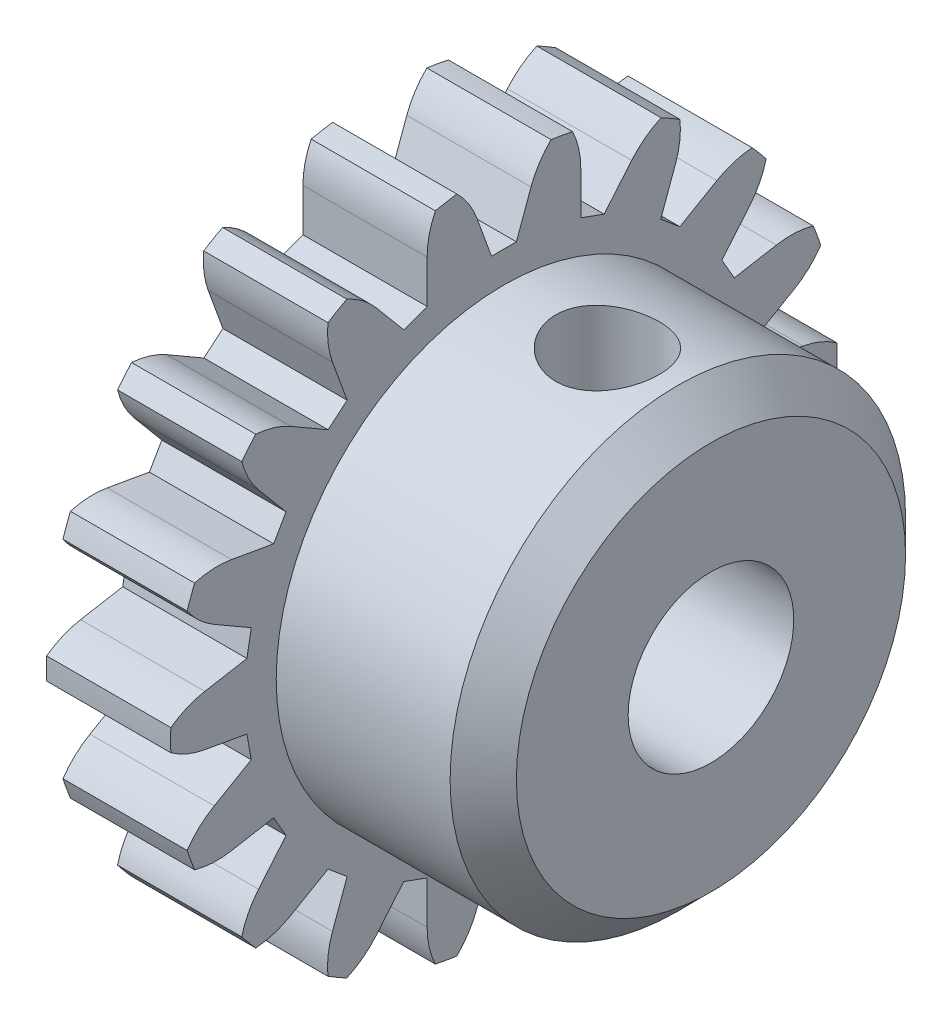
ISO-10303-21;
HEADER;
FILE_DESCRIPTION(('STEP AP214'),'2;1');
FILE_NAME('part.step','',(''),(''),'','','');
FILE_SCHEMA(('AUTOMOTIVE_DESIGN { 1 0 10303 214 1 1 1 1 }'));
ENDSEC;
DATA;
#1=APPLICATION_CONTEXT('core data for automotive mechanical design processes');
#2=APPLICATION_PROTOCOL_DEFINITION('international standard','automotive_design',2000,#1);
#3=PRODUCT_CONTEXT('',#1,'mechanical');
#4=PRODUCT('Part','Part','',(#3));
#5=PRODUCT_RELATED_PRODUCT_CATEGORY('part','',(#4));
#6=PRODUCT_DEFINITION_FORMATION('','',#4);
#7=PRODUCT_DEFINITION_CONTEXT('part definition',#1,'design');
#8=PRODUCT_DEFINITION('design','',#6,#7);
#9=PRODUCT_DEFINITION_SHAPE('','',#8);
#10=(LENGTH_UNIT() NAMED_UNIT(*) SI_UNIT(.MILLI.,.METRE.));
#11=(NAMED_UNIT(*) PLANE_ANGLE_UNIT() SI_UNIT($,.RADIAN.));
#12=(NAMED_UNIT(*) SI_UNIT($,.STERADIAN.) SOLID_ANGLE_UNIT());
#13=UNCERTAINTY_MEASURE_WITH_UNIT(LENGTH_MEASURE(1.E-05),#10,'distance_accuracy_value','');
#14=(GEOMETRIC_REPRESENTATION_CONTEXT(3) GLOBAL_UNCERTAINTY_ASSIGNED_CONTEXT((#13)) GLOBAL_UNIT_ASSIGNED_CONTEXT((#10,
#11,#12)) REPRESENTATION_CONTEXT('',''));
#15=CARTESIAN_POINT('',(0.,0.,0.));
#16=DIRECTION('',(0.,0.,1.));
#17=DIRECTION('',(1.,0.,0.));
#18=AXIS2_PLACEMENT_3D('',#15,#16,#17);
#19=CARTESIAN_POINT('',(-19.4483135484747,0.,0.));
#20=DIRECTION('',(-1.,0.,0.));
#21=DIRECTION('',(0.,0.,1.));
#22=AXIS2_PLACEMENT_3D('',#19,#20,#21);
#23=CYLINDRICAL_SURFACE('',#22,5.5);
#24=CARTESIAN_POINT('',(3.,0.,0.));
#25=DIRECTION('',(-1.,0.,0.));
#26=DIRECTION('',(0.,0.,1.));
#27=AXIS2_PLACEMENT_3D('',#24,#25,#26);
#28=CIRCLE('',#27,5.5);
#29=CARTESIAN_POINT('',(3.,0.,5.5));
#30=VERTEX_POINT('',#29);
#31=EDGE_CURVE('E1394',#30,#30,#28,.T.);
#32=ORIENTED_EDGE('',*,*,#31,.F.);
#33=EDGE_LOOP('',(#32));
#34=FACE_BOUND('',#33,.T.);
#35=CARTESIAN_POINT('',(7.2,0.,0.));
#36=DIRECTION('',(-1.,0.,0.));
#37=DIRECTION('',(0.,0.,1.));
#38=AXIS2_PLACEMENT_3D('',#35,#36,#37);
#39=CIRCLE('',#38,5.5);
#40=CARTESIAN_POINT('',(7.2,0.,5.5));
#41=VERTEX_POINT('',#40);
#42=EDGE_CURVE('E45',#41,#41,#39,.T.);
#43=ORIENTED_EDGE('',*,*,#42,.T.);
#44=EDGE_LOOP('',(#43));
#45=FACE_BOUND('',#44,.T.);
#46=CARTESIAN_POINT('',(5.5,5.35607132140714,-1.25));
#47=CARTESIAN_POINT('',(5.43076690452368,5.35607271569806,-1.24999771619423));
#48=CARTESIAN_POINT('',(5.36150695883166,5.35742832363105,-1.24422856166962));
#49=CARTESIAN_POINT('',(5.22496171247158,5.36269332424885,-1.22133260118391));
#50=CARTESIAN_POINT('',(5.15767779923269,5.36660446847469,-1.20419800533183));
#51=CARTESIAN_POINT('',(5.02707947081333,5.3765152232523,-1.15914270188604));
#52=CARTESIAN_POINT('',(4.96376059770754,5.38251243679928,-1.13123436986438));
#53=CARTESIAN_POINT('',(4.84270080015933,5.39591668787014,-1.0654598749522));
#54=CARTESIAN_POINT('',(4.78495985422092,5.4033237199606,-1.02759375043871));
#55=CARTESIAN_POINT('',(4.67564225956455,5.41886390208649,-0.942242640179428));
#56=CARTESIAN_POINT('',(4.62418210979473,5.42700696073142,-0.89461022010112));
#57=CARTESIAN_POINT('',(4.5299087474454,5.44301514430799,-0.791396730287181));
#58=CARTESIAN_POINT('',(4.48709624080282,5.45088024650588,-0.735815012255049));
#59=CARTESIAN_POINT('',(4.41086847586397,5.465554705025,-0.617495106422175));
#60=CARTESIAN_POINT('',(4.37756589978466,5.47235100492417,-0.554682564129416));
#61=CARTESIAN_POINT('',(4.32203329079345,5.48400988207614,-0.424171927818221));
#62=CARTESIAN_POINT('',(4.29980191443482,5.48887269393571,-0.356474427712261));
#63=CARTESIAN_POINT('',(4.2674109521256,5.49604666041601,-0.219327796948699));
#64=CARTESIAN_POINT('',(4.25705401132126,5.49839948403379,-0.149927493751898));
#65=CARTESIAN_POINT('',(4.2480882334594,5.50043296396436,-0.0103372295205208));
#66=CARTESIAN_POINT('',(4.24947794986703,5.50011394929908,0.0598526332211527));
#67=CARTESIAN_POINT('',(4.26382036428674,5.49687132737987,0.197666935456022));
#68=CARTESIAN_POINT('',(4.27656026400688,5.4939956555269,0.265314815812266));
#69=CARTESIAN_POINT('',(4.31290153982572,5.48601775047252,0.397486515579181));
#70=CARTESIAN_POINT('',(4.33650343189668,5.48091541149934,0.462010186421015));
#71=CARTESIAN_POINT('',(4.39408270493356,5.46898135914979,0.586684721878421));
#72=CARTESIAN_POINT('',(4.42813945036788,5.46213648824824,0.646797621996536));
#73=CARTESIAN_POINT('',(4.50560225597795,5.44746585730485,0.76053199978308));
#74=CARTESIAN_POINT('',(4.54900968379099,5.43963995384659,0.814152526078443));
#75=CARTESIAN_POINT('',(4.64509570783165,5.42365855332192,0.914646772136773));
#76=CARTESIAN_POINT('',(4.6979605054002,5.41549960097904,0.961342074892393));
#77=CARTESIAN_POINT('',(4.81085540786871,5.39993520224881,1.04523960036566));
#78=CARTESIAN_POINT('',(4.87088573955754,5.39252977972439,1.08244152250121));
#79=CARTESIAN_POINT('',(4.99671199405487,5.37930083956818,1.14638443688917));
#80=CARTESIAN_POINT('',(5.06252687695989,5.37348280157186,1.17308932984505));
#81=CARTESIAN_POINT('',(5.19787427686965,5.36416156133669,1.21500479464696));
#82=CARTESIAN_POINT('',(5.26740614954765,5.36065795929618,1.23021735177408));
#83=CARTESIAN_POINT('',(5.40657712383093,5.35644447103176,1.24843460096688));
#84=CARTESIAN_POINT('',(5.47618031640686,5.35567490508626,1.25170012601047));
#85=CARTESIAN_POINT('',(5.61493660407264,5.35685524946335,1.24663886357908));
#86=CARTESIAN_POINT('',(5.68408973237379,5.35880495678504,1.23831294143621));
#87=CARTESIAN_POINT('',(5.81905914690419,5.36514758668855,1.21053208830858));
#88=CARTESIAN_POINT('',(5.88490708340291,5.36950848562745,1.19122293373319));
#89=CARTESIAN_POINT('',(6.01243279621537,5.38015285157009,1.14218254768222));
#90=CARTESIAN_POINT('',(6.07411014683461,5.38643651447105,1.11245025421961));
#91=CARTESIAN_POINT('',(6.19266651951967,5.40034808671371,1.04284048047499));
#92=CARTESIAN_POINT('',(6.24944946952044,5.4079964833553,1.00280355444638));
#93=CARTESIAN_POINT('',(6.35558665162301,5.42372272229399,0.91392779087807));
#94=CARTESIAN_POINT('',(6.40493988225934,5.43180062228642,0.865087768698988));
#95=CARTESIAN_POINT('',(6.49584054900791,5.44767387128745,0.758807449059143));
#96=CARTESIAN_POINT('',(6.53720946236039,5.45546017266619,0.701212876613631));
#97=CARTESIAN_POINT('',(6.60968540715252,5.46970150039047,0.579740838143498));
#98=CARTESIAN_POINT('',(6.64079293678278,5.47615659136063,0.515863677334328));
#99=CARTESIAN_POINT('',(6.69162020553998,5.48697029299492,0.384052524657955));
#100=CARTESIAN_POINT('',(6.71141516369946,5.49134271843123,0.316148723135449));
#101=CARTESIAN_POINT('',(6.73928827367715,5.49755837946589,0.177868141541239));
#102=CARTESIAN_POINT('',(6.74736827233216,5.49940201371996,0.107491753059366));
#103=CARTESIAN_POINT('',(6.75149355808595,5.50033936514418,-0.0320463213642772));
#104=CARTESIAN_POINT('',(6.74780453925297,5.49949379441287,-0.101199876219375));
#105=CARTESIAN_POINT('',(6.72909452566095,5.495279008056,-0.237873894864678));
#106=CARTESIAN_POINT('',(6.71407376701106,5.49190984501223,-0.305394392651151));
#107=CARTESIAN_POINT('',(6.67325818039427,5.48303224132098,-0.436661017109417));
#108=CARTESIAN_POINT('',(6.64750377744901,5.47753183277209,-0.500420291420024));
#109=CARTESIAN_POINT('',(6.5859903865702,5.46497684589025,-0.622746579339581));
#110=CARTESIAN_POINT('',(6.55023034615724,5.4579221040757,-0.681313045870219));
#111=CARTESIAN_POINT('',(6.46886901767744,5.44284675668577,-0.792878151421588));
#112=CARTESIAN_POINT('',(6.42308254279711,5.43480943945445,-0.845739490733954));
#113=CARTESIAN_POINT('',(6.32333801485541,5.41876069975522,-0.943119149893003));
#114=CARTESIAN_POINT('',(6.26937797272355,5.41074928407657,-0.987635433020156));
#115=CARTESIAN_POINT('',(6.15386400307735,5.39552746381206,-1.06769503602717));
#116=CARTESIAN_POINT('',(6.09221014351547,5.38833055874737,-1.10309689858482));
#117=CARTESIAN_POINT('',(5.96367557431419,5.37572512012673,-1.16298018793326));
#118=CARTESIAN_POINT('',(5.89679918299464,5.3703151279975,-1.18747052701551));
#119=CARTESIAN_POINT('',(5.77491602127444,5.36285672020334,-1.22064955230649));
#120=CARTESIAN_POINT('',(5.72055191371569,5.36032965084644,-1.23163414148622));
#121=CARTESIAN_POINT('',(5.61079756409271,5.35693644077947,-1.24631007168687));
#122=CARTESIAN_POINT('',(5.55540738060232,5.35607020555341,-1.25000182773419));
#123=CARTESIAN_POINT('',(5.5,5.35607132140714,-1.25));
#124=B_SPLINE_CURVE_WITH_KNOTS('',3,(#46,#47,#48,#49,#50,#51,#52,#53,#54,#55,#56,#57,#58,#59,
#60,#61,#62,#63,#64,#65,#66,#67,#68,#69,#70,#71,#72,#73,#74,#75,#76,#77,#78,#79,#80,#81,#82,#83,
#84,#85,#86,#87,#88,#89,#90,#91,#92,#93,#94,#95,#96,#97,#98,#99,#100,#101,#102,#103,#104,#105,
#106,#107,#108,#109,#110,#111,#112,#113,#114,#115,#116,#117,#118,#119,#120,#121,#122,#123),
.UNSPECIFIED.,.T.,.F.,(4,2,2,2,2,2,2,2,2,2,2,2,2,2,2,2,2,2,2,2,2,2,2,2,2,2,2,2,2,2,2,2,2,2,2,2,
2,2,4),(0.,0.207496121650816,0.41513460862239,0.6225352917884,0.829935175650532,
1.04073318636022,1.2515483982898,1.46476669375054,1.67795910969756,1.88755439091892,
2.0971238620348,2.30284503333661,2.50857597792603,2.71590898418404,2.92327233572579,
3.13528932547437,3.34731302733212,3.56005962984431,3.77276947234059,3.98080665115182,
4.18882830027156,4.39415131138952,4.59949524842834,4.8082306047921,5.01699407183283,
5.22998962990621,5.44297484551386,5.65452690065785,5.86604560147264,6.07282318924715,
6.27959646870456,6.48559793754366,6.6916210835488,6.90183008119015,7.1120903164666,
7.32544005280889,7.53861520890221,7.70468420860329,7.87074375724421),.UNSPECIFIED.);
#125=CARTESIAN_POINT('',(5.5,5.35607132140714,-1.25));
#126=VERTEX_POINT('',#125);
#127=EDGE_CURVE('E1535',#126,#126,#124,.T.);
#128=ORIENTED_EDGE('',*,*,#127,.F.);
#129=EDGE_LOOP('',(#128));
#130=FACE_BOUND('',#129,.T.);
#131=ADVANCED_FACE('F32',(#34,#45,#130),#23,.T.);
#132=CARTESIAN_POINT('',(-19.4483135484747,0.,0.));
#133=DIRECTION('',(-1.,0.,0.));
#134=DIRECTION('',(0.,0.,1.));
#135=AXIS2_PLACEMENT_3D('',#132,#133,#134);
#136=CYLINDRICAL_SURFACE('',#135,2.);
#137=CARTESIAN_POINT('',(0.,0.,0.));
#138=DIRECTION('',(-1.,0.,0.));
#139=DIRECTION('',(0.,0.,1.));
#140=AXIS2_PLACEMENT_3D('',#137,#138,#139);
#141=CIRCLE('',#140,2.);
#142=CARTESIAN_POINT('',(0.,0.,2.));
#143=VERTEX_POINT('',#142);
#144=EDGE_CURVE('E1387',#143,#143,#141,.T.);
#145=ORIENTED_EDGE('',*,*,#144,.T.);
#146=EDGE_LOOP('',(#145));
#147=FACE_BOUND('',#146,.T.);
#148=CARTESIAN_POINT('',(8.,0.,0.));
#149=DIRECTION('',(-1.,0.,0.));
#150=DIRECTION('',(0.,0.,1.));
#151=AXIS2_PLACEMENT_3D('',#148,#149,#150);
#152=CIRCLE('',#151,2.);
#153=CARTESIAN_POINT('',(8.,0.,2.));
#154=VERTEX_POINT('',#153);
#155=EDGE_CURVE('E1391',#154,#154,#152,.T.);
#156=ORIENTED_EDGE('',*,*,#155,.F.);
#157=EDGE_LOOP('',(#156));
#158=FACE_BOUND('',#157,.T.);
#159=CARTESIAN_POINT('',(5.5,1.5612494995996,-1.25));
#160=CARTESIAN_POINT('',(5.56212028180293,1.56125800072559,-1.24999462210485));
#161=CARTESIAN_POINT('',(5.62433783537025,1.56502642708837,-1.24532693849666));
#162=CARTESIAN_POINT('',(5.74667632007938,1.57943717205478,-1.22698950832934));
#163=CARTESIAN_POINT('',(5.80679108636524,1.59009816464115,-1.21329530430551));
#164=CARTESIAN_POINT('',(5.92278232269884,1.61650085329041,-1.17788073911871));
#165=CARTESIAN_POINT('',(5.97869060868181,1.63219837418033,-1.15622993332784));
#166=CARTESIAN_POINT('',(6.08600886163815,1.66682950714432,-1.10571945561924));
#167=CARTESIAN_POINT('',(6.1374187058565,1.68576320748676,-1.07685958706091));
#168=CARTESIAN_POINT('',(6.24186515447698,1.72779611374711,-1.00823937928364));
#169=CARTESIAN_POINT('',(6.29419474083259,1.75111338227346,-0.967536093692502));
#170=CARTESIAN_POINT('',(6.39188269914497,1.79752820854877,-0.878308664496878));
#171=CARTESIAN_POINT('',(6.43723499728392,1.82062555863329,-0.829777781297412));
#172=CARTESIAN_POINT('',(6.52510358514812,1.86729453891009,-0.71918666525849));
#173=CARTESIAN_POINT('',(6.56661766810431,1.8905872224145,-0.656200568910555));
#174=CARTESIAN_POINT('',(6.63812520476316,1.9318323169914,-0.522404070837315));
#175=CARTESIAN_POINT('',(6.66813006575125,1.94979001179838,-0.45160150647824));
#176=CARTESIAN_POINT('',(6.71248231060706,1.97669841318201,-0.311776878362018));
#177=CARTESIAN_POINT('',(6.72811141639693,1.98637922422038,-0.24330563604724));
#178=CARTESIAN_POINT('',(6.7476320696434,1.99850544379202,-0.104105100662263));
#179=CARTESIAN_POINT('',(6.75153595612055,2.00095845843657,-0.0333782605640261));
#180=CARTESIAN_POINT('',(6.74764431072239,1.99852909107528,0.0980658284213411));
#181=CARTESIAN_POINT('',(6.7413486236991,1.99458699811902,0.158852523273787));
#182=CARTESIAN_POINT('',(6.72013301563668,1.98145272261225,0.27830664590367));
#183=CARTESIAN_POINT('',(6.70521244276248,1.97226014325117,0.336973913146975));
#184=CARTESIAN_POINT('',(6.66739622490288,1.94938133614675,0.450889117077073));
#185=CARTESIAN_POINT('',(6.64448017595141,1.93568361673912,0.506127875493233));
#186=CARTESIAN_POINT('',(6.59153124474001,1.90485632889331,0.612019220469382));
#187=CARTESIAN_POINT('',(6.5614967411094,1.88772597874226,0.662670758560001));
#188=CARTESIAN_POINT('',(6.49097183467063,1.84893224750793,0.764713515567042));
#189=CARTESIAN_POINT('',(6.44964537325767,1.82697004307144,0.81541234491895));
#190=CARTESIAN_POINT('',(6.35986761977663,1.78195462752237,0.909598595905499));
#191=CARTESIAN_POINT('',(6.31140597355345,1.75889986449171,0.953075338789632));
#192=CARTESIAN_POINT('',(6.20129437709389,1.71071442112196,1.03735445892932));
#193=CARTESIAN_POINT('',(6.1387486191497,1.68570581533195,1.07706615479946));
#194=CARTESIAN_POINT('',(6.00635388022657,1.64014139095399,1.14526153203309));
#195=CARTESIAN_POINT('',(5.93651865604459,1.6195774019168,1.17376589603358));
#196=CARTESIAN_POINT('',(5.81023059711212,1.5909187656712,1.21218566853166));
#197=CARTESIAN_POINT('',(5.75508903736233,1.58096704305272,1.22501841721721));
#198=CARTESIAN_POINT('',(5.64288481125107,1.56679138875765,1.24310168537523));
#199=CARTESIAN_POINT('',(5.5858248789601,1.56255963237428,1.24836256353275));
#200=CARTESIAN_POINT('',(5.47127131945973,1.56046133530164,1.25098535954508));
#201=CARTESIAN_POINT('',(5.41377699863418,1.56260938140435,1.24832917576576));
#202=CARTESIAN_POINT('',(5.3002194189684,1.57296042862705,1.23525733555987));
#203=CARTESIAN_POINT('',(5.24415738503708,1.58116844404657,1.22483525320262));
#204=CARTESIAN_POINT('',(5.1357816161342,1.60230060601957,1.1970493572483));
#205=CARTESIAN_POINT('',(5.08342132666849,1.61514477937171,1.17980280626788));
#206=CARTESIAN_POINT('',(4.98221266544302,1.64415573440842,1.13902451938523));
#207=CARTESIAN_POINT('',(4.9333655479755,1.66032369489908,1.11549055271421));
#208=CARTESIAN_POINT('',(4.83069396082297,1.69787203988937,1.0576537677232));
#209=CARTESIAN_POINT('',(4.77769245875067,1.7196587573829,1.02215373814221));
#210=CARTESIAN_POINT('',(4.67781494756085,1.76393958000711,0.943690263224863));
#211=CARTESIAN_POINT('',(4.63094538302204,1.78643439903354,0.900719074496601));
#212=CARTESIAN_POINT('',(4.53701675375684,1.83383164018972,0.800380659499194));
#213=CARTESIAN_POINT('',(4.49113144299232,1.85854204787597,0.741809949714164));
#214=CARTESIAN_POINT('',(4.40993134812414,1.90384248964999,0.616299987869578));
#215=CARTESIAN_POINT('',(4.37461161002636,1.92443445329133,0.549364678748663));
#216=CARTESIAN_POINT('',(4.31800500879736,1.95809255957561,0.412925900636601));
#217=CARTESIAN_POINT('',(4.29600579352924,1.9715348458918,0.34381482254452));
#218=CARTESIAN_POINT('',(4.26427333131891,1.9910701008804,0.201860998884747));
#219=CARTESIAN_POINT('',(4.25452311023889,1.99717323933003,0.129023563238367));
#220=CARTESIAN_POINT('',(4.24845347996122,2.00096685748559,-0.00659907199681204));
#221=CARTESIAN_POINT('',(4.25036422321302,1.99976600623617,-0.0692812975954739));
#222=CARTESIAN_POINT('',(4.26346167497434,1.99160739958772,-0.193279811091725));
#223=CARTESIAN_POINT('',(4.27464796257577,1.98464990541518,-0.254596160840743));
#224=CARTESIAN_POINT('',(4.30516047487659,1.9659610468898,-0.372043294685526));
#225=CARTESIAN_POINT('',(4.3241908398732,1.95440367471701,-0.428280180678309));
#226=CARTESIAN_POINT('',(4.36955992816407,1.92744968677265,-0.536714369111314));
#227=CARTESIAN_POINT('',(4.39589988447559,1.91205242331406,-0.588910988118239));
#228=CARTESIAN_POINT('',(4.4581605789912,1.87675342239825,-0.693656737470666));
#229=CARTESIAN_POINT('',(4.49479198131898,1.85655002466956,-0.745680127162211));
#230=CARTESIAN_POINT('',(4.5750766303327,1.81433640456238,-0.843216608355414));
#231=CARTESIAN_POINT('',(4.61873780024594,1.7923241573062,-0.88872224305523));
#232=CARTESIAN_POINT('',(4.71911626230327,1.74500415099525,-0.978723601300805));
#233=CARTESIAN_POINT('',(4.77680834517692,1.71967871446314,-1.02212829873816));
#234=CARTESIAN_POINT('',(4.89964466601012,1.67174821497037,-1.09877325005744));
#235=CARTESIAN_POINT('',(4.9647847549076,1.64914165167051,-1.132019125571));
#236=CARTESIAN_POINT('',(5.08640276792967,1.61429776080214,-1.18099110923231));
#237=CARTESIAN_POINT('',(5.14163568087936,1.60087340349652,-1.19896216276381));
#238=CARTESIAN_POINT('',(5.25496927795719,1.57939158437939,-1.22712822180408));
#239=CARTESIAN_POINT('',(5.31306025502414,1.57131714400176,-1.23734784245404));
#240=CARTESIAN_POINT('',(5.39303052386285,1.56476456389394,-1.24559906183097));
#241=CARTESIAN_POINT('',(5.41436414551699,1.56345069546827,-1.24724671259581));
#242=CARTESIAN_POINT('',(5.45712796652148,1.56169158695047,-1.24944824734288));
#243=CARTESIAN_POINT('',(5.47855818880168,1.56124656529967,-1.25000185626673));
#244=CARTESIAN_POINT('',(5.5,1.5612494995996,-1.25));
#245=B_SPLINE_CURVE_WITH_KNOTS('',3,(#159,#160,#161,#162,#163,#164,#165,#166,#167,#168,#169,
#170,#171,#172,#173,#174,#175,#176,#177,#178,#179,#180,#181,#182,#183,#184,#185,#186,#187,#188,
#189,#190,#191,#192,#193,#194,#195,#196,#197,#198,#199,#200,#201,#202,#203,#204,#205,#206,#207,
#208,#209,#210,#211,#212,#213,#214,#215,#216,#217,#218,#219,#220,#221,#222,#223,#224,#225,#226,
#227,#228,#229,#230,#231,#232,#233,#234,#235,#236,#237,#238,#239,#240,#241,#242,#243,#244),
.UNSPECIFIED.,.T.,.F.,(4,2,2,2,2,2,2,2,2,2,2,2,2,2,2,2,2,2,2,2,2,2,2,2,2,2,2,2,2,2,2,2,2,2,2,2,
2,2,2,2,2,2,4),(0.,0.186262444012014,0.373031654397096,0.558205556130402,0.74338450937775,
0.953406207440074,1.16360970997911,1.39917236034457,1.6345009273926,1.84590412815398,
2.05708478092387,2.23992319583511,2.42277543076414,2.60609774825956,2.78946186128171,
2.99564504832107,3.20213044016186,3.43558067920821,3.66859805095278,3.84032775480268,
4.01182230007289,4.18370925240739,4.35573859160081,4.52493212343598,4.69418576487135,
4.89566333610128,5.09735098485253,5.33136598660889,5.56527109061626,5.78520080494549,
6.00482541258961,6.19203601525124,6.37923812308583,6.55994569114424,6.7406837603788,
6.94018144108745,7.13990556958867,7.36841817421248,7.59680409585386,7.77496902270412,
7.95256577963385,8.01684109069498,8.08113255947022),.UNSPECIFIED.);
#246=CARTESIAN_POINT('',(5.5,1.5612494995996,-1.25));
#247=VERTEX_POINT('',#246);
#248=EDGE_CURVE('E36',#247,#247,#245,.T.);
#249=ORIENTED_EDGE('',*,*,#248,.F.);
#250=EDGE_LOOP('',(#249));
#251=FACE_BOUND('',#250,.T.);
#252=ADVANCED_FACE('F1521',(#147,#158,#251),#136,.F.);
#253=CARTESIAN_POINT('',(-19.4483135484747,0.,0.));
#254=DIRECTION('',(-1.,0.,0.));
#255=DIRECTION('',(0.,0.,1.));
#256=AXIS2_PLACEMENT_3D('',#253,#254,#255);
#257=CYLINDRICAL_SURFACE('',#256,8.05);
#258=CARTESIAN_POINT('',(3.,0.,0.));
#259=DIRECTION('',(-1.,0.,0.));
#260=DIRECTION('',(0.,0.,1.));
#261=AXIS2_PLACEMENT_3D('',#258,#259,#260);
#262=CIRCLE('',#261,8.05);
#263=CARTESIAN_POINT('',(3.,7.96915297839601,-1.1380249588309));
#264=VERTEX_POINT('',#263);
#265=CARTESIAN_POINT('',(3.,7.87761796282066,-1.65699584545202));
#266=VERTEX_POINT('',#265);
#267=EDGE_CURVE('E1380',#264,#266,#262,.T.);
#268=ORIENTED_EDGE('',*,*,#267,.T.);
#269=DIRECTION('',(-1.,0.,0.));
#270=VECTOR('',#269,1.);
#271=CARTESIAN_POINT('',(4.,7.87761796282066,-1.65699584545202));
#272=LINE('',#271,#270);
#273=CARTESIAN_POINT('',(0.,7.87761796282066,-1.65699584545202));
#274=VERTEX_POINT('',#273);
#275=EDGE_CURVE('E1499',#266,#274,#272,.T.);
#276=ORIENTED_EDGE('',*,*,#275,.T.);
#277=CARTESIAN_POINT('',(0.,0.,0.));
#278=DIRECTION('',(-1.,0.,0.));
#279=DIRECTION('',(0.,0.,1.));
#280=AXIS2_PLACEMENT_3D('',#277,#278,#279);
#281=CIRCLE('',#280,8.05);
#282=CARTESIAN_POINT('',(0.,7.96915297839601,-1.1380249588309));
#283=VERTEX_POINT('',#282);
#284=EDGE_CURVE('E1385',#283,#274,#281,.T.);
#285=ORIENTED_EDGE('',*,*,#284,.F.);
#286=DIRECTION('',(-1.,0.,0.));
#287=VECTOR('',#286,1.);
#288=CARTESIAN_POINT('',(4.,7.96915297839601,-1.1380249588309));
#289=LINE('',#288,#287);
#290=EDGE_CURVE('E1397',#283,#264,#289,.F.);
#291=ORIENTED_EDGE('',*,*,#290,.T.);
#292=EDGE_LOOP('',(#268,#276,#285,#291));
#293=FACE_BOUND('',#292,.T.);
#294=ADVANCED_FACE('F1527',(#293),#257,.T.);
#295=CARTESIAN_POINT('',(0.,7.09932678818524,-3.79500449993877));
#296=VERTEX_POINT('',#295);
#297=CARTESIAN_POINT('',(0.,6.83581351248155,-4.25137079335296));
#298=VERTEX_POINT('',#297);
#299=EDGE_CURVE('E1388',#296,#298,#281,.T.);
#300=ORIENTED_EDGE('',*,*,#299,.F.);
#301=DIRECTION('',(-1.,0.,0.));
#302=VECTOR('',#301,1.);
#303=CARTESIAN_POINT('',(1.5,7.09932678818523,-3.79500449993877));
#304=LINE('',#303,#302);
#305=CARTESIAN_POINT('',(3.,7.09932678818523,-3.79500449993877));
#306=VERTEX_POINT('',#305);
#307=EDGE_CURVE('E1496',#296,#306,#304,.F.);
#308=ORIENTED_EDGE('',*,*,#307,.T.);
#309=CARTESIAN_POINT('',(3.,6.83581351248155,-4.25137079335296));
#310=VERTEX_POINT('',#309);
#311=EDGE_CURVE('E1384',#306,#310,#262,.T.);
#312=ORIENTED_EDGE('',*,*,#311,.T.);
#313=DIRECTION('',(-1.,0.,0.));
#314=VECTOR('',#313,1.);
#315=CARTESIAN_POINT('',(1.5,6.83581351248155,-4.25137079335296));
#316=LINE('',#315,#314);
#317=EDGE_CURVE('E1493',#310,#298,#316,.T.);
#318=ORIENTED_EDGE('',*,*,#317,.T.);
#319=EDGE_LOOP('',(#300,#308,#312,#318));
#320=FACE_BOUND('',#319,.T.);
#321=ADVANCED_FACE('F2005',(#320),#257,.T.);
#322=CARTESIAN_POINT('',(0.,5.37321701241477,-5.99425049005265));
#323=VERTEX_POINT('',#322);
#324=CARTESIAN_POINT('',(0.,4.96950906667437,-6.332967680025));
#325=VERTEX_POINT('',#324);
#326=EDGE_CURVE('E2013',#323,#325,#281,.T.);
#327=ORIENTED_EDGE('',*,*,#326,.F.);
#328=DIRECTION('',(-1.,0.,0.));
#329=VECTOR('',#328,1.);
#330=CARTESIAN_POINT('',(1.5,5.37321701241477,-5.99425049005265));
#331=LINE('',#330,#329);
#332=CARTESIAN_POINT('',(3.,5.37321701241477,-5.99425049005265));
#333=VERTEX_POINT('',#332);
#334=EDGE_CURVE('E1490',#323,#333,#331,.F.);
#335=ORIENTED_EDGE('',*,*,#334,.T.);
#336=CARTESIAN_POINT('',(3.,4.96950906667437,-6.332967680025));
#337=VERTEX_POINT('',#336);
#338=EDGE_CURVE('E1995',#333,#337,#262,.T.);
#339=ORIENTED_EDGE('',*,*,#338,.T.);
#340=DIRECTION('',(-1.,0.,0.));
#341=VECTOR('',#340,1.);
#342=CARTESIAN_POINT('',(1.5,4.96950906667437,-6.332967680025));
#343=LINE('',#342,#341);
#344=EDGE_CURVE('E1487',#337,#325,#343,.T.);
#345=ORIENTED_EDGE('',*,*,#344,.T.);
#346=EDGE_LOOP('',(#327,#335,#339,#345));
#347=FACE_BOUND('',#346,.T.);
#348=ADVANCED_FACE('F2207',(#347),#257,.T.);
#349=CARTESIAN_POINT('',(0.,2.99901796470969,-7.47050140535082));
#350=VERTEX_POINT('',#349);
#351=CARTESIAN_POINT('',(0.,2.50380848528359,-7.65071519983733));
#352=VERTEX_POINT('',#351);
#353=EDGE_CURVE('E2015',#350,#352,#281,.T.);
#354=ORIENTED_EDGE('',*,*,#353,.F.);
#355=DIRECTION('',(-1.,0.,0.));
#356=VECTOR('',#355,1.);
#357=CARTESIAN_POINT('',(1.5,2.99901796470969,-7.47050140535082));
#358=LINE('',#357,#356);
#359=CARTESIAN_POINT('',(3.,2.99901796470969,-7.47050140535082));
#360=VERTEX_POINT('',#359);
#361=EDGE_CURVE('E1484',#350,#360,#358,.F.);
#362=ORIENTED_EDGE('',*,*,#361,.T.);
#363=CARTESIAN_POINT('',(3.,2.50380848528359,-7.65071519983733));
#364=VERTEX_POINT('',#363);
#365=EDGE_CURVE('E1991',#360,#364,#262,.T.);
#366=ORIENTED_EDGE('',*,*,#365,.T.);
#367=DIRECTION('',(-1.,0.,0.));
#368=VECTOR('',#367,1.);
#369=CARTESIAN_POINT('',(1.5,2.50380848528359,-7.65071519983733));
#370=LINE('',#369,#368);
#371=EDGE_CURVE('E1481',#364,#352,#370,.T.);
#372=ORIENTED_EDGE('',*,*,#371,.T.);
#373=EDGE_LOOP('',(#354,#362,#366,#372));
#374=FACE_BOUND('',#373,.T.);
#375=ADVANCED_FACE('F2199',(#374),#257,.T.);
#376=CARTESIAN_POINT('',(0.,0.263093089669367,-8.04569959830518));
#377=VERTEX_POINT('',#376);
#378=CARTESIAN_POINT('',(0.,-0.263888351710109,-8.04567355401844));
#379=VERTEX_POINT('',#378);
#380=EDGE_CURVE('E2020',#377,#379,#281,.T.);
#381=ORIENTED_EDGE('',*,*,#380,.F.);
#382=DIRECTION('',(-1.,0.,0.));
#383=VECTOR('',#382,1.);
#384=CARTESIAN_POINT('',(1.5,0.263093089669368,-8.04569959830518));
#385=LINE('',#384,#383);
#386=CARTESIAN_POINT('',(3.,0.263093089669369,-8.04569959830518));
#387=VERTEX_POINT('',#386);
#388=EDGE_CURVE('E1478',#377,#387,#385,.F.);
#389=ORIENTED_EDGE('',*,*,#388,.T.);
#390=CARTESIAN_POINT('',(3.,-0.263888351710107,-8.04567355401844));
#391=VERTEX_POINT('',#390);
#392=EDGE_CURVE('E1987',#387,#391,#262,.T.);
#393=ORIENTED_EDGE('',*,*,#392,.T.);
#394=DIRECTION('',(-1.,0.,0.));
#395=VECTOR('',#394,1.);
#396=CARTESIAN_POINT('',(1.5,-0.26388835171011,-8.04567355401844));
#397=LINE('',#396,#395);
#398=EDGE_CURVE('E1475',#391,#379,#397,.T.);
#399=ORIENTED_EDGE('',*,*,#398,.T.);
#400=EDGE_LOOP('',(#381,#389,#393,#399));
#401=FACE_BOUND('',#400,.T.);
#402=ADVANCED_FACE('F2191',(#401),#257,.T.);
#403=CARTESIAN_POINT('',(0.,-2.50456469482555,-7.65046767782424));
#404=VERTEX_POINT('',#403);
#405=CARTESIAN_POINT('',(0.,-2.99975635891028,-7.47020493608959));
#406=VERTEX_POINT('',#405);
#407=EDGE_CURVE('E2025',#404,#406,#281,.T.);
#408=ORIENTED_EDGE('',*,*,#407,.F.);
#409=DIRECTION('',(-1.,0.,0.));
#410=VECTOR('',#409,1.);
#411=CARTESIAN_POINT('',(1.5,-2.50456469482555,-7.65046767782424));
#412=LINE('',#411,#410);
#413=CARTESIAN_POINT('',(3.,-2.50456469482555,-7.65046767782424));
#414=VERTEX_POINT('',#413);
#415=EDGE_CURVE('E1472',#404,#414,#412,.F.);
#416=ORIENTED_EDGE('',*,*,#415,.T.);
#417=CARTESIAN_POINT('',(3.,-2.99975635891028,-7.47020493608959));
#418=VERTEX_POINT('',#417);
#419=EDGE_CURVE('E1983',#414,#418,#262,.T.);
#420=ORIENTED_EDGE('',*,*,#419,.T.);
#421=DIRECTION('',(-1.,0.,0.));
#422=VECTOR('',#421,1.);
#423=CARTESIAN_POINT('',(1.5,-2.99975635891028,-7.47020493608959));
#424=LINE('',#423,#422);
#425=EDGE_CURVE('E1469',#418,#406,#424,.T.);
#426=ORIENTED_EDGE('',*,*,#425,.T.);
#427=EDGE_LOOP('',(#408,#416,#420,#426));
#428=FACE_BOUND('',#427,.T.);
#429=ADVANCED_FACE('F2183',(#428),#257,.T.);
#430=CARTESIAN_POINT('',(0.,-4.97013501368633,-6.33247644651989));
#431=VERTEX_POINT('',#430);
#432=CARTESIAN_POINT('',(0.,-5.37380947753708,-5.99371935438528));
#433=VERTEX_POINT('',#432);
#434=EDGE_CURVE('E2030',#431,#433,#281,.T.);
#435=ORIENTED_EDGE('',*,*,#434,.F.);
#436=DIRECTION('',(-1.,0.,0.));
#437=VECTOR('',#436,1.);
#438=CARTESIAN_POINT('',(1.5,-4.97013501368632,-6.33247644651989));
#439=LINE('',#438,#437);
#440=CARTESIAN_POINT('',(3.,-4.97013501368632,-6.33247644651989));
#441=VERTEX_POINT('',#440);
#442=EDGE_CURVE('E1466',#431,#441,#439,.F.);
#443=ORIENTED_EDGE('',*,*,#442,.T.);
#444=CARTESIAN_POINT('',(3.,-5.37380947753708,-5.99371935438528));
#445=VERTEX_POINT('',#444);
#446=EDGE_CURVE('E1979',#441,#445,#262,.T.);
#447=ORIENTED_EDGE('',*,*,#446,.T.);
#448=DIRECTION('',(-1.,0.,0.));
#449=VECTOR('',#448,1.);
#450=CARTESIAN_POINT('',(1.5,-5.37380947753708,-5.99371935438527));
#451=LINE('',#450,#449);
#452=EDGE_CURVE('E1463',#445,#433,#451,.T.);
#453=ORIENTED_EDGE('',*,*,#452,.T.);
#454=EDGE_LOOP('',(#435,#443,#447,#453));
#455=FACE_BOUND('',#454,.T.);
#456=ADVANCED_FACE('F2175',(#455),#257,.T.);
#457=CARTESIAN_POINT('',(0.,-6.83623369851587,-4.25069509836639));
#458=VERTEX_POINT('',#457);
#459=CARTESIAN_POINT('',(0.,-7.09970186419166,-3.79430276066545));
#460=VERTEX_POINT('',#459);
#461=EDGE_CURVE('E2035',#458,#460,#281,.T.);
#462=ORIENTED_EDGE('',*,*,#461,.F.);
#463=DIRECTION('',(-1.,0.,0.));
#464=VECTOR('',#463,1.);
#465=CARTESIAN_POINT('',(1.5,-6.83623369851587,-4.25069509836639));
#466=LINE('',#465,#464);
#467=CARTESIAN_POINT('',(3.,-6.83623369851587,-4.25069509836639));
#468=VERTEX_POINT('',#467);
#469=EDGE_CURVE('E1460',#458,#468,#466,.F.);
#470=ORIENTED_EDGE('',*,*,#469,.T.);
#471=CARTESIAN_POINT('',(3.,-7.09970186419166,-3.79430276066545));
#472=VERTEX_POINT('',#471);
#473=EDGE_CURVE('E1975',#468,#472,#262,.T.);
#474=ORIENTED_EDGE('',*,*,#473,.T.);
#475=DIRECTION('',(-1.,0.,0.));
#476=VECTOR('',#475,1.);
#477=CARTESIAN_POINT('',(1.5,-7.09970186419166,-3.79430276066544));
#478=LINE('',#477,#476);
#479=EDGE_CURVE('E1457',#472,#460,#478,.T.);
#480=ORIENTED_EDGE('',*,*,#479,.T.);
#481=EDGE_LOOP('',(#462,#470,#474,#480));
#482=FACE_BOUND('',#481,.T.);
#483=ADVANCED_FACE('F2167',(#482),#257,.T.);
#484=CARTESIAN_POINT('',(0.,-7.87778170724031,-1.65621718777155));
#485=VERTEX_POINT('',#484);
#486=CARTESIAN_POINT('',(0.,-7.96926542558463,-1.13723725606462));
#487=VERTEX_POINT('',#486);
#488=EDGE_CURVE('E2040',#485,#487,#281,.T.);
#489=ORIENTED_EDGE('',*,*,#488,.F.);
#490=DIRECTION('',(-1.,0.,0.));
#491=VECTOR('',#490,1.);
#492=CARTESIAN_POINT('',(1.5,-7.87778170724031,-1.65621718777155));
#493=LINE('',#492,#491);
#494=CARTESIAN_POINT('',(3.,-7.87778170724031,-1.65621718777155));
#495=VERTEX_POINT('',#494);
#496=EDGE_CURVE('E1454',#485,#495,#493,.F.);
#497=ORIENTED_EDGE('',*,*,#496,.T.);
#498=CARTESIAN_POINT('',(3.,-7.96926542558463,-1.13723725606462));
#499=VERTEX_POINT('',#498);
#500=EDGE_CURVE('E1971',#495,#499,#262,.T.);
#501=ORIENTED_EDGE('',*,*,#500,.T.);
#502=DIRECTION('',(-1.,0.,0.));
#503=VECTOR('',#502,1.);
#504=CARTESIAN_POINT('',(1.5,-7.96926542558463,-1.13723725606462));
#505=LINE('',#504,#503);
#506=EDGE_CURVE('E1451',#499,#487,#505,.T.);
#507=ORIENTED_EDGE('',*,*,#506,.T.);
#508=EDGE_LOOP('',(#489,#497,#501,#507));
#509=FACE_BOUND('',#508,.T.);
#510=ADVANCED_FACE('F2159',(#509),#257,.T.);
#511=CARTESIAN_POINT('',(0.,-7.96915297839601,1.1380249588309));
#512=VERTEX_POINT('',#511);
#513=CARTESIAN_POINT('',(0.,-7.87761796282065,1.65699584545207));
#514=VERTEX_POINT('',#513);
#515=EDGE_CURVE('E2045',#512,#514,#281,.T.);
#516=ORIENTED_EDGE('',*,*,#515,.F.);
#517=DIRECTION('',(-1.,0.,0.));
#518=VECTOR('',#517,1.);
#519=CARTESIAN_POINT('',(1.5,-7.96915297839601,1.1380249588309));
#520=LINE('',#519,#518);
#521=CARTESIAN_POINT('',(3.,-7.96915297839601,1.1380249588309));
#522=VERTEX_POINT('',#521);
#523=EDGE_CURVE('E1448',#512,#522,#520,.F.);
#524=ORIENTED_EDGE('',*,*,#523,.T.);
#525=CARTESIAN_POINT('',(3.,-7.87761796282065,1.65699584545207));
#526=VERTEX_POINT('',#525);
#527=EDGE_CURVE('E1967',#522,#526,#262,.T.);
#528=ORIENTED_EDGE('',*,*,#527,.T.);
#529=DIRECTION('',(-1.,0.,0.));
#530=VECTOR('',#529,1.);
#531=CARTESIAN_POINT('',(1.5,-7.87761796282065,1.65699584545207));
#532=LINE('',#531,#530);
#533=EDGE_CURVE('E1445',#526,#514,#532,.T.);
#534=ORIENTED_EDGE('',*,*,#533,.T.);
#535=EDGE_LOOP('',(#516,#524,#528,#534));
#536=FACE_BOUND('',#535,.T.);
#537=ADVANCED_FACE('F2151',(#536),#257,.T.);
#538=CARTESIAN_POINT('',(0.,-7.09932678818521,3.79500449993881));
#539=VERTEX_POINT('',#538);
#540=CARTESIAN_POINT('',(0.,-6.83581351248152,4.25137079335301));
#541=VERTEX_POINT('',#540);
#542=EDGE_CURVE('E2050',#539,#541,#281,.T.);
#543=ORIENTED_EDGE('',*,*,#542,.F.);
#544=DIRECTION('',(-1.,0.,0.));
#545=VECTOR('',#544,1.);
#546=CARTESIAN_POINT('',(1.5,-7.09932678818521,3.79500449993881));
#547=LINE('',#546,#545);
#548=CARTESIAN_POINT('',(3.,-7.09932678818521,3.79500449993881));
#549=VERTEX_POINT('',#548);
#550=EDGE_CURVE('E1442',#539,#549,#547,.F.);
#551=ORIENTED_EDGE('',*,*,#550,.T.);
#552=CARTESIAN_POINT('',(3.,-6.83581351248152,4.25137079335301));
#553=VERTEX_POINT('',#552);
#554=EDGE_CURVE('E1963',#549,#553,#262,.T.);
#555=ORIENTED_EDGE('',*,*,#554,.T.);
#556=DIRECTION('',(-1.,0.,0.));
#557=VECTOR('',#556,1.);
#558=CARTESIAN_POINT('',(1.5,-6.83581351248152,4.25137079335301));
#559=LINE('',#558,#557);
#560=EDGE_CURVE('E1439',#553,#541,#559,.T.);
#561=ORIENTED_EDGE('',*,*,#560,.T.);
#562=EDGE_LOOP('',(#543,#551,#555,#561));
#563=FACE_BOUND('',#562,.T.);
#564=ADVANCED_FACE('F2143',(#563),#257,.T.);
#565=CARTESIAN_POINT('',(0.,-5.37321701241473,5.99425049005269));
#566=VERTEX_POINT('',#565);
#567=CARTESIAN_POINT('',(0.,-4.96950906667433,6.33296768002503));
#568=VERTEX_POINT('',#567);
#569=EDGE_CURVE('E2055',#566,#568,#281,.T.);
#570=ORIENTED_EDGE('',*,*,#569,.F.);
#571=DIRECTION('',(-1.,0.,0.));
#572=VECTOR('',#571,1.);
#573=CARTESIAN_POINT('',(1.5,-5.37321701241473,5.99425049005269));
#574=LINE('',#573,#572);
#575=CARTESIAN_POINT('',(3.,-5.37321701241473,5.99425049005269));
#576=VERTEX_POINT('',#575);
#577=EDGE_CURVE('E1436',#566,#576,#574,.F.);
#578=ORIENTED_EDGE('',*,*,#577,.T.);
#579=CARTESIAN_POINT('',(3.,-4.96950906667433,6.33296768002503));
#580=VERTEX_POINT('',#579);
#581=EDGE_CURVE('E1959',#576,#580,#262,.T.);
#582=ORIENTED_EDGE('',*,*,#581,.T.);
#583=DIRECTION('',(-1.,0.,0.));
#584=VECTOR('',#583,1.);
#585=CARTESIAN_POINT('',(1.5,-4.96950906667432,6.33296768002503));
#586=LINE('',#585,#584);
#587=EDGE_CURVE('E1433',#580,#568,#586,.T.);
#588=ORIENTED_EDGE('',*,*,#587,.T.);
#589=EDGE_LOOP('',(#570,#578,#582,#588));
#590=FACE_BOUND('',#589,.T.);
#591=ADVANCED_FACE('F2115',(#590),#257,.T.);
#592=CARTESIAN_POINT('',(0.,-2.99901796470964,7.47050140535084));
#593=VERTEX_POINT('',#592);
#594=CARTESIAN_POINT('',(0.,-2.50380848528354,7.65071519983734));
#595=VERTEX_POINT('',#594);
#596=EDGE_CURVE('E2060',#593,#595,#281,.T.);
#597=ORIENTED_EDGE('',*,*,#596,.F.);
#598=DIRECTION('',(-1.,0.,0.));
#599=VECTOR('',#598,1.);
#600=CARTESIAN_POINT('',(1.5,-2.99901796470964,7.47050140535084));
#601=LINE('',#600,#599);
#602=CARTESIAN_POINT('',(3.,-2.99901796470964,7.47050140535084));
#603=VERTEX_POINT('',#602);
#604=EDGE_CURVE('E1430',#593,#603,#601,.F.);
#605=ORIENTED_EDGE('',*,*,#604,.T.);
#606=CARTESIAN_POINT('',(3.,-2.50380848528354,7.65071519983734));
#607=VERTEX_POINT('',#606);
#608=EDGE_CURVE('E1955',#603,#607,#262,.T.);
#609=ORIENTED_EDGE('',*,*,#608,.T.);
#610=DIRECTION('',(-1.,0.,0.));
#611=VECTOR('',#610,1.);
#612=CARTESIAN_POINT('',(1.5,-2.50380848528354,7.65071519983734));
#613=LINE('',#612,#611);
#614=EDGE_CURVE('E1427',#607,#595,#613,.T.);
#615=ORIENTED_EDGE('',*,*,#614,.T.);
#616=EDGE_LOOP('',(#597,#605,#609,#615));
#617=FACE_BOUND('',#616,.T.);
#618=ADVANCED_FACE('F2111',(#617),#257,.T.);
#619=CARTESIAN_POINT('',(0.,-0.263093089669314,8.04569959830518));
#620=VERTEX_POINT('',#619);
#621=CARTESIAN_POINT('',(0.,0.263888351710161,8.04567355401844));
#622=VERTEX_POINT('',#621);
#623=EDGE_CURVE('E2065',#620,#622,#281,.T.);
#624=ORIENTED_EDGE('',*,*,#623,.F.);
#625=DIRECTION('',(-1.,0.,0.));
#626=VECTOR('',#625,1.);
#627=CARTESIAN_POINT('',(1.5,-0.263093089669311,8.04569959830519));
#628=LINE('',#627,#626);
#629=CARTESIAN_POINT('',(3.,-0.263093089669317,8.04569959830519));
#630=VERTEX_POINT('',#629);
#631=EDGE_CURVE('E1424',#620,#630,#628,.F.);
#632=ORIENTED_EDGE('',*,*,#631,.T.);
#633=CARTESIAN_POINT('',(3.,0.263888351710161,8.04567355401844));
#634=VERTEX_POINT('',#633);
#635=EDGE_CURVE('E1951',#630,#634,#262,.T.);
#636=ORIENTED_EDGE('',*,*,#635,.T.);
#637=DIRECTION('',(-1.,0.,0.));
#638=VECTOR('',#637,1.);
#639=CARTESIAN_POINT('',(1.5,0.263888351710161,8.04567355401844));
#640=LINE('',#639,#638);
#641=EDGE_CURVE('E1421',#634,#622,#640,.T.);
#642=ORIENTED_EDGE('',*,*,#641,.T.);
#643=EDGE_LOOP('',(#624,#632,#636,#642));
#644=FACE_BOUND('',#643,.T.);
#645=ADVANCED_FACE('F2106',(#644),#257,.T.);
#646=CARTESIAN_POINT('',(0.,2.5045646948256,7.65046767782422));
#647=VERTEX_POINT('',#646);
#648=CARTESIAN_POINT('',(0.,2.99975635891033,7.47020493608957));
#649=VERTEX_POINT('',#648);
#650=EDGE_CURVE('E2070',#647,#649,#281,.T.);
#651=ORIENTED_EDGE('',*,*,#650,.F.);
#652=DIRECTION('',(-1.,0.,0.));
#653=VECTOR('',#652,1.);
#654=CARTESIAN_POINT('',(1.5,2.5045646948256,7.65046767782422));
#655=LINE('',#654,#653);
#656=CARTESIAN_POINT('',(3.,2.5045646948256,7.65046767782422));
#657=VERTEX_POINT('',#656);
#658=EDGE_CURVE('E1418',#647,#657,#655,.F.);
#659=ORIENTED_EDGE('',*,*,#658,.T.);
#660=CARTESIAN_POINT('',(3.,2.99975635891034,7.47020493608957));
#661=VERTEX_POINT('',#660);
#662=EDGE_CURVE('E1947',#657,#661,#262,.T.);
#663=ORIENTED_EDGE('',*,*,#662,.T.);
#664=DIRECTION('',(-1.,0.,0.));
#665=VECTOR('',#664,1.);
#666=CARTESIAN_POINT('',(1.5,2.99975635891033,7.47020493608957));
#667=LINE('',#666,#665);
#668=EDGE_CURVE('E1415',#661,#649,#667,.T.);
#669=ORIENTED_EDGE('',*,*,#668,.T.);
#670=EDGE_LOOP('',(#651,#659,#663,#669));
#671=FACE_BOUND('',#670,.T.);
#672=ADVANCED_FACE('F2104',(#671),#257,.T.);
#673=CARTESIAN_POINT('',(0.,4.97013501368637,6.33247644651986));
#674=VERTEX_POINT('',#673);
#675=CARTESIAN_POINT('',(0.,5.37380947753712,5.99371935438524));
#676=VERTEX_POINT('',#675);
#677=EDGE_CURVE('E2075',#674,#676,#281,.T.);
#678=ORIENTED_EDGE('',*,*,#677,.F.);
#679=DIRECTION('',(-1.,0.,0.));
#680=VECTOR('',#679,1.);
#681=CARTESIAN_POINT('',(1.5,4.97013501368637,6.33247644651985));
#682=LINE('',#681,#680);
#683=CARTESIAN_POINT('',(3.,4.97013501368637,6.33247644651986));
#684=VERTEX_POINT('',#683);
#685=EDGE_CURVE('E1412',#674,#684,#682,.F.);
#686=ORIENTED_EDGE('',*,*,#685,.T.);
#687=CARTESIAN_POINT('',(3.,5.37380947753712,5.99371935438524));
#688=VERTEX_POINT('',#687);
#689=EDGE_CURVE('E1944',#684,#688,#262,.T.);
#690=ORIENTED_EDGE('',*,*,#689,.T.);
#691=DIRECTION('',(-1.,0.,0.));
#692=VECTOR('',#691,1.);
#693=CARTESIAN_POINT('',(4.,5.37380947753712,5.99371935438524));
#694=LINE('',#693,#692);
#695=EDGE_CURVE('E1409',#688,#676,#694,.T.);
#696=ORIENTED_EDGE('',*,*,#695,.T.);
#697=EDGE_LOOP('',(#678,#686,#690,#696));
#698=FACE_BOUND('',#697,.T.);
#699=ADVANCED_FACE('F1918',(#698),#257,.T.);
#700=CARTESIAN_POINT('',(0.,6.8362336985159,4.25069509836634));
#701=VERTEX_POINT('',#700);
#702=CARTESIAN_POINT('',(0.,7.09970186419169,3.7943027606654));
#703=VERTEX_POINT('',#702);
#704=EDGE_CURVE('E2080',#701,#703,#281,.T.);
#705=ORIENTED_EDGE('',*,*,#704,.F.);
#706=DIRECTION('',(-1.,0.,0.));
#707=VECTOR('',#706,1.);
#708=CARTESIAN_POINT('',(1.5,6.8362336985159,4.25069509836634));
#709=LINE('',#708,#707);
#710=CARTESIAN_POINT('',(3.,6.8362336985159,4.25069509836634));
#711=VERTEX_POINT('',#710);
#712=EDGE_CURVE('E1407',#701,#711,#709,.F.);
#713=ORIENTED_EDGE('',*,*,#712,.T.);
#714=CARTESIAN_POINT('',(3.,7.09970186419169,3.7943027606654));
#715=VERTEX_POINT('',#714);
#716=EDGE_CURVE('E1942',#711,#715,#262,.T.);
#717=ORIENTED_EDGE('',*,*,#716,.T.);
#718=DIRECTION('',(-1.,0.,0.));
#719=VECTOR('',#718,1.);
#720=CARTESIAN_POINT('',(1.5,7.09970186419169,3.7943027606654));
#721=LINE('',#720,#719);
#722=EDGE_CURVE('E1404',#715,#703,#721,.T.);
#723=ORIENTED_EDGE('',*,*,#722,.T.);
#724=EDGE_LOOP('',(#705,#713,#717,#723));
#725=FACE_BOUND('',#724,.T.);
#726=ADVANCED_FACE('F1896',(#725),#257,.T.);
#727=CARTESIAN_POINT('',(3.,-5.5,0.));
#728=DIRECTION('',(-1.,0.,0.));
#729=DIRECTION('',(0.,0.,1.));
#730=AXIS2_PLACEMENT_3D('',#727,#728,#729);
#731=PLANE('',#730);
#732=DIRECTION('',(0.,1.,0.));
#733=VECTOR('',#732,1.);
#734=CARTESIAN_POINT('',(3.,-5.50000000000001,-1.85571810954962));
#735=LINE('',#734,#733);
#736=CARTESIAN_POINT('',(3.,5.97568492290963,-1.85571810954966));
#737=VERTEX_POINT('',#736);
#738=CARTESIAN_POINT('',(3.,7.00848131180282,-1.85571810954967));
#739=VERTEX_POINT('',#738);
#740=EDGE_CURVE('E1338',#737,#739,#735,.T.);
#741=ORIENTED_EDGE('',*,*,#740,.T.);
#742=CARTESIAN_POINT('',(3.,7.00848131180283,0.144281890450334));
#743=DIRECTION('',(-1.,0.,0.));
#744=DIRECTION('',(0.,0.,1.));
#745=AXIS2_PLACEMENT_3D('',#742,#743,#744);
#746=CIRCLE('',#745,2.);
#747=EDGE_CURVE('E1187',#739,#266,#746,.F.);
#748=ORIENTED_EDGE('',*,*,#747,.T.);
#749=ORIENTED_EDGE('',*,*,#267,.F.);
#750=CARTESIAN_POINT('',(3.,6.53639605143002,-2.53344876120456));
#751=DIRECTION('',(-1.,0.,0.));
#752=DIRECTION('',(0.,0.,1.));
#753=AXIS2_PLACEMENT_3D('',#750,#751,#752);
#754=CIRCLE('',#753,2.);
#755=CARTESIAN_POINT('',(3.,7.22043633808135,-0.654063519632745));
#756=VERTEX_POINT('',#755);
#757=EDGE_CURVE('E1359',#264,#756,#754,.F.);
#758=ORIENTED_EDGE('',*,*,#757,.T.);
#759=DIRECTION('',(0.,-0.939692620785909,0.342020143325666));
#760=VECTOR('',#759,1.);
#761=CARTESIAN_POINT('',(3.,-4.22220357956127,3.51071681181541));
#762=LINE('',#761,#760);
#763=CARTESIAN_POINT('',(3.,6.25,-0.300853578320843));
#764=VERTEX_POINT('',#763);
#765=EDGE_CURVE('E1370',#756,#764,#762,.T.);
#766=ORIENTED_EDGE('',*,*,#765,.T.);
#767=DIRECTION('',(0.,0.,1.));
#768=VECTOR('',#767,1.);
#769=CARTESIAN_POINT('',(3.,6.25,0.));
#770=LINE('',#769,#768);
#771=CARTESIAN_POINT('',(3.,6.25,0.3));
#772=VERTEX_POINT('',#771);
#773=EDGE_CURVE('E1373',#764,#772,#770,.T.);
#774=ORIENTED_EDGE('',*,*,#773,.T.);
#775=DIRECTION('',(0.,0.93969262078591,0.342020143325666));
#776=VECTOR('',#775,1.);
#777=CARTESIAN_POINT('',(3.,-4.22192924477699,-3.51147054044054));
#778=LINE('',#777,#776);
#779=CARTESIAN_POINT('',(3.,7.22051114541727,0.653237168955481));
#780=VERTEX_POINT('',#779);
#781=EDGE_CURVE('E1376',#772,#780,#778,.T.);
#782=ORIENTED_EDGE('',*,*,#781,.T.);
#783=CARTESIAN_POINT('',(3.,6.53647085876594,2.5326224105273));
#784=DIRECTION('',(-1.,0.,0.));
#785=DIRECTION('',(0.,0.,1.));
#786=AXIS2_PLACEMENT_3D('',#783,#784,#785);
#787=CIRCLE('',#786,2.);
#788=CARTESIAN_POINT('',(3.,7.96926542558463,1.13723725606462));
#789=VERTEX_POINT('',#788);
#790=EDGE_CURVE('E1367',#780,#789,#787,.F.);
#791=ORIENTED_EDGE('',*,*,#790,.T.);
#792=CARTESIAN_POINT('',(3.,7.87778170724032,1.6562171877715));
#793=VERTEX_POINT('',#792);
#794=EDGE_CURVE('E1379',#793,#789,#262,.T.);
#795=ORIENTED_EDGE('',*,*,#794,.F.);
#796=CARTESIAN_POINT('',(3.,7.00869364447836,-0.145083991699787));
#797=DIRECTION('',(-1.,0.,0.));
#798=DIRECTION('',(0.,0.,1.));
#799=AXIS2_PLACEMENT_3D('',#796,#797,#798);
#800=CIRCLE('',#799,2.);
#801=CARTESIAN_POINT('',(3.,7.00869364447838,1.85491600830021));
#802=VERTEX_POINT('',#801);
#803=EDGE_CURVE('E52',#793,#802,#800,.F.);
#804=ORIENTED_EDGE('',*,*,#803,.T.);
#805=DIRECTION('',(0.,-1.,0.));
#806=VECTOR('',#805,1.);
#807=CARTESIAN_POINT('',(3.,-5.49999999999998,1.85491600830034));
#808=LINE('',#807,#806);
#809=CARTESIAN_POINT('',(3.,5.97597686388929,1.85491600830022));
#810=VERTEX_POINT('',#809);
#811=EDGE_CURVE('E711',#802,#810,#808,.T.);
#812=ORIENTED_EDGE('',*,*,#811,.T.);
#813=DIRECTION('',(0.,-0.342020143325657,0.939692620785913));
#814=VECTOR('',#813,1.);
#815=CARTESIAN_POINT('',(3.,5.22970109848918,3.90529182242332));
#816=LINE('',#815,#814);
#817=CARTESIAN_POINT('',(3.,5.77047283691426,2.41953368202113));
#818=VERTEX_POINT('',#817);
#819=EDGE_CURVE('E1191',#810,#818,#816,.T.);
#820=ORIENTED_EDGE('',*,*,#819,.T.);
#821=DIRECTION('',(0.,0.766044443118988,0.642787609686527));
#822=VECTOR('',#821,1.);
#823=CARTESIAN_POINT('',(3.,-2.03469988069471,-4.12978386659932));
#824=LINE('',#823,#822);
#825=CARTESIAN_POINT('',(3.,6.56164077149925,3.08340240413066));
#826=VERTEX_POINT('',#825);
#827=EDGE_CURVE('E1194',#818,#826,#824,.T.);
#828=ORIENTED_EDGE('',*,*,#827,.T.);
#829=CARTESIAN_POINT('',(3.,5.2760655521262,4.61549129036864));
#830=DIRECTION('',(-1.,0.,0.));
#831=DIRECTION('',(0.,0.,1.));
#832=AXIS2_PLACEMENT_3D('',#829,#830,#831);
#833=CIRCLE('',#832,2.);
#834=EDGE_CURVE('E1093',#826,#715,#833,.F.);
#835=ORIENTED_EDGE('',*,*,#834,.T.);
#836=ORIENTED_EDGE('',*,*,#716,.F.);
#837=CARTESIAN_POINT('',(3.,6.63563934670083,2.26078004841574));
#838=DIRECTION('',(-1.,0.,0.));
#839=DIRECTION('',(0.,0.,1.));
#840=AXIS2_PLACEMENT_3D('',#837,#838,#839);
#841=CIRCLE('',#840,2.);
#842=CARTESIAN_POINT('',(3.,5.95159906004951,4.14016528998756));
#843=VERTEX_POINT('',#842);
#844=EDGE_CURVE('E60',#711,#843,#841,.F.);
#845=ORIENTED_EDGE('',*,*,#844,.T.);
#846=DIRECTION('',(0.,-0.939692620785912,-0.34202014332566));
#847=VECTOR('',#846,1.);
#848=CARTESIAN_POINT('',(3.,-5.49104085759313,-0.0246150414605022));
#849=LINE('',#848,#847);
#850=CARTESIAN_POINT('',(3.,4.98116272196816,3.78695534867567));
#851=VERTEX_POINT('',#850);
#852=EDGE_CURVE('E1197',#843,#851,#849,.T.);
#853=ORIENTED_EDGE('',*,*,#852,.T.);
#854=DIRECTION('',(0.,-0.64278760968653,0.766044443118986));
#855=VECTOR('',#854,1.);
#856=CARTESIAN_POINT('',(3.,2.51531025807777,6.7256438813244));
#857=LINE('',#856,#855);
#858=CARTESIAN_POINT('',(3.,4.5949414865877,4.24723589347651));
#859=VERTEX_POINT('',#858);
#860=EDGE_CURVE('E1200',#851,#859,#857,.T.);
#861=ORIENTED_EDGE('',*,*,#860,.T.);
#862=DIRECTION('',(0.,0.500000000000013,0.866025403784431));
#863=VECTOR('',#862,1.);
#864=CARTESIAN_POINT('',(3.,0.23209902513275,-3.30942891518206));
#865=LINE('',#864,#863);
#866=CARTESIAN_POINT('',(3.,5.11133968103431,5.14166380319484));
#867=VERTEX_POINT('',#866);
#868=EDGE_CURVE('E1203',#859,#867,#865,.T.);
#869=ORIENTED_EDGE('',*,*,#868,.T.);
#870=CARTESIAN_POINT('',(3.,3.37928887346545,6.14166380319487));
#871=DIRECTION('',(-1.,0.,0.));
#872=DIRECTION('',(0.,0.,1.));
#873=AXIS2_PLACEMENT_3D('',#870,#871,#872);
#874=CIRCLE('',#873,2.);
#875=EDGE_CURVE('E1097',#867,#688,#874,.F.);
#876=ORIENTED_EDGE('',*,*,#875,.T.);
#877=ORIENTED_EDGE('',*,*,#689,.F.);
#878=CARTESIAN_POINT('',(3.,5.46222901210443,4.39396064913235));
#879=DIRECTION('',(-1.,0.,0.));
#880=DIRECTION('',(0.,0.,1.));
#881=AXIS2_PLACEMENT_3D('',#878,#879,#880);
#882=CIRCLE('',#881,2.);
#883=CARTESIAN_POINT('',(3.,4.17665379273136,5.92604953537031));
#884=VERTEX_POINT('',#883);
#885=EDGE_CURVE('E1100',#684,#884,#882,.F.);
#886=ORIENTED_EDGE('',*,*,#885,.T.);
#887=DIRECTION('',(0.,-0.766044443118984,-0.642787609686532));
#888=VECTOR('',#887,1.);
#889=CARTESIAN_POINT('',(3.,-4.41984951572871,-1.28727322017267));
#890=LINE('',#889,#888);
#891=CARTESIAN_POINT('',(3.,3.38554684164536,5.26223198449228));
#892=VERTEX_POINT('',#891);
#893=EDGE_CURVE('E1206',#884,#892,#890,.T.);
#894=ORIENTED_EDGE('',*,*,#893,.T.);
#895=DIRECTION('',(0.,-0.866025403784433,0.50000000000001));
#896=VECTOR('',#895,1.);
#897=CARTESIAN_POINT('',(3.,-0.999999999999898,7.79422863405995));
#898=LINE('',#897,#896);
#899=CARTESIAN_POINT('',(3.,2.86519237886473,5.56265877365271));
#900=VERTEX_POINT('',#899);
#901=EDGE_CURVE('E1209',#892,#900,#898,.T.);
#902=ORIENTED_EDGE('',*,*,#901,.T.);
#903=DIRECTION('',(0.,0.173648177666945,0.984807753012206));
#904=VECTOR('',#903,1.);
#905=CARTESIAN_POINT('',(3.,1.66168028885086,-1.26279746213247));
#906=LINE('',#905,#904);
#907=CARTESIAN_POINT('',(3.,3.04453558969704,6.57976466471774));
#908=VERTEX_POINT('',#907);
#909=EDGE_CURVE('E1212',#900,#908,#906,.T.);
#910=ORIENTED_EDGE('',*,*,#909,.T.);
#911=CARTESIAN_POINT('',(3.,1.07492008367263,6.92706102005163));
#912=DIRECTION('',(-1.,0.,0.));
#913=DIRECTION('',(0.,0.,1.));
#914=AXIS2_PLACEMENT_3D('',#911,#912,#913);
#915=CIRCLE('',#914,2.);
#916=EDGE_CURVE('E1103',#908,#661,#915,.F.);
#917=ORIENTED_EDGE('',*,*,#916,.T.);
#918=ORIENTED_EDGE('',*,*,#662,.F.);
#919=CARTESIAN_POINT('',(3.,3.62999324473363,5.99716474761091));
#920=DIRECTION('',(-1.,0.,0.));
#921=DIRECTION('',(0.,0.,1.));
#922=AXIS2_PLACEMENT_3D('',#919,#920,#921);
#923=CIRCLE('',#922,2.);
#924=CARTESIAN_POINT('',(3.,1.89794243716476,6.99716474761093));
#925=VERTEX_POINT('',#924);
#926=EDGE_CURVE('E1106',#657,#925,#923,.F.);
#927=ORIENTED_EDGE('',*,*,#926,.T.);
#928=DIRECTION('',(0.,-0.500000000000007,-0.866025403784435));
#929=VECTOR('',#928,1.);
#930=CARTESIAN_POINT('',(3.,-2.98140438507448,-1.45411185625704));
#931=LINE('',#930,#929);
#932=CARTESIAN_POINT('',(3.,1.38158404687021,6.1028057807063));
#933=VERTEX_POINT('',#932);
#934=EDGE_CURVE('E1215',#925,#933,#931,.T.);
#935=ORIENTED_EDGE('',*,*,#934,.T.);
#936=DIRECTION('',(0.,-0.984807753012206,0.17364817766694));
#937=VECTOR('',#936,1.);
#938=CARTESIAN_POINT('',(3.,-4.24885359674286,7.09560385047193));
#939=LINE('',#938,#937);
#940=CARTESIAN_POINT('',(3.,0.789858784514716,6.20714290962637));
#941=VERTEX_POINT('',#940);
#942=EDGE_CURVE('E1218',#933,#941,#939,.T.);
#943=ORIENTED_EDGE('',*,*,#942,.T.);
#944=DIRECTION('',(0.,-0.173648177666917,0.984807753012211));
#945=VECTOR('',#944,1.);
#946=CARTESIAN_POINT('',(3.,1.66168028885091,1.26279746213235));
#947=LINE('',#946,#945);
#948=CARTESIAN_POINT('',(3.,0.61051557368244,7.2242488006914));
#949=VERTEX_POINT('',#948);
#950=EDGE_CURVE('E1221',#941,#949,#947,.T.);
#951=ORIENTED_EDGE('',*,*,#950,.T.);
#952=CARTESIAN_POINT('',(3.,-1.35909993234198,6.87695244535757));
#953=DIRECTION('',(-1.,0.,0.));
#954=DIRECTION('',(0.,0.,1.));
#955=AXIS2_PLACEMENT_3D('',#952,#953,#954);
#956=CIRCLE('',#955,2.);
#957=EDGE_CURVE('E1109',#949,#634,#956,.F.);
#958=ORIENTED_EDGE('',*,*,#957,.T.);
#959=ORIENTED_EDGE('',*,*,#635,.F.);
#960=CARTESIAN_POINT('',(3.,1.35992671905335,6.87702226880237));
#961=DIRECTION('',(-1.,0.,0.));
#962=DIRECTION('',(0.,0.,1.));
#963=AXIS2_PLACEMENT_3D('',#960,#961,#962);
#964=CIRCLE('',#963,2.);
#965=CARTESIAN_POINT('',(3.,-0.60968878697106,7.22431862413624));
#966=VERTEX_POINT('',#965);
#967=EDGE_CURVE('E1112',#630,#966,#964,.F.);
#968=ORIENTED_EDGE('',*,*,#967,.T.);
#969=DIRECTION('',(0.,-0.173648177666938,-0.984807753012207));
#970=VECTOR('',#969,1.);
#971=CARTESIAN_POINT('',(3.,-1.99258095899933,-0.618452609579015));
#972=LINE('',#971,#970);
#973=CARTESIAN_POINT('',(3.,-0.789018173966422,6.2072911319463));
#974=VERTEX_POINT('',#973);
#975=EDGE_CURVE('E1224',#966,#974,#972,.T.);
#976=ORIENTED_EDGE('',*,*,#975,.T.);
#977=DIRECTION('',(0.,-0.98480775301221,-0.173648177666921));
#978=VECTOR('',#977,1.);
#979=CARTESIAN_POINT('',(3.,-6.41945581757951,5.21449306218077));
#980=LINE('',#979,#978);
#981=CARTESIAN_POINT('',(3.,-1.38074343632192,6.10295400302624));
#982=VERTEX_POINT('',#981);
#983=EDGE_CURVE('E1227',#974,#982,#980,.T.);
#984=ORIENTED_EDGE('',*,*,#983,.T.);
#985=DIRECTION('',(0.,-0.499999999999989,0.866025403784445));
#986=VECTOR('',#985,1.);
#987=CARTESIAN_POINT('',(3.,0.232099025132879,3.309428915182));
#988=LINE('',#987,#986);
#989=CARTESIAN_POINT('',(3.,-1.8971416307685,6.99738191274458));
#990=VERTEX_POINT('',#989);
#991=EDGE_CURVE('E1230',#982,#990,#988,.T.);
#992=ORIENTED_EDGE('',*,*,#991,.T.);
#993=CARTESIAN_POINT('',(3.,-3.62919243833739,5.99738191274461));
#994=DIRECTION('',(-1.,0.,0.));
#995=DIRECTION('',(0.,0.,1.));
#996=AXIS2_PLACEMENT_3D('',#993,#994,#995);
#997=CIRCLE('',#996,2.);
#998=EDGE_CURVE('E1115',#990,#607,#997,.F.);
#999=ORIENTED_EDGE('',*,*,#998,.T.);
#1000=ORIENTED_EDGE('',*,*,#608,.F.);
#1001=CARTESIAN_POINT('',(3.,-1.07416703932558,6.92740941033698));
#1002=DIRECTION('',(-1.,0.,0.));
#1003=DIRECTION('',(0.,0.,1.));
#1004=AXIS2_PLACEMENT_3D('',#1001,#1002,#1003);
#1005=CIRCLE('',#1004,2.);
#1006=CARTESIAN_POINT('',(3.,-3.04378254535,6.58011305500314));
#1007=VERTEX_POINT('',#1006);
#1008=EDGE_CURVE('E1118',#603,#1007,#1005,.F.);
#1009=ORIENTED_EDGE('',*,*,#1008,.T.);
#1010=DIRECTION('',(0.,0.173648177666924,-0.984807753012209));
#1011=VECTOR('',#1010,1.);
#1012=CARTESIAN_POINT('',(3.,-1.99258095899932,0.618452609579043));
#1013=LINE('',#1012,#1011);
#1014=CARTESIAN_POINT('',(3.,-2.86445315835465,5.56308556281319));
#1015=VERTEX_POINT('',#1014);
#1016=EDGE_CURVE('E1233',#1007,#1015,#1013,.T.);
#1017=ORIENTED_EDGE('',*,*,#1016,.T.);
#1018=DIRECTION('',(0.,-0.866025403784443,-0.499999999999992));
#1019=VECTOR('',#1018,1.);
#1020=CARTESIAN_POINT('',(3.,-7.24999999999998,3.0310889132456));
#1021=LINE('',#1020,#1019);
#1022=CARTESIAN_POINT('',(3.,-3.38480762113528,5.26265877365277));
#1023=VERTEX_POINT('',#1022);
#1024=EDGE_CURVE('E1236',#1015,#1023,#1021,.T.);
#1025=ORIENTED_EDGE('',*,*,#1024,.T.);
#1026=DIRECTION('',(0.,-0.76604444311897,0.642787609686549));
#1027=VECTOR('',#1026,1.);
#1028=CARTESIAN_POINT('',(3.,-2.03469988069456,4.12978386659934));
#1029=LINE('',#1028,#1027);
#1030=CARTESIAN_POINT('',(3.,-4.17597555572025,5.92652749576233));
#1031=VERTEX_POINT('',#1030);
#1032=EDGE_CURVE('E1239',#1023,#1031,#1029,.T.);
#1033=ORIENTED_EDGE('',*,*,#1032,.T.);
#1034=CARTESIAN_POINT('',(3.,-5.46155077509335,4.39443860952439));
#1035=DIRECTION('',(-1.,0.,0.));
#1036=DIRECTION('',(0.,0.,1.));
#1037=AXIS2_PLACEMENT_3D('',#1034,#1035,#1036);
#1038=CIRCLE('',#1037,2.);
#1039=EDGE_CURVE('E1121',#1031,#580,#1038,.F.);
#1040=ORIENTED_EDGE('',*,*,#1039,.T.);
#1041=ORIENTED_EDGE('',*,*,#581,.F.);
#1042=CARTESIAN_POINT('',(3.,-3.37870039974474,6.14224873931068));
#1043=DIRECTION('',(-1.,0.,0.));
#1044=DIRECTION('',(0.,0.,1.));
#1045=AXIS2_PLACEMENT_3D('',#1042,#1043,#1044);
#1046=CIRCLE('',#1045,2.);
#1047=CARTESIAN_POINT('',(3.,-5.11075120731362,5.14224873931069));
#1048=VERTEX_POINT('',#1047);
#1049=EDGE_CURVE('E1124',#576,#1048,#1046,.F.);
#1050=ORIENTED_EDGE('',*,*,#1049,.T.);
#1051=DIRECTION('',(0.,0.499999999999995,-0.866025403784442));
#1052=VECTOR('',#1051,1.);
#1053=CARTESIAN_POINT('',(3.,-2.98140438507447,1.45411185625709));
#1054=LINE('',#1053,#1052);
#1055=CARTESIAN_POINT('',(3.,-4.59439281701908,4.24788977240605));
#1056=VERTEX_POINT('',#1055);
#1057=EDGE_CURVE('E1242',#1048,#1056,#1054,.T.);
#1058=ORIENTED_EDGE('',*,*,#1057,.T.);
#1059=DIRECTION('',(0.,-0.642787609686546,-0.766044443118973));
#1060=VECTOR('',#1059,1.);
#1061=CARTESIAN_POINT('',(3.,-7.06024528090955,1.30920123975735));
#1062=LINE('',#1061,#1060);
#1063=CARTESIAN_POINT('',(3.,-4.98061405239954,3.78760922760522));
#1064=VERTEX_POINT('',#1063);
#1065=EDGE_CURVE('E1245',#1056,#1064,#1062,.T.);
#1066=ORIENTED_EDGE('',*,*,#1065,.T.);
#1067=DIRECTION('',(0.,-0.939692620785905,0.34202014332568));
#1068=VECTOR('',#1067,1.);
#1069=CARTESIAN_POINT('',(3.,-4.22192924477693,3.5114705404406));
#1070=LINE('',#1069,#1068);
#1071=CARTESIAN_POINT('',(3.,-5.95112519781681,4.14084639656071));
#1072=VERTEX_POINT('',#1071);
#1073=EDGE_CURVE('E1248',#1064,#1072,#1070,.T.);
#1074=ORIENTED_EDGE('',*,*,#1073,.T.);
#1075=CARTESIAN_POINT('',(3.,-6.63516548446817,2.26146115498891));
#1076=DIRECTION('',(-1.,0.,0.));
#1077=DIRECTION('',(0.,0.,1.));
#1078=AXIS2_PLACEMENT_3D('',#1075,#1076,#1077);
#1079=CIRCLE('',#1078,2.);
#1080=EDGE_CURVE('E1127',#1072,#553,#1079,.F.);
#1081=ORIENTED_EDGE('',*,*,#1080,.T.);
#1082=ORIENTED_EDGE('',*,*,#554,.F.);
#1083=CARTESIAN_POINT('',(3.,-5.27571262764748,4.6162422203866));
#1084=DIRECTION('',(-1.,0.,0.));
#1085=DIRECTION('',(0.,0.,1.));
#1086=AXIS2_PLACEMENT_3D('',#1083,#1084,#1085);
#1087=CIRCLE('',#1086,2.);
#1088=CARTESIAN_POINT('',(3.,-6.56128784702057,3.08415333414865));
#1089=VERTEX_POINT('',#1088);
#1090=EDGE_CURVE('E1130',#549,#1089,#1087,.F.);
#1091=ORIENTED_EDGE('',*,*,#1090,.T.);
#1092=DIRECTION('',(0.,0.766044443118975,-0.642787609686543));
#1093=VECTOR('',#1092,1.);
#1094=CARTESIAN_POINT('',(3.,-4.41984951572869,1.28727322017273));
#1095=LINE('',#1094,#1093);
#1096=CARTESIAN_POINT('',(3.,-5.77018089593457,2.4203357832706));
#1097=VERTEX_POINT('',#1096);
#1098=EDGE_CURVE('E1251',#1089,#1097,#1095,.T.);
#1099=ORIENTED_EDGE('',*,*,#1098,.T.);
#1100=DIRECTION('',(0.,-0.342020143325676,-0.939692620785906));
#1101=VECTOR('',#1100,1.);
#1102=CARTESIAN_POINT('',(3.,-6.51645666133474,0.369959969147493));
#1103=LINE('',#1102,#1101);
#1104=CARTESIAN_POINT('',(3.,-5.97568492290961,1.8557181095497));
#1105=VERTEX_POINT('',#1104);
#1106=EDGE_CURVE('E1254',#1097,#1105,#1103,.T.);
#1107=ORIENTED_EDGE('',*,*,#1106,.T.);
#1108=DIRECTION('',(0.,-1.,0.));
#1109=VECTOR('',#1108,1.);
#1110=CARTESIAN_POINT('',(3.,-5.49999999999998,1.8557181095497));
#1111=LINE('',#1110,#1109);
#1112=CARTESIAN_POINT('',(3.,-7.00848131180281,1.85571810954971));
#1113=VERTEX_POINT('',#1112);
#1114=EDGE_CURVE('E1257',#1105,#1113,#1111,.T.);
#1115=ORIENTED_EDGE('',*,*,#1114,.T.);
#1116=CARTESIAN_POINT('',(3.,-7.00848131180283,-0.144281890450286));
#1117=DIRECTION('',(-1.,0.,0.));
#1118=DIRECTION('',(0.,0.,1.));
#1119=AXIS2_PLACEMENT_3D('',#1116,#1117,#1118);
#1120=CIRCLE('',#1119,2.);
#1121=EDGE_CURVE('E1133',#1113,#526,#1120,.F.);
#1122=ORIENTED_EDGE('',*,*,#1121,.T.);
#1123=ORIENTED_EDGE('',*,*,#527,.F.);
#1124=CARTESIAN_POINT('',(3.,-6.53639605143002,2.53344876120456));
#1125=DIRECTION('',(-1.,0.,0.));
#1126=DIRECTION('',(0.,0.,1.));
#1127=AXIS2_PLACEMENT_3D('',#1124,#1125,#1126);
#1128=CIRCLE('',#1127,2.);
#1129=CARTESIAN_POINT('',(3.,-7.22043633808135,0.654063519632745));
#1130=VERTEX_POINT('',#1129);
#1131=EDGE_CURVE('E1136',#522,#1130,#1128,.F.);
#1132=ORIENTED_EDGE('',*,*,#1131,.T.);
#1133=DIRECTION('',(0.,0.939692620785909,-0.342020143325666));
#1134=VECTOR('',#1133,1.);
#1135=CARTESIAN_POINT('',(3.,-5.49104085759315,0.0246150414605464));
#1136=LINE('',#1135,#1134);
#1137=CARTESIAN_POINT('',(3.,-6.25,0.300853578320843));
#1138=VERTEX_POINT('',#1137);
#1139=EDGE_CURVE('E1260',#1130,#1138,#1136,.T.);
#1140=ORIENTED_EDGE('',*,*,#1139,.T.);
#1141=DIRECTION('',(0.,0.,-1.));
#1142=VECTOR('',#1141,1.);
#1143=CARTESIAN_POINT('',(3.,-6.25,0.));
#1144=LINE('',#1143,#1142);
#1145=CARTESIAN_POINT('',(3.,-6.25,-0.3));
#1146=VERTEX_POINT('',#1145);
#1147=EDGE_CURVE('E1263',#1138,#1146,#1144,.T.);
#1148=ORIENTED_EDGE('',*,*,#1147,.T.);
#1149=DIRECTION('',(0.,-0.93969262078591,-0.342020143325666));
#1150=VECTOR('',#1149,1.);
#1151=CARTESIAN_POINT('',(3.,-5.49131519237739,-0.0238613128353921));
#1152=LINE('',#1151,#1150);
#1153=CARTESIAN_POINT('',(3.,-7.22051114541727,-0.653237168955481));
#1154=VERTEX_POINT('',#1153);
#1155=EDGE_CURVE('E1266',#1146,#1154,#1152,.T.);
#1156=ORIENTED_EDGE('',*,*,#1155,.T.);
#1157=CARTESIAN_POINT('',(3.,-6.53647085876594,-2.5326224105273));
#1158=DIRECTION('',(-1.,0.,0.));
#1159=DIRECTION('',(0.,0.,1.));
#1160=AXIS2_PLACEMENT_3D('',#1157,#1158,#1159);
#1161=CIRCLE('',#1160,2.);
#1162=EDGE_CURVE('E1139',#1154,#499,#1161,.F.);
#1163=ORIENTED_EDGE('',*,*,#1162,.T.);
#1164=ORIENTED_EDGE('',*,*,#500,.F.);
#1165=CARTESIAN_POINT('',(3.,-7.00869364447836,0.145083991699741));
#1166=DIRECTION('',(-1.,0.,0.));
#1167=DIRECTION('',(0.,0.,1.));
#1168=AXIS2_PLACEMENT_3D('',#1165,#1166,#1167);
#1169=CIRCLE('',#1168,2.);
#1170=CARTESIAN_POINT('',(3.,-7.00869364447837,-1.85491600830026));
#1171=VERTEX_POINT('',#1170);
#1172=EDGE_CURVE('E1142',#495,#1171,#1169,.F.);
#1173=ORIENTED_EDGE('',*,*,#1172,.T.);
#1174=DIRECTION('',(0.,1.,0.));
#1175=VECTOR('',#1174,1.);
#1176=CARTESIAN_POINT('',(3.,-5.50000000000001,-1.85491600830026));
#1177=LINE('',#1176,#1175);
#1178=CARTESIAN_POINT('',(3.,-5.97597686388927,-1.85491600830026));
#1179=VERTEX_POINT('',#1178);
#1180=EDGE_CURVE('E1269',#1171,#1179,#1177,.T.);
#1181=ORIENTED_EDGE('',*,*,#1180,.T.);
#1182=DIRECTION('',(0.,0.342020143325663,-0.939692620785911));
#1183=VECTOR('',#1182,1.);
#1184=CARTESIAN_POINT('',(3.,-6.51645666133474,-0.369959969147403));
#1185=LINE('',#1184,#1183);
#1186=CARTESIAN_POINT('',(3.,-5.77047283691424,-2.41953368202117));
#1187=VERTEX_POINT('',#1186);
#1188=EDGE_CURVE('E1272',#1179,#1187,#1185,.T.);
#1189=ORIENTED_EDGE('',*,*,#1188,.T.);
#1190=DIRECTION('',(0.,-0.766044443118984,-0.642787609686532));
#1191=VECTOR('',#1190,1.);
#1192=CARTESIAN_POINT('',(3.,-4.42036509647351,-1.28665877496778));
#1193=LINE('',#1192,#1191);
#1194=CARTESIAN_POINT('',(3.,-6.56164077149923,-3.08340240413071));
#1195=VERTEX_POINT('',#1194);
#1196=EDGE_CURVE('E1275',#1187,#1195,#1193,.T.);
#1197=ORIENTED_EDGE('',*,*,#1196,.T.);
#1198=CARTESIAN_POINT('',(3.,-5.27606555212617,-4.61549129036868));
#1199=DIRECTION('',(-1.,0.,0.));
#1200=DIRECTION('',(0.,0.,1.));
#1201=AXIS2_PLACEMENT_3D('',#1198,#1199,#1200);
#1202=CIRCLE('',#1201,2.);
#1203=EDGE_CURVE('E1145',#1195,#472,#1202,.F.);
#1204=ORIENTED_EDGE('',*,*,#1203,.T.);
#1205=ORIENTED_EDGE('',*,*,#473,.F.);
#1206=CARTESIAN_POINT('',(3.,-6.63563934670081,-2.26078004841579));
#1207=DIRECTION('',(-1.,0.,0.));
#1208=DIRECTION('',(0.,0.,1.));
#1209=AXIS2_PLACEMENT_3D('',#1206,#1207,#1208);
#1210=CIRCLE('',#1209,2.);
#1211=CARTESIAN_POINT('',(3.,-5.95159906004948,-4.14016528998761));
#1212=VERTEX_POINT('',#1211);
#1213=EDGE_CURVE('E1148',#468,#1212,#1210,.F.);
#1214=ORIENTED_EDGE('',*,*,#1213,.T.);
#1215=DIRECTION('',(0.,0.939692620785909,0.342020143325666));
#1216=VECTOR('',#1215,1.);
#1217=CARTESIAN_POINT('',(3.,-4.22220357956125,-3.5107168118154));
#1218=LINE('',#1217,#1216);
#1219=CARTESIAN_POINT('',(3.,-4.98116272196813,-3.7869553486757));
#1220=VERTEX_POINT('',#1219);
#1221=EDGE_CURVE('E1278',#1212,#1220,#1218,.T.);
#1222=ORIENTED_EDGE('',*,*,#1221,.T.);
#1223=DIRECTION('',(0.,0.642787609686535,-0.766044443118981));
#1224=VECTOR('',#1223,1.);
#1225=CARTESIAN_POINT('',(3.,-7.06024528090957,-1.30920123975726));
#1226=LINE('',#1225,#1224);
#1227=CARTESIAN_POINT('',(3.,-4.59494148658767,-4.24723589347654));
#1228=VERTEX_POINT('',#1227);
#1229=EDGE_CURVE('E1281',#1220,#1228,#1226,.T.);
#1230=ORIENTED_EDGE('',*,*,#1229,.T.);
#1231=DIRECTION('',(0.,-0.500000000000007,-0.866025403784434));
#1232=VECTOR('',#1231,1.);
#1233=CARTESIAN_POINT('',(3.,-2.98209902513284,-1.45371080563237));
#1234=LINE('',#1233,#1232);
#1235=CARTESIAN_POINT('',(3.,-5.11133968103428,-5.14166380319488));
#1236=VERTEX_POINT('',#1235);
#1237=EDGE_CURVE('E1284',#1228,#1236,#1234,.T.);
#1238=ORIENTED_EDGE('',*,*,#1237,.T.);
#1239=CARTESIAN_POINT('',(3.,-3.37928887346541,-6.14166380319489));
#1240=DIRECTION('',(-1.,0.,0.));
#1241=DIRECTION('',(0.,0.,1.));
#1242=AXIS2_PLACEMENT_3D('',#1239,#1240,#1241);
#1243=CIRCLE('',#1242,2.);
#1244=EDGE_CURVE('E1151',#1236,#445,#1243,.F.);
#1245=ORIENTED_EDGE('',*,*,#1244,.T.);
#1246=ORIENTED_EDGE('',*,*,#446,.F.);
#1247=CARTESIAN_POINT('',(3.,-5.4622290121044,-4.39396064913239));
#1248=DIRECTION('',(-1.,0.,0.));
#1249=DIRECTION('',(0.,0.,1.));
#1250=AXIS2_PLACEMENT_3D('',#1247,#1248,#1249);
#1251=CIRCLE('',#1250,2.);
#1252=CARTESIAN_POINT('',(3.,-4.17665379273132,-5.92604953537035));
#1253=VERTEX_POINT('',#1252);
#1254=EDGE_CURVE('E1154',#441,#1253,#1251,.F.);
#1255=ORIENTED_EDGE('',*,*,#1254,.T.);
#1256=DIRECTION('',(0.,0.766044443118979,0.642787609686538));
#1257=VECTOR('',#1256,1.);
#1258=CARTESIAN_POINT('',(3.,-2.03521546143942,-4.12916942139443));
#1259=LINE('',#1258,#1257);
#1260=CARTESIAN_POINT('',(3.,-3.38554684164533,-5.26223198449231));
#1261=VERTEX_POINT('',#1260);
#1262=EDGE_CURVE('E1287',#1253,#1261,#1259,.T.);
#1263=ORIENTED_EDGE('',*,*,#1262,.T.);
#1264=DIRECTION('',(0.,0.866025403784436,-0.500000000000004));
#1265=VECTOR('',#1264,1.);
#1266=CARTESIAN_POINT('',(3.,-7.25000000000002,-3.0310889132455));
#1267=LINE('',#1266,#1265);
#1268=CARTESIAN_POINT('',(3.,-2.86519237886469,-5.56265877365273));
#1269=VERTEX_POINT('',#1268);
#1270=EDGE_CURVE('E1290',#1261,#1269,#1267,.T.);
#1271=ORIENTED_EDGE('',*,*,#1270,.T.);
#1272=DIRECTION('',(0.,-0.173648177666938,-0.984807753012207));
#1273=VECTOR('',#1272,1.);
#1274=CARTESIAN_POINT('',(3.,-1.9933708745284,-0.618313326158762));
#1275=LINE('',#1274,#1273);
#1276=CARTESIAN_POINT('',(3.,-3.04453558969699,-6.57976466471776));
#1277=VERTEX_POINT('',#1276);
#1278=EDGE_CURVE('E1293',#1269,#1277,#1275,.T.);
#1279=ORIENTED_EDGE('',*,*,#1278,.T.);
#1280=CARTESIAN_POINT('',(3.,-1.07492008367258,-6.92706102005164));
#1281=DIRECTION('',(-1.,0.,0.));
#1282=DIRECTION('',(0.,0.,1.));
#1283=AXIS2_PLACEMENT_3D('',#1280,#1281,#1282);
#1284=CIRCLE('',#1283,2.);
#1285=EDGE_CURVE('E1157',#1277,#418,#1284,.F.);
#1286=ORIENTED_EDGE('',*,*,#1285,.T.);
#1287=ORIENTED_EDGE('',*,*,#419,.F.);
#1288=CARTESIAN_POINT('',(3.,-3.62999324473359,-5.99716474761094));
#1289=DIRECTION('',(-1.,0.,0.));
#1290=DIRECTION('',(0.,0.,1.));
#1291=AXIS2_PLACEMENT_3D('',#1288,#1289,#1290);
#1292=CIRCLE('',#1291,2.);
#1293=CARTESIAN_POINT('',(3.,-1.89794243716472,-6.99716474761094));
#1294=VERTEX_POINT('',#1293);
#1295=EDGE_CURVE('E1160',#414,#1294,#1292,.F.);
#1296=ORIENTED_EDGE('',*,*,#1295,.T.);
#1297=DIRECTION('',(0.,0.500000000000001,0.866025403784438));
#1298=VECTOR('',#1297,1.);
#1299=CARTESIAN_POINT('',(3.,0.231404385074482,-3.30902786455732));
#1300=LINE('',#1299,#1298);
#1301=CARTESIAN_POINT('',(3.,-1.38158404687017,-6.10280578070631));
#1302=VERTEX_POINT('',#1301);
#1303=EDGE_CURVE('E1296',#1294,#1302,#1300,.T.);
#1304=ORIENTED_EDGE('',*,*,#1303,.T.);
#1305=DIRECTION('',(0.,0.984807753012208,-0.173648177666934));
#1306=VECTOR('',#1305,1.);
#1307=CARTESIAN_POINT('',(3.,-6.41945581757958,-5.21449306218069));
#1308=LINE('',#1307,#1306);
#1309=CARTESIAN_POINT('',(3.,-0.789858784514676,-6.20714290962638));
#1310=VERTEX_POINT('',#1309);
#1311=EDGE_CURVE('E1299',#1302,#1310,#1308,.T.);
#1312=ORIENTED_EDGE('',*,*,#1311,.T.);
#1313=DIRECTION('',(0.,0.173648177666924,-0.984807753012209));
#1314=VECTOR('',#1313,1.);
#1315=CARTESIAN_POINT('',(3.,-1.99337087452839,0.618313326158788));
#1316=LINE('',#1315,#1314);
#1317=CARTESIAN_POINT('',(3.,-0.610515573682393,-7.22424880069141));
#1318=VERTEX_POINT('',#1317);
#1319=EDGE_CURVE('E1302',#1310,#1318,#1316,.T.);
#1320=ORIENTED_EDGE('',*,*,#1319,.T.);
#1321=CARTESIAN_POINT('',(3.,1.35909993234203,-6.87695244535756));
#1322=DIRECTION('',(-1.,0.,0.));
#1323=DIRECTION('',(0.,0.,1.));
#1324=AXIS2_PLACEMENT_3D('',#1321,#1322,#1323);
#1325=CIRCLE('',#1324,2.);
#1326=EDGE_CURVE('E1163',#1318,#391,#1325,.F.);
#1327=ORIENTED_EDGE('',*,*,#1326,.T.);
#1328=ORIENTED_EDGE('',*,*,#392,.F.);
#1329=CARTESIAN_POINT('',(3.,-1.35992671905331,-6.87702226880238));
#1330=DIRECTION('',(-1.,0.,0.));
#1331=DIRECTION('',(0.,0.,1.));
#1332=AXIS2_PLACEMENT_3D('',#1329,#1330,#1331);
#1333=CIRCLE('',#1332,2.);
#1334=CARTESIAN_POINT('',(3.,0.609688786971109,-7.22431862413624));
#1335=VERTEX_POINT('',#1334);
#1336=EDGE_CURVE('E1166',#387,#1335,#1333,.F.);
#1337=ORIENTED_EDGE('',*,*,#1336,.T.);
#1338=DIRECTION('',(0.,0.173648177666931,0.984807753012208));
#1339=VECTOR('',#1338,1.);
#1340=CARTESIAN_POINT('',(3.,1.66089037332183,-1.26265817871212));
#1341=LINE('',#1340,#1339);
#1342=CARTESIAN_POINT('',(3.,0.789018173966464,-6.20729113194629));
#1343=VERTEX_POINT('',#1342);
#1344=EDGE_CURVE('E1305',#1335,#1343,#1341,.T.);
#1345=ORIENTED_EDGE('',*,*,#1344,.T.);
#1346=DIRECTION('',(0.,0.984807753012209,0.173648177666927));
#1347=VECTOR('',#1346,1.);
#1348=CARTESIAN_POINT('',(3.,-4.24885359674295,-7.09560385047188));
#1349=LINE('',#1348,#1347);
#1350=CARTESIAN_POINT('',(3.,1.38074343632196,-6.10295400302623));
#1351=VERTEX_POINT('',#1350);
#1352=EDGE_CURVE('E1308',#1343,#1351,#1349,.T.);
#1353=ORIENTED_EDGE('',*,*,#1352,.T.);
#1354=DIRECTION('',(0.,0.499999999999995,-0.866025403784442));
#1355=VECTOR('',#1354,1.);
#1356=CARTESIAN_POINT('',(3.,-2.98209902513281,1.45371080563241));
#1357=LINE('',#1356,#1355);
#1358=CARTESIAN_POINT('',(3.,1.89714163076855,-6.99738191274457));
#1359=VERTEX_POINT('',#1358);
#1360=EDGE_CURVE('E1311',#1351,#1359,#1357,.T.);
#1361=ORIENTED_EDGE('',*,*,#1360,.T.);
#1362=CARTESIAN_POINT('',(3.,3.62919243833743,-5.99738191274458));
#1363=DIRECTION('',(-1.,0.,0.));
#1364=DIRECTION('',(0.,0.,1.));
#1365=AXIS2_PLACEMENT_3D('',#1362,#1363,#1364);
#1366=CIRCLE('',#1365,2.);
#1367=EDGE_CURVE('E1169',#1359,#364,#1366,.F.);
#1368=ORIENTED_EDGE('',*,*,#1367,.T.);
#1369=ORIENTED_EDGE('',*,*,#365,.F.);
#1370=CARTESIAN_POINT('',(3.,1.07416703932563,-6.92740941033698));
#1371=DIRECTION('',(-1.,0.,0.));
#1372=DIRECTION('',(0.,0.,1.));
#1373=AXIS2_PLACEMENT_3D('',#1370,#1371,#1372);
#1374=CIRCLE('',#1373,2.);
#1375=CARTESIAN_POINT('',(3.,3.04378254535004,-6.58011305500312));
#1376=VERTEX_POINT('',#1375);
#1377=EDGE_CURVE('E1172',#360,#1376,#1374,.F.);
#1378=ORIENTED_EDGE('',*,*,#1377,.T.);
#1379=DIRECTION('',(0.,-0.173648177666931,0.984807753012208));
#1380=VECTOR('',#1379,1.);
#1381=CARTESIAN_POINT('',(3.,1.66089037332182,1.26265817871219));
#1382=LINE('',#1381,#1380);
#1383=CARTESIAN_POINT('',(3.,2.86445315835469,-5.56308556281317));
#1384=VERTEX_POINT('',#1383);
#1385=EDGE_CURVE('E1314',#1376,#1384,#1382,.T.);
#1386=ORIENTED_EDGE('',*,*,#1385,.T.);
#1387=DIRECTION('',(0.,0.86602540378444,0.499999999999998));
#1388=VECTOR('',#1387,1.);
#1389=CARTESIAN_POINT('',(3.,-1.00000000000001,-7.79422863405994));
#1390=LINE('',#1389,#1388);
#1391=CARTESIAN_POINT('',(3.,3.38480762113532,-5.26265877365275));
#1392=VERTEX_POINT('',#1391);
#1393=EDGE_CURVE('E1317',#1384,#1392,#1390,.T.);
#1394=ORIENTED_EDGE('',*,*,#1393,.T.);
#1395=DIRECTION('',(0.,0.766044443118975,-0.642787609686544));
#1396=VECTOR('',#1395,1.);
#1397=CARTESIAN_POINT('',(3.,-4.42036509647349,1.28665877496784));
#1398=LINE('',#1397,#1396);
#1399=CARTESIAN_POINT('',(3.,4.17597555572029,-5.9265274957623));
#1400=VERTEX_POINT('',#1399);
#1401=EDGE_CURVE('E1320',#1392,#1400,#1398,.T.);
#1402=ORIENTED_EDGE('',*,*,#1401,.T.);
#1403=CARTESIAN_POINT('',(3.,5.46155077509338,-4.39443860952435));
#1404=DIRECTION('',(-1.,0.,0.));
#1405=DIRECTION('',(0.,0.,1.));
#1406=AXIS2_PLACEMENT_3D('',#1403,#1404,#1405);
#1407=CIRCLE('',#1406,2.);
#1408=EDGE_CURVE('E1175',#1400,#337,#1407,.F.);
#1409=ORIENTED_EDGE('',*,*,#1408,.T.);
#1410=ORIENTED_EDGE('',*,*,#338,.F.);
#1411=CARTESIAN_POINT('',(3.,3.37870039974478,-6.14224873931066));
#1412=DIRECTION('',(-1.,0.,0.));
#1413=DIRECTION('',(0.,0.,1.));
#1414=AXIS2_PLACEMENT_3D('',#1411,#1412,#1413);
#1415=CIRCLE('',#1414,2.);
#1416=CARTESIAN_POINT('',(3.,5.11075120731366,-5.14224873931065));
#1417=VERTEX_POINT('',#1416);
#1418=EDGE_CURVE('E1178',#333,#1417,#1415,.F.);
#1419=ORIENTED_EDGE('',*,*,#1418,.T.);
#1420=DIRECTION('',(0.,-0.500000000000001,0.866025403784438));
#1421=VECTOR('',#1420,1.);
#1422=CARTESIAN_POINT('',(3.,0.231404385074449,3.30902786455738));
#1423=LINE('',#1422,#1421);
#1424=CARTESIAN_POINT('',(3.,4.59439281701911,-4.24788977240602));
#1425=VERTEX_POINT('',#1424);
#1426=EDGE_CURVE('E1323',#1417,#1425,#1423,.T.);
#1427=ORIENTED_EDGE('',*,*,#1426,.T.);
#1428=DIRECTION('',(0.,0.64278760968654,0.766044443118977));
#1429=VECTOR('',#1428,1.);
#1430=CARTESIAN_POINT('',(3.,2.51531025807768,-6.72564388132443));
#1431=LINE('',#1430,#1429);
#1432=CARTESIAN_POINT('',(3.,4.98061405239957,-3.78760922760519));
#1433=VERTEX_POINT('',#1432);
#1434=EDGE_CURVE('E1326',#1425,#1433,#1431,.T.);
#1435=ORIENTED_EDGE('',*,*,#1434,.T.);
#1436=DIRECTION('',(0.,0.939692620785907,-0.342020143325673));
#1437=VECTOR('',#1436,1.);
#1438=CARTESIAN_POINT('',(3.,-5.4913151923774,0.0238613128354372));
#1439=LINE('',#1438,#1437);
#1440=CARTESIAN_POINT('',(3.,5.95112519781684,-4.14084639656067));
#1441=VERTEX_POINT('',#1440);
#1442=EDGE_CURVE('E1329',#1433,#1441,#1439,.T.);
#1443=ORIENTED_EDGE('',*,*,#1442,.T.);
#1444=CARTESIAN_POINT('',(3.,6.63516548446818,-2.26146115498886));
#1445=DIRECTION('',(-1.,0.,0.));
#1446=DIRECTION('',(0.,0.,1.));
#1447=AXIS2_PLACEMENT_3D('',#1444,#1445,#1446);
#1448=CIRCLE('',#1447,2.);
#1449=EDGE_CURVE('E1181',#1441,#310,#1448,.F.);
#1450=ORIENTED_EDGE('',*,*,#1449,.T.);
#1451=ORIENTED_EDGE('',*,*,#311,.F.);
#1452=CARTESIAN_POINT('',(3.,5.27571262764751,-4.61624222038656));
#1453=DIRECTION('',(-1.,0.,0.));
#1454=DIRECTION('',(0.,0.,1.));
#1455=AXIS2_PLACEMENT_3D('',#1452,#1453,#1454);
#1456=CIRCLE('',#1455,2.);
#1457=CARTESIAN_POINT('',(3.,6.56128784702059,-3.0841533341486));
#1458=VERTEX_POINT('',#1457);
#1459=EDGE_CURVE('E1184',#306,#1458,#1456,.F.);
#1460=ORIENTED_EDGE('',*,*,#1459,.T.);
#1461=DIRECTION('',(0.,-0.766044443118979,0.642787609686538));
#1462=VECTOR('',#1461,1.);
#1463=CARTESIAN_POINT('',(3.,-2.03521546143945,4.12916942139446));
#1464=LINE('',#1463,#1462);
#1465=CARTESIAN_POINT('',(3.,5.77018089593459,-2.42033578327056));
#1466=VERTEX_POINT('',#1465);
#1467=EDGE_CURVE('E1332',#1458,#1466,#1464,.T.);
#1468=ORIENTED_EDGE('',*,*,#1467,.T.);
#1469=DIRECTION('',(0.,0.342020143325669,0.939692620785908));
#1470=VECTOR('',#1469,1.);
#1471=CARTESIAN_POINT('',(3.,5.22970109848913,-3.90529182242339));
#1472=LINE('',#1471,#1470);
#1473=EDGE_CURVE('E1335',#1466,#737,#1472,.T.);
#1474=ORIENTED_EDGE('',*,*,#1473,.T.);
#1475=EDGE_LOOP('',(#741,#748,#749,#758,#766,#774,#782,#791,#795,#804,#812,#820,#828,#835,#836,
#845,#853,#861,#869,#876,#877,#886,#894,#902,#910,#917,#918,#927,#935,#943,#951,#958,#959,#968,
#976,#984,#992,#999,#1000,#1009,#1017,#1025,#1033,#1040,#1041,#1050,#1058,#1066,#1074,#1081,
#1082,#1091,#1099,#1107,#1115,#1122,#1123,#1132,#1140,#1148,#1156,#1163,#1164,#1173,#1181,#1189,
#1197,#1204,#1205,#1214,#1222,#1230,#1238,#1245,#1246,#1255,#1263,#1271,#1279,#1286,#1287,#1296,
#1304,#1312,#1320,#1327,#1328,#1337,#1345,#1353,#1361,#1368,#1369,#1378,#1386,#1394,#1402,#1409,
#1410,#1419,#1427,#1435,#1443,#1450,#1451,#1460,#1468,#1474));
#1476=FACE_BOUND('',#1475,.T.);
#1477=ORIENTED_EDGE('',*,*,#31,.T.);
#1478=EDGE_LOOP('',(#1477));
#1479=FACE_BOUND('',#1478,.T.);
#1480=ADVANCED_FACE('F1533',(#1476,#1479),#731,.F.);
#1481=CARTESIAN_POINT('',(8.,-5.5,0.));
#1482=DIRECTION('',(-1.,0.,0.));
#1483=DIRECTION('',(0.,0.,1.));
#1484=AXIS2_PLACEMENT_3D('',#1481,#1482,#1483);
#1485=PLANE('',#1484);
#1486=CARTESIAN_POINT('',(8.,0.,0.));
#1487=DIRECTION('',(-1.,0.,0.));
#1488=DIRECTION('',(0.,0.,1.));
#1489=AXIS2_PLACEMENT_3D('',#1486,#1487,#1488);
#1490=CIRCLE('',#1489,4.7);
#1491=CARTESIAN_POINT('',(8.,0.,4.7));
#1492=VERTEX_POINT('',#1491);
#1493=EDGE_CURVE('E11',#1492,#1492,#1490,.F.);
#1494=ORIENTED_EDGE('',*,*,#1493,.T.);
#1495=EDGE_LOOP('',(#1494));
#1496=FACE_BOUND('',#1495,.T.);
#1497=ORIENTED_EDGE('',*,*,#155,.T.);
#1498=EDGE_LOOP('',(#1497));
#1499=FACE_BOUND('',#1498,.T.);
#1500=ADVANCED_FACE('F1532',(#1496,#1499),#1485,.F.);
#1501=CARTESIAN_POINT('',(0.,-2.,0.));
#1502=DIRECTION('',(1.,0.,0.));
#1503=DIRECTION('',(0.,0.,-1.));
#1504=AXIS2_PLACEMENT_3D('',#1501,#1502,#1503);
#1505=PLANE('',#1504);
#1506=ORIENTED_EDGE('',*,*,#284,.T.);
#1507=CARTESIAN_POINT('',(0.,7.00848131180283,0.144281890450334));
#1508=DIRECTION('',(1.,0.,0.));
#1509=DIRECTION('',(0.,0.342020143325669,0.939692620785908));
#1510=AXIS2_PLACEMENT_3D('',#1507,#1508,#1509);
#1511=CIRCLE('',#1510,2.);
#1512=CARTESIAN_POINT('',(0.,7.00848131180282,-1.85571810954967));
#1513=VERTEX_POINT('',#1512);
#1514=EDGE_CURVE('E1064',#1513,#274,#1511,.T.);
#1515=ORIENTED_EDGE('',*,*,#1514,.F.);
#1516=DIRECTION('',(0.,1.,0.));
#1517=VECTOR('',#1516,1.);
#1518=CARTESIAN_POINT('',(0.,7.00848131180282,-1.85571810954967));
#1519=LINE('',#1518,#1517);
#1520=CARTESIAN_POINT('',(0.,5.97568492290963,-1.85571810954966));
#1521=VERTEX_POINT('',#1520);
#1522=EDGE_CURVE('E1081',#1521,#1513,#1519,.T.);
#1523=ORIENTED_EDGE('',*,*,#1522,.F.);
#1524=DIRECTION('',(0.,0.342020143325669,0.939692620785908));
#1525=VECTOR('',#1524,1.);
#1526=CARTESIAN_POINT('',(0.,5.97568492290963,-1.85571810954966));
#1527=LINE('',#1526,#1525);
#1528=CARTESIAN_POINT('',(0.,5.77018089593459,-2.42033578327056));
#1529=VERTEX_POINT('',#1528);
#1530=EDGE_CURVE('E1078',#1529,#1521,#1527,.T.);
#1531=ORIENTED_EDGE('',*,*,#1530,.F.);
#1532=DIRECTION('',(0.,-0.766044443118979,0.642787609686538));
#1533=VECTOR('',#1532,1.);
#1534=CARTESIAN_POINT('',(0.,5.77018089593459,-2.42033578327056));
#1535=LINE('',#1534,#1533);
#1536=CARTESIAN_POINT('',(0.,6.56128784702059,-3.0841533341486));
#1537=VERTEX_POINT('',#1536);
#1538=EDGE_CURVE('E1075',#1537,#1529,#1535,.T.);
#1539=ORIENTED_EDGE('',*,*,#1538,.F.);
#1540=CARTESIAN_POINT('',(0.,5.27571262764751,-4.61624222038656));
#1541=DIRECTION('',(1.,0.,0.));
#1542=DIRECTION('',(0.,0.342020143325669,0.939692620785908));
#1543=AXIS2_PLACEMENT_3D('',#1540,#1541,#1542);
#1544=CIRCLE('',#1543,2.);
#1545=EDGE_CURVE('E1072',#296,#1537,#1544,.T.);
#1546=ORIENTED_EDGE('',*,*,#1545,.F.);
#1547=ORIENTED_EDGE('',*,*,#299,.T.);
#1548=CARTESIAN_POINT('',(0.,6.63516548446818,-2.26146115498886));
#1549=DIRECTION('',(1.,0.,0.));
#1550=DIRECTION('',(0.,0.642787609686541,0.766044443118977));
#1551=AXIS2_PLACEMENT_3D('',#1548,#1549,#1550);
#1552=CIRCLE('',#1551,2.);
#1553=CARTESIAN_POINT('',(0.,5.95112519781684,-4.14084639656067));
#1554=VERTEX_POINT('',#1553);
#1555=EDGE_CURVE('E1042',#1554,#298,#1552,.T.);
#1556=ORIENTED_EDGE('',*,*,#1555,.F.);
#1557=DIRECTION('',(0.,0.939692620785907,-0.342020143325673));
#1558=VECTOR('',#1557,1.);
#1559=CARTESIAN_POINT('',(0.,5.95112519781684,-4.14084639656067));
#1560=LINE('',#1559,#1558);
#1561=CARTESIAN_POINT('',(0.,4.98061405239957,-3.78760922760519));
#1562=VERTEX_POINT('',#1561);
#1563=EDGE_CURVE('E1058',#1562,#1554,#1560,.T.);
#1564=ORIENTED_EDGE('',*,*,#1563,.F.);
#1565=DIRECTION('',(0.,0.642787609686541,0.766044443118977));
#1566=VECTOR('',#1565,1.);
#1567=CARTESIAN_POINT('',(0.,4.98061405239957,-3.78760922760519));
#1568=LINE('',#1567,#1566);
#1569=CARTESIAN_POINT('',(0.,4.59439281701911,-4.24788977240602));
#1570=VERTEX_POINT('',#1569);
#1571=EDGE_CURVE('E1055',#1570,#1562,#1568,.T.);
#1572=ORIENTED_EDGE('',*,*,#1571,.F.);
#1573=DIRECTION('',(0.,-0.500000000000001,0.866025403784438));
#1574=VECTOR('',#1573,1.);
#1575=CARTESIAN_POINT('',(0.,4.59439281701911,-4.24788977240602));
#1576=LINE('',#1575,#1574);
#1577=CARTESIAN_POINT('',(0.,5.11075120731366,-5.14224873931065));
#1578=VERTEX_POINT('',#1577);
#1579=EDGE_CURVE('E1052',#1578,#1570,#1576,.T.);
#1580=ORIENTED_EDGE('',*,*,#1579,.F.);
#1581=CARTESIAN_POINT('',(0.,3.37870039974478,-6.14224873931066));
#1582=DIRECTION('',(1.,0.,0.));
#1583=DIRECTION('',(0.,0.642787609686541,0.766044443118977));
#1584=AXIS2_PLACEMENT_3D('',#1581,#1582,#1583);
#1585=CIRCLE('',#1584,2.);
#1586=EDGE_CURVE('E1050',#323,#1578,#1585,.T.);
#1587=ORIENTED_EDGE('',*,*,#1586,.F.);
#1588=ORIENTED_EDGE('',*,*,#326,.T.);
#1589=CARTESIAN_POINT('',(0.,5.46155077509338,-4.39443860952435));
#1590=DIRECTION('',(1.,0.,0.));
#1591=DIRECTION('',(0.,0.86602540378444,0.499999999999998));
#1592=AXIS2_PLACEMENT_3D('',#1589,#1590,#1591);
#1593=CIRCLE('',#1592,2.);
#1594=CARTESIAN_POINT('',(0.,4.17597555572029,-5.9265274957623));
#1595=VERTEX_POINT('',#1594);
#1596=EDGE_CURVE('E1020',#1595,#325,#1593,.T.);
#1597=ORIENTED_EDGE('',*,*,#1596,.F.);
#1598=DIRECTION('',(0.,0.766044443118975,-0.642787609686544));
#1599=VECTOR('',#1598,1.);
#1600=CARTESIAN_POINT('',(0.,4.17597555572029,-5.9265274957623));
#1601=LINE('',#1600,#1599);
#1602=CARTESIAN_POINT('',(0.,3.38480762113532,-5.26265877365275));
#1603=VERTEX_POINT('',#1602);
#1604=EDGE_CURVE('E1036',#1603,#1595,#1601,.T.);
#1605=ORIENTED_EDGE('',*,*,#1604,.F.);
#1606=DIRECTION('',(0.,0.86602540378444,0.499999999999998));
#1607=VECTOR('',#1606,1.);
#1608=CARTESIAN_POINT('',(0.,3.38480762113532,-5.26265877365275));
#1609=LINE('',#1608,#1607);
#1610=CARTESIAN_POINT('',(0.,2.86445315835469,-5.56308556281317));
#1611=VERTEX_POINT('',#1610);
#1612=EDGE_CURVE('E1033',#1611,#1603,#1609,.T.);
#1613=ORIENTED_EDGE('',*,*,#1612,.F.);
#1614=DIRECTION('',(0.,-0.173648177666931,0.984807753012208));
#1615=VECTOR('',#1614,1.);
#1616=CARTESIAN_POINT('',(0.,2.86445315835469,-5.56308556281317));
#1617=LINE('',#1616,#1615);
#1618=CARTESIAN_POINT('',(0.,3.04378254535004,-6.58011305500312));
#1619=VERTEX_POINT('',#1618);
#1620=EDGE_CURVE('E1030',#1619,#1611,#1617,.T.);
#1621=ORIENTED_EDGE('',*,*,#1620,.F.);
#1622=CARTESIAN_POINT('',(0.,1.07416703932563,-6.92740941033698));
#1623=DIRECTION('',(1.,0.,0.));
#1624=DIRECTION('',(0.,0.86602540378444,0.499999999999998));
#1625=AXIS2_PLACEMENT_3D('',#1622,#1623,#1624);
#1626=CIRCLE('',#1625,2.);
#1627=EDGE_CURVE('E1028',#350,#1619,#1626,.T.);
#1628=ORIENTED_EDGE('',*,*,#1627,.F.);
#1629=ORIENTED_EDGE('',*,*,#353,.T.);
#1630=CARTESIAN_POINT('',(0.,3.62919243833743,-5.99738191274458));
#1631=DIRECTION('',(1.,0.,0.));
#1632=DIRECTION('',(0.,0.984807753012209,0.173648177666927));
#1633=AXIS2_PLACEMENT_3D('',#1630,#1631,#1632);
#1634=CIRCLE('',#1633,2.);
#1635=CARTESIAN_POINT('',(0.,1.89714163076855,-6.99738191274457));
#1636=VERTEX_POINT('',#1635);
#1637=EDGE_CURVE('E998',#1636,#352,#1634,.T.);
#1638=ORIENTED_EDGE('',*,*,#1637,.F.);
#1639=DIRECTION('',(0.,0.499999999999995,-0.866025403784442));
#1640=VECTOR('',#1639,1.);
#1641=CARTESIAN_POINT('',(0.,1.89714163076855,-6.99738191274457));
#1642=LINE('',#1641,#1640);
#1643=CARTESIAN_POINT('',(0.,1.38074343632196,-6.10295400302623));
#1644=VERTEX_POINT('',#1643);
#1645=EDGE_CURVE('E1014',#1644,#1636,#1642,.T.);
#1646=ORIENTED_EDGE('',*,*,#1645,.F.);
#1647=DIRECTION('',(0.,0.984807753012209,0.173648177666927));
#1648=VECTOR('',#1647,1.);
#1649=CARTESIAN_POINT('',(0.,1.38074343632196,-6.10295400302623));
#1650=LINE('',#1649,#1648);
#1651=CARTESIAN_POINT('',(0.,0.789018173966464,-6.20729113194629));
#1652=VERTEX_POINT('',#1651);
#1653=EDGE_CURVE('E1011',#1652,#1644,#1650,.T.);
#1654=ORIENTED_EDGE('',*,*,#1653,.F.);
#1655=DIRECTION('',(0.,0.173648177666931,0.984807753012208));
#1656=VECTOR('',#1655,1.);
#1657=CARTESIAN_POINT('',(0.,0.789018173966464,-6.20729113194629));
#1658=LINE('',#1657,#1656);
#1659=CARTESIAN_POINT('',(0.,0.609688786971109,-7.22431862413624));
#1660=VERTEX_POINT('',#1659);
#1661=EDGE_CURVE('E1008',#1660,#1652,#1658,.T.);
#1662=ORIENTED_EDGE('',*,*,#1661,.F.);
#1663=CARTESIAN_POINT('',(0.,-1.35992671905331,-6.87702226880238));
#1664=DIRECTION('',(1.,0.,0.));
#1665=DIRECTION('',(0.,0.984807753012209,0.173648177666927));
#1666=AXIS2_PLACEMENT_3D('',#1663,#1664,#1665);
#1667=CIRCLE('',#1666,2.);
#1668=EDGE_CURVE('E1006',#377,#1660,#1667,.T.);
#1669=ORIENTED_EDGE('',*,*,#1668,.F.);
#1670=ORIENTED_EDGE('',*,*,#380,.T.);
#1671=CARTESIAN_POINT('',(0.,1.35909993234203,-6.87695244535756));
#1672=DIRECTION('',(1.,0.,0.));
#1673=DIRECTION('',(0.,0.984807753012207,-0.173648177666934));
#1674=AXIS2_PLACEMENT_3D('',#1671,#1672,#1673);
#1675=CIRCLE('',#1674,2.);
#1676=CARTESIAN_POINT('',(0.,-0.610515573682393,-7.22424880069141));
#1677=VERTEX_POINT('',#1676);
#1678=EDGE_CURVE('E976',#1677,#379,#1675,.T.);
#1679=ORIENTED_EDGE('',*,*,#1678,.F.);
#1680=DIRECTION('',(0.,0.173648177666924,-0.984807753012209));
#1681=VECTOR('',#1680,1.);
#1682=CARTESIAN_POINT('',(0.,-0.610515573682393,-7.22424880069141));
#1683=LINE('',#1682,#1681);
#1684=CARTESIAN_POINT('',(0.,-0.789858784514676,-6.20714290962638));
#1685=VERTEX_POINT('',#1684);
#1686=EDGE_CURVE('E992',#1685,#1677,#1683,.T.);
#1687=ORIENTED_EDGE('',*,*,#1686,.F.);
#1688=DIRECTION('',(0.,0.984807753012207,-0.173648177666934));
#1689=VECTOR('',#1688,1.);
#1690=CARTESIAN_POINT('',(0.,-0.789858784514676,-6.20714290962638));
#1691=LINE('',#1690,#1689);
#1692=CARTESIAN_POINT('',(0.,-1.38158404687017,-6.10280578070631));
#1693=VERTEX_POINT('',#1692);
#1694=EDGE_CURVE('E989',#1693,#1685,#1691,.T.);
#1695=ORIENTED_EDGE('',*,*,#1694,.F.);
#1696=DIRECTION('',(0.,0.500000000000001,0.866025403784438));
#1697=VECTOR('',#1696,1.);
#1698=CARTESIAN_POINT('',(0.,-1.38158404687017,-6.10280578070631));
#1699=LINE('',#1698,#1697);
#1700=CARTESIAN_POINT('',(0.,-1.89794243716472,-6.99716474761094));
#1701=VERTEX_POINT('',#1700);
#1702=EDGE_CURVE('E986',#1701,#1693,#1699,.T.);
#1703=ORIENTED_EDGE('',*,*,#1702,.F.);
#1704=CARTESIAN_POINT('',(0.,-3.62999324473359,-5.99716474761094));
#1705=DIRECTION('',(1.,0.,0.));
#1706=DIRECTION('',(0.,0.984807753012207,-0.173648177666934));
#1707=AXIS2_PLACEMENT_3D('',#1704,#1705,#1706);
#1708=CIRCLE('',#1707,2.);
#1709=EDGE_CURVE('E984',#404,#1701,#1708,.T.);
#1710=ORIENTED_EDGE('',*,*,#1709,.F.);
#1711=ORIENTED_EDGE('',*,*,#407,.T.);
#1712=CARTESIAN_POINT('',(0.,-1.07492008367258,-6.92706102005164));
#1713=DIRECTION('',(1.,0.,0.));
#1714=DIRECTION('',(0.,0.866025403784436,-0.500000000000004));
#1715=AXIS2_PLACEMENT_3D('',#1712,#1713,#1714);
#1716=CIRCLE('',#1715,2.);
#1717=CARTESIAN_POINT('',(0.,-3.04453558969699,-6.57976466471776));
#1718=VERTEX_POINT('',#1717);
#1719=EDGE_CURVE('E954',#1718,#406,#1716,.T.);
#1720=ORIENTED_EDGE('',*,*,#1719,.F.);
#1721=DIRECTION('',(0.,-0.173648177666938,-0.984807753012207));
#1722=VECTOR('',#1721,1.);
#1723=CARTESIAN_POINT('',(0.,-3.04453558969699,-6.57976466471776));
#1724=LINE('',#1723,#1722);
#1725=CARTESIAN_POINT('',(0.,-2.86519237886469,-5.56265877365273));
#1726=VERTEX_POINT('',#1725);
#1727=EDGE_CURVE('E970',#1726,#1718,#1724,.T.);
#1728=ORIENTED_EDGE('',*,*,#1727,.F.);
#1729=DIRECTION('',(0.,0.866025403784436,-0.500000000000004));
#1730=VECTOR('',#1729,1.);
#1731=CARTESIAN_POINT('',(0.,-2.86519237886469,-5.56265877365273));
#1732=LINE('',#1731,#1730);
#1733=CARTESIAN_POINT('',(0.,-3.38554684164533,-5.26223198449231));
#1734=VERTEX_POINT('',#1733);
#1735=EDGE_CURVE('E967',#1734,#1726,#1732,.T.);
#1736=ORIENTED_EDGE('',*,*,#1735,.F.);
#1737=DIRECTION('',(0.,0.76604444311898,0.642787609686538));
#1738=VECTOR('',#1737,1.);
#1739=CARTESIAN_POINT('',(0.,-3.38554684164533,-5.26223198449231));
#1740=LINE('',#1739,#1738);
#1741=CARTESIAN_POINT('',(0.,-4.17665379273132,-5.92604953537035));
#1742=VERTEX_POINT('',#1741);
#1743=EDGE_CURVE('E964',#1742,#1734,#1740,.T.);
#1744=ORIENTED_EDGE('',*,*,#1743,.F.);
#1745=CARTESIAN_POINT('',(0.,-5.4622290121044,-4.39396064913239));
#1746=DIRECTION('',(1.,0.,0.));
#1747=DIRECTION('',(0.,0.866025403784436,-0.500000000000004));
#1748=AXIS2_PLACEMENT_3D('',#1745,#1746,#1747);
#1749=CIRCLE('',#1748,2.);
#1750=EDGE_CURVE('E962',#431,#1742,#1749,.T.);
#1751=ORIENTED_EDGE('',*,*,#1750,.F.);
#1752=ORIENTED_EDGE('',*,*,#434,.T.);
#1753=CARTESIAN_POINT('',(0.,-3.37928887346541,-6.14166380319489));
#1754=DIRECTION('',(1.,0.,0.));
#1755=DIRECTION('',(0.,0.642787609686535,-0.766044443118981));
#1756=AXIS2_PLACEMENT_3D('',#1753,#1754,#1755);
#1757=CIRCLE('',#1756,2.);
#1758=CARTESIAN_POINT('',(0.,-5.11133968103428,-5.14166380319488));
#1759=VERTEX_POINT('',#1758);
#1760=EDGE_CURVE('E932',#1759,#433,#1757,.T.);
#1761=ORIENTED_EDGE('',*,*,#1760,.F.);
#1762=DIRECTION('',(0.,-0.500000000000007,-0.866025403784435));
#1763=VECTOR('',#1762,1.);
#1764=CARTESIAN_POINT('',(0.,-5.11133968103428,-5.14166380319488));
#1765=LINE('',#1764,#1763);
#1766=CARTESIAN_POINT('',(0.,-4.59494148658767,-4.24723589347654));
#1767=VERTEX_POINT('',#1766);
#1768=EDGE_CURVE('E948',#1767,#1759,#1765,.T.);
#1769=ORIENTED_EDGE('',*,*,#1768,.F.);
#1770=DIRECTION('',(0.,0.642787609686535,-0.766044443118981));
#1771=VECTOR('',#1770,1.);
#1772=CARTESIAN_POINT('',(0.,-4.59494148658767,-4.24723589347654));
#1773=LINE('',#1772,#1771);
#1774=CARTESIAN_POINT('',(0.,-4.98116272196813,-3.7869553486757));
#1775=VERTEX_POINT('',#1774);
#1776=EDGE_CURVE('E945',#1775,#1767,#1773,.T.);
#1777=ORIENTED_EDGE('',*,*,#1776,.F.);
#1778=DIRECTION('',(0.,0.939692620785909,0.342020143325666));
#1779=VECTOR('',#1778,1.);
#1780=CARTESIAN_POINT('',(0.,-4.98116272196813,-3.7869553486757));
#1781=LINE('',#1780,#1779);
#1782=CARTESIAN_POINT('',(0.,-5.95159906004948,-4.14016528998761));
#1783=VERTEX_POINT('',#1782);
#1784=EDGE_CURVE('E942',#1783,#1775,#1781,.T.);
#1785=ORIENTED_EDGE('',*,*,#1784,.F.);
#1786=CARTESIAN_POINT('',(0.,-6.63563934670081,-2.26078004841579));
#1787=DIRECTION('',(1.,0.,0.));
#1788=DIRECTION('',(0.,0.642787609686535,-0.766044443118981));
#1789=AXIS2_PLACEMENT_3D('',#1786,#1787,#1788);
#1790=CIRCLE('',#1789,2.);
#1791=EDGE_CURVE('E940',#458,#1783,#1790,.T.);
#1792=ORIENTED_EDGE('',*,*,#1791,.F.);
#1793=ORIENTED_EDGE('',*,*,#461,.T.);
#1794=CARTESIAN_POINT('',(0.,-5.27606555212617,-4.61549129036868));
#1795=DIRECTION('',(1.,0.,0.));
#1796=DIRECTION('',(0.,0.342020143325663,-0.939692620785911));
#1797=AXIS2_PLACEMENT_3D('',#1794,#1795,#1796);
#1798=CIRCLE('',#1797,2.);
#1799=CARTESIAN_POINT('',(0.,-6.56164077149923,-3.08340240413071));
#1800=VERTEX_POINT('',#1799);
#1801=EDGE_CURVE('E910',#1800,#460,#1798,.T.);
#1802=ORIENTED_EDGE('',*,*,#1801,.F.);
#1803=DIRECTION('',(0.,-0.766044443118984,-0.642787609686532));
#1804=VECTOR('',#1803,1.);
#1805=CARTESIAN_POINT('',(0.,-6.56164077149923,-3.08340240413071));
#1806=LINE('',#1805,#1804);
#1807=CARTESIAN_POINT('',(0.,-5.77047283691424,-2.41953368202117));
#1808=VERTEX_POINT('',#1807);
#1809=EDGE_CURVE('E926',#1808,#1800,#1806,.T.);
#1810=ORIENTED_EDGE('',*,*,#1809,.F.);
#1811=DIRECTION('',(0.,0.342020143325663,-0.939692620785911));
#1812=VECTOR('',#1811,1.);
#1813=CARTESIAN_POINT('',(0.,-5.77047283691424,-2.41953368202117));
#1814=LINE('',#1813,#1812);
#1815=CARTESIAN_POINT('',(0.,-5.97597686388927,-1.85491600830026));
#1816=VERTEX_POINT('',#1815);
#1817=EDGE_CURVE('E923',#1816,#1808,#1814,.T.);
#1818=ORIENTED_EDGE('',*,*,#1817,.F.);
#1819=DIRECTION('',(0.,1.,0.));
#1820=VECTOR('',#1819,1.);
#1821=CARTESIAN_POINT('',(0.,-5.97597686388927,-1.85491600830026));
#1822=LINE('',#1821,#1820);
#1823=CARTESIAN_POINT('',(0.,-7.00869364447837,-1.85491600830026));
#1824=VERTEX_POINT('',#1823);
#1825=EDGE_CURVE('E920',#1824,#1816,#1822,.T.);
#1826=ORIENTED_EDGE('',*,*,#1825,.F.);
#1827=CARTESIAN_POINT('',(0.,-7.00869364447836,0.145083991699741));
#1828=DIRECTION('',(1.,0.,0.));
#1829=DIRECTION('',(0.,0.342020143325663,-0.939692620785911));
#1830=AXIS2_PLACEMENT_3D('',#1827,#1828,#1829);
#1831=CIRCLE('',#1830,2.);
#1832=EDGE_CURVE('E918',#485,#1824,#1831,.T.);
#1833=ORIENTED_EDGE('',*,*,#1832,.F.);
#1834=ORIENTED_EDGE('',*,*,#488,.T.);
#1835=CARTESIAN_POINT('',(0.,-6.53647085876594,-2.5326224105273));
#1836=DIRECTION('',(1.,0.,0.));
#1837=DIRECTION('',(0.,0.,-1.));
#1838=AXIS2_PLACEMENT_3D('',#1835,#1836,#1837);
#1839=CIRCLE('',#1838,2.);
#1840=CARTESIAN_POINT('',(0.,-7.22051114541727,-0.653237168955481));
#1841=VERTEX_POINT('',#1840);
#1842=EDGE_CURVE('E888',#1841,#487,#1839,.T.);
#1843=ORIENTED_EDGE('',*,*,#1842,.F.);
#1844=DIRECTION('',(0.,-0.93969262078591,-0.342020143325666));
#1845=VECTOR('',#1844,1.);
#1846=CARTESIAN_POINT('',(0.,-7.22051114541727,-0.653237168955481));
#1847=LINE('',#1846,#1845);
#1848=CARTESIAN_POINT('',(0.,-6.25,-0.3));
#1849=VERTEX_POINT('',#1848);
#1850=EDGE_CURVE('E904',#1849,#1841,#1847,.T.);
#1851=ORIENTED_EDGE('',*,*,#1850,.F.);
#1852=DIRECTION('',(0.,0.,-1.));
#1853=VECTOR('',#1852,1.);
#1854=CARTESIAN_POINT('',(0.,-6.25,-0.3));
#1855=LINE('',#1854,#1853);
#1856=CARTESIAN_POINT('',(0.,-6.25,0.300853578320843));
#1857=VERTEX_POINT('',#1856);
#1858=EDGE_CURVE('E901',#1857,#1849,#1855,.T.);
#1859=ORIENTED_EDGE('',*,*,#1858,.F.);
#1860=DIRECTION('',(0.,0.939692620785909,-0.342020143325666));
#1861=VECTOR('',#1860,1.);
#1862=CARTESIAN_POINT('',(0.,-6.25,0.300853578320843));
#1863=LINE('',#1862,#1861);
#1864=CARTESIAN_POINT('',(0.,-7.22043633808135,0.654063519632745));
#1865=VERTEX_POINT('',#1864);
#1866=EDGE_CURVE('E898',#1865,#1857,#1863,.T.);
#1867=ORIENTED_EDGE('',*,*,#1866,.F.);
#1868=CARTESIAN_POINT('',(0.,-6.53639605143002,2.53344876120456));
#1869=DIRECTION('',(1.,0.,0.));
#1870=DIRECTION('',(0.,0.,-1.));
#1871=AXIS2_PLACEMENT_3D('',#1868,#1869,#1870);
#1872=CIRCLE('',#1871,2.);
#1873=EDGE_CURVE('E896',#512,#1865,#1872,.T.);
#1874=ORIENTED_EDGE('',*,*,#1873,.F.);
#1875=ORIENTED_EDGE('',*,*,#515,.T.);
#1876=CARTESIAN_POINT('',(0.,-7.00848131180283,-0.144281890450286));
#1877=DIRECTION('',(1.,0.,0.));
#1878=DIRECTION('',(0.,-0.342020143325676,-0.939692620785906));
#1879=AXIS2_PLACEMENT_3D('',#1876,#1877,#1878);
#1880=CIRCLE('',#1879,2.);
#1881=CARTESIAN_POINT('',(0.,-7.00848131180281,1.85571810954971));
#1882=VERTEX_POINT('',#1881);
#1883=EDGE_CURVE('E866',#1882,#514,#1880,.T.);
#1884=ORIENTED_EDGE('',*,*,#1883,.F.);
#1885=DIRECTION('',(0.,-1.,0.));
#1886=VECTOR('',#1885,1.);
#1887=CARTESIAN_POINT('',(0.,-7.00848131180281,1.85571810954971));
#1888=LINE('',#1887,#1886);
#1889=CARTESIAN_POINT('',(0.,-5.97568492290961,1.8557181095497));
#1890=VERTEX_POINT('',#1889);
#1891=EDGE_CURVE('E882',#1890,#1882,#1888,.T.);
#1892=ORIENTED_EDGE('',*,*,#1891,.F.);
#1893=DIRECTION('',(0.,-0.342020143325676,-0.939692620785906));
#1894=VECTOR('',#1893,1.);
#1895=CARTESIAN_POINT('',(0.,-5.97568492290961,1.8557181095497));
#1896=LINE('',#1895,#1894);
#1897=CARTESIAN_POINT('',(0.,-5.77018089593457,2.4203357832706));
#1898=VERTEX_POINT('',#1897);
#1899=EDGE_CURVE('E879',#1898,#1890,#1896,.T.);
#1900=ORIENTED_EDGE('',*,*,#1899,.F.);
#1901=DIRECTION('',(0.,0.766044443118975,-0.642787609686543));
#1902=VECTOR('',#1901,1.);
#1903=CARTESIAN_POINT('',(0.,-5.77018089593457,2.4203357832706));
#1904=LINE('',#1903,#1902);
#1905=CARTESIAN_POINT('',(0.,-6.56128784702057,3.08415333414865));
#1906=VERTEX_POINT('',#1905);
#1907=EDGE_CURVE('E876',#1906,#1898,#1904,.T.);
#1908=ORIENTED_EDGE('',*,*,#1907,.F.);
#1909=CARTESIAN_POINT('',(0.,-5.27571262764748,4.6162422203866));
#1910=DIRECTION('',(1.,0.,0.));
#1911=DIRECTION('',(0.,-0.342020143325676,-0.939692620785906));
#1912=AXIS2_PLACEMENT_3D('',#1909,#1910,#1911);
#1913=CIRCLE('',#1912,2.);
#1914=EDGE_CURVE('E874',#539,#1906,#1913,.T.);
#1915=ORIENTED_EDGE('',*,*,#1914,.F.);
#1916=ORIENTED_EDGE('',*,*,#542,.T.);
#1917=CARTESIAN_POINT('',(0.,-6.63516548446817,2.26146115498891));
#1918=DIRECTION('',(1.,0.,0.));
#1919=DIRECTION('',(0.,-0.642787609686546,-0.766044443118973));
#1920=AXIS2_PLACEMENT_3D('',#1917,#1918,#1919);
#1921=CIRCLE('',#1920,2.);
#1922=CARTESIAN_POINT('',(0.,-5.95112519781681,4.14084639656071));
#1923=VERTEX_POINT('',#1922);
#1924=EDGE_CURVE('E844',#1923,#541,#1921,.T.);
#1925=ORIENTED_EDGE('',*,*,#1924,.F.);
#1926=DIRECTION('',(0.,-0.939692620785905,0.34202014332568));
#1927=VECTOR('',#1926,1.);
#1928=CARTESIAN_POINT('',(0.,-5.95112519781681,4.14084639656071));
#1929=LINE('',#1928,#1927);
#1930=CARTESIAN_POINT('',(0.,-4.98061405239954,3.78760922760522));
#1931=VERTEX_POINT('',#1930);
#1932=EDGE_CURVE('E860',#1931,#1923,#1929,.T.);
#1933=ORIENTED_EDGE('',*,*,#1932,.F.);
#1934=DIRECTION('',(0.,-0.642787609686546,-0.766044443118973));
#1935=VECTOR('',#1934,1.);
#1936=CARTESIAN_POINT('',(0.,-4.98061405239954,3.78760922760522));
#1937=LINE('',#1936,#1935);
#1938=CARTESIAN_POINT('',(0.,-4.59439281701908,4.24788977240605));
#1939=VERTEX_POINT('',#1938);
#1940=EDGE_CURVE('E857',#1939,#1931,#1937,.T.);
#1941=ORIENTED_EDGE('',*,*,#1940,.F.);
#1942=DIRECTION('',(0.,0.499999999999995,-0.866025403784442));
#1943=VECTOR('',#1942,1.);
#1944=CARTESIAN_POINT('',(0.,-4.59439281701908,4.24788977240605));
#1945=LINE('',#1944,#1943);
#1946=CARTESIAN_POINT('',(0.,-5.11075120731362,5.14224873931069));
#1947=VERTEX_POINT('',#1946);
#1948=EDGE_CURVE('E854',#1947,#1939,#1945,.T.);
#1949=ORIENTED_EDGE('',*,*,#1948,.F.);
#1950=CARTESIAN_POINT('',(0.,-3.37870039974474,6.14224873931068));
#1951=DIRECTION('',(1.,0.,0.));
#1952=DIRECTION('',(0.,-0.642787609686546,-0.766044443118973));
#1953=AXIS2_PLACEMENT_3D('',#1950,#1951,#1952);
#1954=CIRCLE('',#1953,2.);
#1955=EDGE_CURVE('E852',#566,#1947,#1954,.T.);
#1956=ORIENTED_EDGE('',*,*,#1955,.F.);
#1957=ORIENTED_EDGE('',*,*,#569,.T.);
#1958=CARTESIAN_POINT('',(0.,-5.46155077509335,4.39443860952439));
#1959=DIRECTION('',(1.,0.,0.));
#1960=DIRECTION('',(0.,-0.866025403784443,-0.499999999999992));
#1961=AXIS2_PLACEMENT_3D('',#1958,#1959,#1960);
#1962=CIRCLE('',#1961,2.);
#1963=CARTESIAN_POINT('',(0.,-4.17597555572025,5.92652749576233));
#1964=VERTEX_POINT('',#1963);
#1965=EDGE_CURVE('E822',#1964,#568,#1962,.T.);
#1966=ORIENTED_EDGE('',*,*,#1965,.F.);
#1967=DIRECTION('',(0.,-0.76604444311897,0.642787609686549));
#1968=VECTOR('',#1967,1.);
#1969=CARTESIAN_POINT('',(0.,-4.17597555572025,5.92652749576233));
#1970=LINE('',#1969,#1968);
#1971=CARTESIAN_POINT('',(0.,-3.38480762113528,5.26265877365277));
#1972=VERTEX_POINT('',#1971);
#1973=EDGE_CURVE('E838',#1972,#1964,#1970,.T.);
#1974=ORIENTED_EDGE('',*,*,#1973,.F.);
#1975=DIRECTION('',(0.,-0.866025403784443,-0.499999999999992));
#1976=VECTOR('',#1975,1.);
#1977=CARTESIAN_POINT('',(0.,-3.38480762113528,5.26265877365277));
#1978=LINE('',#1977,#1976);
#1979=CARTESIAN_POINT('',(0.,-2.86445315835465,5.56308556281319));
#1980=VERTEX_POINT('',#1979);
#1981=EDGE_CURVE('E835',#1980,#1972,#1978,.T.);
#1982=ORIENTED_EDGE('',*,*,#1981,.F.);
#1983=DIRECTION('',(0.,0.173648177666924,-0.984807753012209));
#1984=VECTOR('',#1983,1.);
#1985=CARTESIAN_POINT('',(0.,-2.86445315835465,5.56308556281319));
#1986=LINE('',#1985,#1984);
#1987=CARTESIAN_POINT('',(0.,-3.04378254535,6.58011305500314));
#1988=VERTEX_POINT('',#1987);
#1989=EDGE_CURVE('E832',#1988,#1980,#1986,.T.);
#1990=ORIENTED_EDGE('',*,*,#1989,.F.);
#1991=CARTESIAN_POINT('',(0.,-1.07416703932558,6.92740941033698));
#1992=DIRECTION('',(1.,0.,0.));
#1993=DIRECTION('',(0.,-0.866025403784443,-0.499999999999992));
#1994=AXIS2_PLACEMENT_3D('',#1991,#1992,#1993);
#1995=CIRCLE('',#1994,2.);
#1996=EDGE_CURVE('E830',#593,#1988,#1995,.T.);
#1997=ORIENTED_EDGE('',*,*,#1996,.F.);
#1998=ORIENTED_EDGE('',*,*,#596,.T.);
#1999=CARTESIAN_POINT('',(0.,-3.62919243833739,5.99738191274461));
#2000=DIRECTION('',(1.,0.,0.));
#2001=DIRECTION('',(0.,-0.98480775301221,-0.173648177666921));
#2002=AXIS2_PLACEMENT_3D('',#1999,#2000,#2001);
#2003=CIRCLE('',#2002,2.);
#2004=CARTESIAN_POINT('',(0.,-1.8971416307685,6.99738191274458));
#2005=VERTEX_POINT('',#2004);
#2006=EDGE_CURVE('E800',#2005,#595,#2003,.T.);
#2007=ORIENTED_EDGE('',*,*,#2006,.F.);
#2008=DIRECTION('',(0.,-0.499999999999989,0.866025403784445));
#2009=VECTOR('',#2008,1.);
#2010=CARTESIAN_POINT('',(0.,-1.8971416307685,6.99738191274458));
#2011=LINE('',#2010,#2009);
#2012=CARTESIAN_POINT('',(0.,-1.38074343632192,6.10295400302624));
#2013=VERTEX_POINT('',#2012);
#2014=EDGE_CURVE('E816',#2013,#2005,#2011,.T.);
#2015=ORIENTED_EDGE('',*,*,#2014,.F.);
#2016=DIRECTION('',(0.,-0.98480775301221,-0.173648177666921));
#2017=VECTOR('',#2016,1.);
#2018=CARTESIAN_POINT('',(0.,-1.38074343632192,6.10295400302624));
#2019=LINE('',#2018,#2017);
#2020=CARTESIAN_POINT('',(0.,-0.789018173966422,6.2072911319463));
#2021=VERTEX_POINT('',#2020);
#2022=EDGE_CURVE('E813',#2021,#2013,#2019,.T.);
#2023=ORIENTED_EDGE('',*,*,#2022,.F.);
#2024=DIRECTION('',(0.,-0.173648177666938,-0.984807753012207));
#2025=VECTOR('',#2024,1.);
#2026=CARTESIAN_POINT('',(0.,-0.789018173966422,6.2072911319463));
#2027=LINE('',#2026,#2025);
#2028=CARTESIAN_POINT('',(0.,-0.60968878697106,7.22431862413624));
#2029=VERTEX_POINT('',#2028);
#2030=EDGE_CURVE('E810',#2029,#2021,#2027,.T.);
#2031=ORIENTED_EDGE('',*,*,#2030,.F.);
#2032=CARTESIAN_POINT('',(0.,1.35992671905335,6.87702226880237));
#2033=DIRECTION('',(1.,0.,0.));
#2034=DIRECTION('',(0.,-0.98480775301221,-0.173648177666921));
#2035=AXIS2_PLACEMENT_3D('',#2032,#2033,#2034);
#2036=CIRCLE('',#2035,2.);
#2037=EDGE_CURVE('E808',#620,#2029,#2036,.T.);
#2038=ORIENTED_EDGE('',*,*,#2037,.F.);
#2039=ORIENTED_EDGE('',*,*,#623,.T.);
#2040=CARTESIAN_POINT('',(0.,-1.35909993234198,6.87695244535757));
#2041=DIRECTION('',(1.,0.,0.));
#2042=DIRECTION('',(0.,-0.984807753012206,0.17364817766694));
#2043=AXIS2_PLACEMENT_3D('',#2040,#2041,#2042);
#2044=CIRCLE('',#2043,2.);
#2045=CARTESIAN_POINT('',(0.,0.61051557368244,7.2242488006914));
#2046=VERTEX_POINT('',#2045);
#2047=EDGE_CURVE('E778',#2046,#622,#2044,.T.);
#2048=ORIENTED_EDGE('',*,*,#2047,.F.);
#2049=DIRECTION('',(0.,-0.173648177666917,0.98480775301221));
#2050=VECTOR('',#2049,1.);
#2051=CARTESIAN_POINT('',(0.,0.61051557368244,7.2242488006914));
#2052=LINE('',#2051,#2050);
#2053=CARTESIAN_POINT('',(0.,0.789858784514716,6.20714290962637));
#2054=VERTEX_POINT('',#2053);
#2055=EDGE_CURVE('E794',#2054,#2046,#2052,.T.);
#2056=ORIENTED_EDGE('',*,*,#2055,.F.);
#2057=DIRECTION('',(0.,-0.984807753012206,0.17364817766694));
#2058=VECTOR('',#2057,1.);
#2059=CARTESIAN_POINT('',(0.,0.789858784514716,6.20714290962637));
#2060=LINE('',#2059,#2058);
#2061=CARTESIAN_POINT('',(0.,1.38158404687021,6.1028057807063));
#2062=VERTEX_POINT('',#2061);
#2063=EDGE_CURVE('E791',#2062,#2054,#2060,.T.);
#2064=ORIENTED_EDGE('',*,*,#2063,.F.);
#2065=DIRECTION('',(0.,-0.500000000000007,-0.866025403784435));
#2066=VECTOR('',#2065,1.);
#2067=CARTESIAN_POINT('',(0.,1.38158404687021,6.1028057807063));
#2068=LINE('',#2067,#2066);
#2069=CARTESIAN_POINT('',(0.,1.89794243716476,6.99716474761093));
#2070=VERTEX_POINT('',#2069);
#2071=EDGE_CURVE('E788',#2070,#2062,#2068,.T.);
#2072=ORIENTED_EDGE('',*,*,#2071,.F.);
#2073=CARTESIAN_POINT('',(0.,3.62999324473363,5.99716474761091));
#2074=DIRECTION('',(1.,0.,0.));
#2075=DIRECTION('',(0.,-0.984807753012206,0.17364817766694));
#2076=AXIS2_PLACEMENT_3D('',#2073,#2074,#2075);
#2077=CIRCLE('',#2076,2.);
#2078=EDGE_CURVE('E786',#647,#2070,#2077,.T.);
#2079=ORIENTED_EDGE('',*,*,#2078,.F.);
#2080=ORIENTED_EDGE('',*,*,#650,.T.);
#2081=CARTESIAN_POINT('',(0.,1.07492008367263,6.92706102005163));
#2082=DIRECTION('',(1.,0.,0.));
#2083=DIRECTION('',(0.,-0.866025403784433,0.50000000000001));
#2084=AXIS2_PLACEMENT_3D('',#2081,#2082,#2083);
#2085=CIRCLE('',#2084,2.);
#2086=CARTESIAN_POINT('',(0.,3.04453558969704,6.57976466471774));
#2087=VERTEX_POINT('',#2086);
#2088=EDGE_CURVE('E756',#2087,#649,#2085,.T.);
#2089=ORIENTED_EDGE('',*,*,#2088,.F.);
#2090=DIRECTION('',(0.,0.173648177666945,0.984807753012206));
#2091=VECTOR('',#2090,1.);
#2092=CARTESIAN_POINT('',(0.,3.04453558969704,6.57976466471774));
#2093=LINE('',#2092,#2091);
#2094=CARTESIAN_POINT('',(0.,2.86519237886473,5.56265877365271));
#2095=VERTEX_POINT('',#2094);
#2096=EDGE_CURVE('E772',#2095,#2087,#2093,.T.);
#2097=ORIENTED_EDGE('',*,*,#2096,.F.);
#2098=DIRECTION('',(0.,-0.866025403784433,0.50000000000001));
#2099=VECTOR('',#2098,1.);
#2100=CARTESIAN_POINT('',(0.,2.86519237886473,5.56265877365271));
#2101=LINE('',#2100,#2099);
#2102=CARTESIAN_POINT('',(0.,3.38554684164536,5.26223198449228));
#2103=VERTEX_POINT('',#2102);
#2104=EDGE_CURVE('E769',#2103,#2095,#2101,.T.);
#2105=ORIENTED_EDGE('',*,*,#2104,.F.);
#2106=DIRECTION('',(0.,-0.766044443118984,-0.642787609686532));
#2107=VECTOR('',#2106,1.);
#2108=CARTESIAN_POINT('',(0.,3.38554684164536,5.26223198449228));
#2109=LINE('',#2108,#2107);
#2110=CARTESIAN_POINT('',(0.,4.17665379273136,5.92604953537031));
#2111=VERTEX_POINT('',#2110);
#2112=EDGE_CURVE('E766',#2111,#2103,#2109,.T.);
#2113=ORIENTED_EDGE('',*,*,#2112,.F.);
#2114=CARTESIAN_POINT('',(0.,5.46222901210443,4.39396064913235));
#2115=DIRECTION('',(1.,0.,0.));
#2116=DIRECTION('',(0.,-0.866025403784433,0.50000000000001));
#2117=AXIS2_PLACEMENT_3D('',#2114,#2115,#2116);
#2118=CIRCLE('',#2117,2.);
#2119=EDGE_CURVE('E764',#674,#2111,#2118,.T.);
#2120=ORIENTED_EDGE('',*,*,#2119,.F.);
#2121=ORIENTED_EDGE('',*,*,#677,.T.);
#2122=CARTESIAN_POINT('',(0.,3.37928887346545,6.14166380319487));
#2123=DIRECTION('',(1.,0.,0.));
#2124=DIRECTION('',(0.,-0.64278760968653,0.766044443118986));
#2125=AXIS2_PLACEMENT_3D('',#2122,#2123,#2124);
#2126=CIRCLE('',#2125,2.);
#2127=CARTESIAN_POINT('',(0.,5.11133968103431,5.14166380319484));
#2128=VERTEX_POINT('',#2127);
#2129=EDGE_CURVE('E737',#2128,#676,#2126,.T.);
#2130=ORIENTED_EDGE('',*,*,#2129,.F.);
#2131=DIRECTION('',(0.,0.500000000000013,0.866025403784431));
#2132=VECTOR('',#2131,1.);
#2133=CARTESIAN_POINT('',(0.,5.11133968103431,5.14166380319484));
#2134=LINE('',#2133,#2132);
#2135=CARTESIAN_POINT('',(0.,4.5949414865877,4.24723589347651));
#2136=VERTEX_POINT('',#2135);
#2137=EDGE_CURVE('E750',#2136,#2128,#2134,.T.);
#2138=ORIENTED_EDGE('',*,*,#2137,.F.);
#2139=DIRECTION('',(0.,-0.64278760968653,0.766044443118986));
#2140=VECTOR('',#2139,1.);
#2141=CARTESIAN_POINT('',(0.,4.5949414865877,4.24723589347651));
#2142=LINE('',#2141,#2140);
#2143=CARTESIAN_POINT('',(0.,4.98116272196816,3.78695534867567));
#2144=VERTEX_POINT('',#2143);
#2145=EDGE_CURVE('E747',#2144,#2136,#2142,.T.);
#2146=ORIENTED_EDGE('',*,*,#2145,.F.);
#2147=DIRECTION('',(0.,-0.939692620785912,-0.34202014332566));
#2148=VECTOR('',#2147,1.);
#2149=CARTESIAN_POINT('',(0.,4.98116272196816,3.78695534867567));
#2150=LINE('',#2149,#2148);
#2151=CARTESIAN_POINT('',(0.,5.95159906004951,4.14016528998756));
#2152=VERTEX_POINT('',#2151);
#2153=EDGE_CURVE('E744',#2152,#2144,#2150,.T.);
#2154=ORIENTED_EDGE('',*,*,#2153,.F.);
#2155=CARTESIAN_POINT('',(0.,6.63563934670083,2.26078004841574));
#2156=DIRECTION('',(1.,0.,0.));
#2157=DIRECTION('',(0.,-0.64278760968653,0.766044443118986));
#2158=AXIS2_PLACEMENT_3D('',#2155,#2156,#2157);
#2159=CIRCLE('',#2158,2.);
#2160=EDGE_CURVE('E742',#701,#2152,#2159,.T.);
#2161=ORIENTED_EDGE('',*,*,#2160,.F.);
#2162=ORIENTED_EDGE('',*,*,#704,.T.);
#2163=CARTESIAN_POINT('',(0.,5.2760655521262,4.61549129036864));
#2164=DIRECTION('',(1.,0.,0.));
#2165=DIRECTION('',(0.,-0.342020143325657,0.939692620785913));
#2166=AXIS2_PLACEMENT_3D('',#2163,#2164,#2165);
#2167=CIRCLE('',#2166,2.);
#2168=CARTESIAN_POINT('',(0.,6.56164077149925,3.08340240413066));
#2169=VERTEX_POINT('',#2168);
#2170=EDGE_CURVE('E721',#2169,#703,#2167,.T.);
#2171=ORIENTED_EDGE('',*,*,#2170,.F.);
#2172=DIRECTION('',(0.,0.766044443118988,0.642787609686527));
#2173=VECTOR('',#2172,1.);
#2174=CARTESIAN_POINT('',(0.,6.56164077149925,3.08340240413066));
#2175=LINE('',#2174,#2173);
#2176=CARTESIAN_POINT('',(0.,5.77047283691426,2.41953368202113));
#2177=VERTEX_POINT('',#2176);
#2178=EDGE_CURVE('E713',#2177,#2169,#2175,.T.);
#2179=ORIENTED_EDGE('',*,*,#2178,.F.);
#2180=DIRECTION('',(0.,-0.342020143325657,0.939692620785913));
#2181=VECTOR('',#2180,1.);
#2182=CARTESIAN_POINT('',(0.,5.77047283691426,2.41953368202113));
#2183=LINE('',#2182,#2181);
#2184=CARTESIAN_POINT('',(0.,5.97597686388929,1.85491600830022));
#2185=VERTEX_POINT('',#2184);
#2186=EDGE_CURVE('E728',#2185,#2177,#2183,.T.);
#2187=ORIENTED_EDGE('',*,*,#2186,.F.);
#2188=DIRECTION('',(0.,-1.,0.));
#2189=VECTOR('',#2188,1.);
#2190=CARTESIAN_POINT('',(0.,5.97597686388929,1.85491600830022));
#2191=LINE('',#2190,#2189);
#2192=CARTESIAN_POINT('',(0.,7.00869364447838,1.85491600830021));
#2193=VERTEX_POINT('',#2192);
#2194=EDGE_CURVE('E708',#2193,#2185,#2191,.T.);
#2195=ORIENTED_EDGE('',*,*,#2194,.F.);
#2196=CARTESIAN_POINT('',(0.,7.00869364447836,-0.145083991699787));
#2197=DIRECTION('',(1.,0.,0.));
#2198=DIRECTION('',(0.,-0.342020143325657,0.939692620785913));
#2199=AXIS2_PLACEMENT_3D('',#2196,#2197,#2198);
#2200=CIRCLE('',#2199,2.);
#2201=CARTESIAN_POINT('',(0.,7.87778170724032,1.6562171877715));
#2202=VERTEX_POINT('',#2201);
#2203=EDGE_CURVE('E716',#2202,#2193,#2200,.T.);
#2204=ORIENTED_EDGE('',*,*,#2203,.F.);
#2205=CARTESIAN_POINT('',(0.,7.96926542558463,1.13723725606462));
#2206=VERTEX_POINT('',#2205);
#2207=EDGE_CURVE('E1383',#2202,#2206,#281,.T.);
#2208=ORIENTED_EDGE('',*,*,#2207,.T.);
#2209=CARTESIAN_POINT('',(0.,6.53647085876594,2.5326224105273));
#2210=DIRECTION('',(1.,0.,0.));
#2211=DIRECTION('',(0.,0.,1.));
#2212=AXIS2_PLACEMENT_3D('',#2209,#2210,#2211);
#2213=CIRCLE('',#2212,2.);
#2214=CARTESIAN_POINT('',(0.,7.22051114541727,0.653237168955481));
#2215=VERTEX_POINT('',#2214);
#2216=EDGE_CURVE('E1341',#2215,#2206,#2213,.T.);
#2217=ORIENTED_EDGE('',*,*,#2216,.F.);
#2218=DIRECTION('',(0.,0.93969262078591,0.342020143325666));
#2219=VECTOR('',#2218,1.);
#2220=CARTESIAN_POINT('',(0.,7.22051114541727,0.653237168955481));
#2221=LINE('',#2220,#2219);
#2222=CARTESIAN_POINT('',(0.,6.25,0.3));
#2223=VERTEX_POINT('',#2222);
#2224=EDGE_CURVE('E1353',#2223,#2215,#2221,.T.);
#2225=ORIENTED_EDGE('',*,*,#2224,.F.);
#2226=DIRECTION('',(0.,0.,1.));
#2227=VECTOR('',#2226,1.);
#2228=CARTESIAN_POINT('',(0.,6.25,0.3));
#2229=LINE('',#2228,#2227);
#2230=CARTESIAN_POINT('',(0.,6.25,-0.300853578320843));
#2231=VERTEX_POINT('',#2230);
#2232=EDGE_CURVE('E1350',#2231,#2223,#2229,.T.);
#2233=ORIENTED_EDGE('',*,*,#2232,.F.);
#2234=DIRECTION('',(0.,-0.939692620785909,0.342020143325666));
#2235=VECTOR('',#2234,1.);
#2236=CARTESIAN_POINT('',(0.,6.25,-0.300853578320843));
#2237=LINE('',#2236,#2235);
#2238=CARTESIAN_POINT('',(0.,7.22043633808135,-0.654063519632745));
#2239=VERTEX_POINT('',#2238);
#2240=EDGE_CURVE('E1347',#2239,#2231,#2237,.T.);
#2241=ORIENTED_EDGE('',*,*,#2240,.F.);
#2242=CARTESIAN_POINT('',(0.,6.53639605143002,-2.53344876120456));
#2243=DIRECTION('',(1.,0.,0.));
#2244=DIRECTION('',(0.,0.,1.));
#2245=AXIS2_PLACEMENT_3D('',#2242,#2243,#2244);
#2246=CIRCLE('',#2245,2.);
#2247=EDGE_CURVE('E1344',#283,#2239,#2246,.T.);
#2248=ORIENTED_EDGE('',*,*,#2247,.F.);
#2249=EDGE_LOOP('',(#1506,#1515,#1523,#1531,#1539,#1546,#1547,#1556,#1564,#1572,#1580,#1587,
#1588,#1597,#1605,#1613,#1621,#1628,#1629,#1638,#1646,#1654,#1662,#1669,#1670,#1679,#1687,#1695,
#1703,#1710,#1711,#1720,#1728,#1736,#1744,#1751,#1752,#1761,#1769,#1777,#1785,#1792,#1793,#1802,
#1810,#1818,#1826,#1833,#1834,#1843,#1851,#1859,#1867,#1874,#1875,#1884,#1892,#1900,#1908,#1915,
#1916,#1925,#1933,#1941,#1949,#1956,#1957,#1966,#1974,#1982,#1990,#1997,#1998,#2007,#2015,#2023,
#2031,#2038,#2039,#2048,#2056,#2064,#2072,#2079,#2080,#2089,#2097,#2105,#2113,#2120,#2121,#2130,
#2138,#2146,#2154,#2161,#2162,#2171,#2179,#2187,#2195,#2204,#2208,#2217,#2225,#2233,#2241,#2248));
#2250=FACE_BOUND('',#2249,.T.);
#2251=ORIENTED_EDGE('',*,*,#144,.F.);
#2252=EDGE_LOOP('',(#2251));
#2253=FACE_BOUND('',#2252,.T.);
#2254=ADVANCED_FACE('F724',(#2250,#2253),#1505,.F.);
#2255=ORIENTED_EDGE('',*,*,#2207,.F.);
#2256=DIRECTION('',(-1.,0.,0.));
#2257=VECTOR('',#2256,1.);
#2258=CARTESIAN_POINT('',(1.5,7.87778170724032,1.6562171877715));
#2259=LINE('',#2258,#2257);
#2260=EDGE_CURVE('E718',#2202,#793,#2259,.F.);
#2261=ORIENTED_EDGE('',*,*,#2260,.T.);
#2262=ORIENTED_EDGE('',*,*,#794,.T.);
#2263=DIRECTION('',(-1.,0.,0.));
#2264=VECTOR('',#2263,1.);
#2265=CARTESIAN_POINT('',(4.,7.96926542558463,1.13723725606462));
#2266=LINE('',#2265,#2264);
#2267=EDGE_CURVE('E1400',#789,#2206,#2266,.T.);
#2268=ORIENTED_EDGE('',*,*,#2267,.T.);
#2269=EDGE_LOOP('',(#2255,#2261,#2262,#2268));
#2270=FACE_BOUND('',#2269,.T.);
#2271=ADVANCED_FACE('F1877',(#2270),#257,.T.);
#2272=CARTESIAN_POINT('',(8.,7.22051114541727,0.653237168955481));
#2273=DIRECTION('',(0.,-0.342020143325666,0.93969262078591));
#2274=DIRECTION('',(0.,-0.93969262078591,-0.342020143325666));
#2275=AXIS2_PLACEMENT_3D('',#2272,#2273,#2274);
#2276=PLANE('',#2275);
#2277=DIRECTION('',(-1.,0.,0.));
#2278=VECTOR('',#2277,1.);
#2279=CARTESIAN_POINT('',(8.,6.25,0.3));
#2280=LINE('',#2279,#2278);
#2281=EDGE_CURVE('E1360',#772,#2223,#2280,.T.);
#2282=ORIENTED_EDGE('',*,*,#2281,.T.);
#2283=ORIENTED_EDGE('',*,*,#2224,.T.);
#2284=DIRECTION('',(-1.,0.,0.));
#2285=VECTOR('',#2284,1.);
#2286=CARTESIAN_POINT('',(8.,7.22051114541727,0.653237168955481));
#2287=LINE('',#2286,#2285);
#2288=EDGE_CURVE('E1357',#780,#2215,#2287,.T.);
#2289=ORIENTED_EDGE('',*,*,#2288,.F.);
#2290=ORIENTED_EDGE('',*,*,#781,.F.);
#2291=EDGE_LOOP('',(#2282,#2283,#2289,#2290));
#2292=FACE_BOUND('',#2291,.T.);
#2293=ADVANCED_FACE('F1873',(#2292),#2276,.F.);
#2294=CARTESIAN_POINT('',(8.,6.25,0.3));
#2295=DIRECTION('',(0.,-1.,0.));
#2296=DIRECTION('',(0.,0.,-1.));
#2297=AXIS2_PLACEMENT_3D('',#2294,#2295,#2296);
#2298=PLANE('',#2297);
#2299=DIRECTION('',(-1.,0.,0.));
#2300=VECTOR('',#2299,1.);
#2301=CARTESIAN_POINT('',(8.,6.25,-0.300853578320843));
#2302=LINE('',#2301,#2300);
#2303=EDGE_CURVE('E1362',#764,#2231,#2302,.T.);
#2304=ORIENTED_EDGE('',*,*,#2303,.T.);
#2305=ORIENTED_EDGE('',*,*,#2232,.T.);
#2306=ORIENTED_EDGE('',*,*,#2281,.F.);
#2307=ORIENTED_EDGE('',*,*,#773,.F.);
#2308=EDGE_LOOP('',(#2304,#2305,#2306,#2307));
#2309=FACE_BOUND('',#2308,.T.);
#2310=ADVANCED_FACE('F1876',(#2309),#2298,.F.);
#2311=CARTESIAN_POINT('',(8.,6.25,-0.300853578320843));
#2312=DIRECTION('',(0.,-0.342020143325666,-0.939692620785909));
#2313=DIRECTION('',(0.,0.939692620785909,-0.342020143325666));
#2314=AXIS2_PLACEMENT_3D('',#2311,#2312,#2313);
#2315=PLANE('',#2314);
#2316=DIRECTION('',(-1.,0.,0.));
#2317=VECTOR('',#2316,1.);
#2318=CARTESIAN_POINT('',(8.,7.22043633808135,-0.654063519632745));
#2319=LINE('',#2318,#2317);
#2320=EDGE_CURVE('E1356',#756,#2239,#2319,.T.);
#2321=ORIENTED_EDGE('',*,*,#2320,.T.);
#2322=ORIENTED_EDGE('',*,*,#2240,.T.);
#2323=ORIENTED_EDGE('',*,*,#2303,.F.);
#2324=ORIENTED_EDGE('',*,*,#765,.F.);
#2325=EDGE_LOOP('',(#2321,#2322,#2323,#2324));
#2326=FACE_BOUND('',#2325,.T.);
#2327=ADVANCED_FACE('F1881',(#2326),#2315,.F.);
#2328=CARTESIAN_POINT('',(8.,6.53647085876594,2.5326224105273));
#2329=DIRECTION('',(-1.,0.,0.));
#2330=DIRECTION('',(0.,0.,1.));
#2331=AXIS2_PLACEMENT_3D('',#2328,#2329,#2330);
#2332=CYLINDRICAL_SURFACE('',#2331,2.);
#2333=ORIENTED_EDGE('',*,*,#2288,.T.);
#2334=ORIENTED_EDGE('',*,*,#2216,.T.);
#2335=ORIENTED_EDGE('',*,*,#2267,.F.);
#2336=ORIENTED_EDGE('',*,*,#790,.F.);
#2337=EDGE_LOOP('',(#2333,#2334,#2335,#2336));
#2338=FACE_BOUND('',#2337,.T.);
#2339=ADVANCED_FACE('F1885',(#2338),#2332,.T.);
#2340=CARTESIAN_POINT('',(8.,6.53639605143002,-2.53344876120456));
#2341=DIRECTION('',(-1.,0.,0.));
#2342=DIRECTION('',(0.,0.,1.));
#2343=AXIS2_PLACEMENT_3D('',#2340,#2341,#2342);
#2344=CYLINDRICAL_SURFACE('',#2343,2.);
#2345=ORIENTED_EDGE('',*,*,#290,.F.);
#2346=ORIENTED_EDGE('',*,*,#2247,.T.);
#2347=ORIENTED_EDGE('',*,*,#2320,.F.);
#2348=ORIENTED_EDGE('',*,*,#757,.F.);
#2349=EDGE_LOOP('',(#2345,#2346,#2347,#2348));
#2350=FACE_BOUND('',#2349,.T.);
#2351=ADVANCED_FACE('F1558',(#2350),#2344,.T.);
#2352=CARTESIAN_POINT('',(8.,5.2760655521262,4.61549129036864));
#2353=DIRECTION('',(-1.,0.,0.));
#2354=DIRECTION('',(0.,0.,1.));
#2355=AXIS2_PLACEMENT_3D('',#2352,#2353,#2354);
#2356=CYLINDRICAL_SURFACE('',#2355,2.);
#2357=DIRECTION('',(-1.,0.,0.));
#2358=VECTOR('',#2357,1.);
#2359=CARTESIAN_POINT('',(8.,6.56164077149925,3.08340240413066));
#2360=LINE('',#2359,#2358);
#2361=EDGE_CURVE('E735',#826,#2169,#2360,.T.);
#2362=ORIENTED_EDGE('',*,*,#2361,.T.);
#2363=ORIENTED_EDGE('',*,*,#2170,.T.);
#2364=ORIENTED_EDGE('',*,*,#722,.F.);
#2365=ORIENTED_EDGE('',*,*,#834,.F.);
#2366=EDGE_LOOP('',(#2362,#2363,#2364,#2365));
#2367=FACE_BOUND('',#2366,.T.);
#2368=ADVANCED_FACE('F1555',(#2367),#2356,.T.);
#2369=CARTESIAN_POINT('',(8.,7.00869364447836,-0.145083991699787));
#2370=DIRECTION('',(-1.,0.,0.));
#2371=DIRECTION('',(0.,0.,1.));
#2372=AXIS2_PLACEMENT_3D('',#2369,#2370,#2371);
#2373=CYLINDRICAL_SURFACE('',#2372,2.);
#2374=ORIENTED_EDGE('',*,*,#2260,.F.);
#2375=ORIENTED_EDGE('',*,*,#2203,.T.);
#2376=DIRECTION('',(-1.,0.,0.));
#2377=VECTOR('',#2376,1.);
#2378=CARTESIAN_POINT('',(8.,7.00869364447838,1.85491600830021));
#2379=LINE('',#2378,#2377);
#2380=EDGE_CURVE('E703',#802,#2193,#2379,.T.);
#2381=ORIENTED_EDGE('',*,*,#2380,.F.);
#2382=ORIENTED_EDGE('',*,*,#803,.F.);
#2383=EDGE_LOOP('',(#2374,#2375,#2381,#2382));
#2384=FACE_BOUND('',#2383,.T.);
#2385=ADVANCED_FACE('F717',(#2384),#2373,.T.);
#2386=CARTESIAN_POINT('',(8.,5.97597686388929,1.85491600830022));
#2387=DIRECTION('',(0.,0.,-1.));
#2388=DIRECTION('',(0.,1.,0.));
#2389=AXIS2_PLACEMENT_3D('',#2386,#2387,#2388);
#2390=PLANE('',#2389);
#2391=ORIENTED_EDGE('',*,*,#2380,.T.);
#2392=ORIENTED_EDGE('',*,*,#2194,.T.);
#2393=DIRECTION('',(-1.,0.,0.));
#2394=VECTOR('',#2393,1.);
#2395=CARTESIAN_POINT('',(8.,5.97597686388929,1.85491600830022));
#2396=LINE('',#2395,#2394);
#2397=EDGE_CURVE('E712',#810,#2185,#2396,.T.);
#2398=ORIENTED_EDGE('',*,*,#2397,.F.);
#2399=ORIENTED_EDGE('',*,*,#811,.F.);
#2400=EDGE_LOOP('',(#2391,#2392,#2398,#2399));
#2401=FACE_BOUND('',#2400,.T.);
#2402=ADVANCED_FACE('F705',(#2401),#2390,.F.);
#2403=CARTESIAN_POINT('',(8.,5.77047283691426,2.41953368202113));
#2404=DIRECTION('',(0.,-0.939692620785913,-0.342020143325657));
#2405=DIRECTION('',(0.,0.342020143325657,-0.939692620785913));
#2406=AXIS2_PLACEMENT_3D('',#2403,#2404,#2405);
#2407=PLANE('',#2406);
#2408=ORIENTED_EDGE('',*,*,#2397,.T.);
#2409=ORIENTED_EDGE('',*,*,#2186,.T.);
#2410=DIRECTION('',(-1.,0.,0.));
#2411=VECTOR('',#2410,1.);
#2412=CARTESIAN_POINT('',(8.,5.77047283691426,2.41953368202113));
#2413=LINE('',#2412,#2411);
#2414=EDGE_CURVE('E738',#818,#2177,#2413,.T.);
#2415=ORIENTED_EDGE('',*,*,#2414,.F.);
#2416=ORIENTED_EDGE('',*,*,#819,.F.);
#2417=EDGE_LOOP('',(#2408,#2409,#2415,#2416));
#2418=FACE_BOUND('',#2417,.T.);
#2419=ADVANCED_FACE('F1546',(#2418),#2407,.F.);
#2420=CARTESIAN_POINT('',(8.,6.56164077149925,3.08340240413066));
#2421=DIRECTION('',(0.,-0.642787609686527,0.766044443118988));
#2422=DIRECTION('',(0.,-0.766044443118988,-0.642787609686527));
#2423=AXIS2_PLACEMENT_3D('',#2420,#2421,#2422);
#2424=PLANE('',#2423);
#2425=ORIENTED_EDGE('',*,*,#2414,.T.);
#2426=ORIENTED_EDGE('',*,*,#2178,.T.);
#2427=ORIENTED_EDGE('',*,*,#2361,.F.);
#2428=ORIENTED_EDGE('',*,*,#827,.F.);
#2429=EDGE_LOOP('',(#2425,#2426,#2427,#2428));
#2430=FACE_BOUND('',#2429,.T.);
#2431=ADVANCED_FACE('F1541',(#2430),#2424,.F.);
#2432=CARTESIAN_POINT('',(8.,3.37928887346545,6.14166380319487));
#2433=DIRECTION('',(-1.,0.,0.));
#2434=DIRECTION('',(0.,0.,1.));
#2435=AXIS2_PLACEMENT_3D('',#2432,#2433,#2434);
#2436=CYLINDRICAL_SURFACE('',#2435,2.);
#2437=DIRECTION('',(-1.,0.,0.));
#2438=VECTOR('',#2437,1.);
#2439=CARTESIAN_POINT('',(8.,5.11133968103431,5.14166380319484));
#2440=LINE('',#2439,#2438);
#2441=EDGE_CURVE('E754',#867,#2128,#2440,.T.);
#2442=ORIENTED_EDGE('',*,*,#2441,.T.);
#2443=ORIENTED_EDGE('',*,*,#2129,.T.);
#2444=ORIENTED_EDGE('',*,*,#695,.F.);
#2445=ORIENTED_EDGE('',*,*,#875,.F.);
#2446=EDGE_LOOP('',(#2442,#2443,#2444,#2445));
#2447=FACE_BOUND('',#2446,.T.);
#2448=ADVANCED_FACE('F1545',(#2447),#2436,.T.);
#2449=CARTESIAN_POINT('',(8.,6.63563934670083,2.26078004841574));
#2450=DIRECTION('',(-1.,0.,0.));
#2451=DIRECTION('',(0.,0.,1.));
#2452=AXIS2_PLACEMENT_3D('',#2449,#2450,#2451);
#2453=CYLINDRICAL_SURFACE('',#2452,2.);
#2454=ORIENTED_EDGE('',*,*,#712,.F.);
#2455=ORIENTED_EDGE('',*,*,#2160,.T.);
#2456=DIRECTION('',(-1.,0.,0.));
#2457=VECTOR('',#2456,1.);
#2458=CARTESIAN_POINT('',(8.,5.95159906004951,4.14016528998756));
#2459=LINE('',#2458,#2457);
#2460=EDGE_CURVE('E753',#843,#2152,#2459,.T.);
#2461=ORIENTED_EDGE('',*,*,#2460,.F.);
#2462=ORIENTED_EDGE('',*,*,#844,.F.);
#2463=EDGE_LOOP('',(#2454,#2455,#2461,#2462));
#2464=FACE_BOUND('',#2463,.T.);
#2465=ADVANCED_FACE('F1572',(#2464),#2453,.T.);
#2466=CARTESIAN_POINT('',(8.,4.98116272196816,3.78695534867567));
#2467=DIRECTION('',(0.,0.34202014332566,-0.939692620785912));
#2468=DIRECTION('',(0.,0.939692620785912,0.34202014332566));
#2469=AXIS2_PLACEMENT_3D('',#2466,#2467,#2468);
#2470=PLANE('',#2469);
#2471=ORIENTED_EDGE('',*,*,#2460,.T.);
#2472=ORIENTED_EDGE('',*,*,#2153,.T.);
#2473=DIRECTION('',(-1.,0.,0.));
#2474=VECTOR('',#2473,1.);
#2475=CARTESIAN_POINT('',(8.,4.98116272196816,3.78695534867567));
#2476=LINE('',#2475,#2474);
#2477=EDGE_CURVE('E759',#851,#2144,#2476,.T.);
#2478=ORIENTED_EDGE('',*,*,#2477,.F.);
#2479=ORIENTED_EDGE('',*,*,#852,.F.);
#2480=EDGE_LOOP('',(#2471,#2472,#2478,#2479));
#2481=FACE_BOUND('',#2480,.T.);
#2482=ADVANCED_FACE('F1568',(#2481),#2470,.F.);
#2483=CARTESIAN_POINT('',(8.,4.5949414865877,4.24723589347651));
#2484=DIRECTION('',(0.,-0.766044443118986,-0.64278760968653));
#2485=DIRECTION('',(0.,0.64278760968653,-0.766044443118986));
#2486=AXIS2_PLACEMENT_3D('',#2483,#2484,#2485);
#2487=PLANE('',#2486);
#2488=ORIENTED_EDGE('',*,*,#2477,.T.);
#2489=ORIENTED_EDGE('',*,*,#2145,.T.);
#2490=DIRECTION('',(-1.,0.,0.));
#2491=VECTOR('',#2490,1.);
#2492=CARTESIAN_POINT('',(8.,4.5949414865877,4.24723589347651));
#2493=LINE('',#2492,#2491);
#2494=EDGE_CURVE('E757',#859,#2136,#2493,.T.);
#2495=ORIENTED_EDGE('',*,*,#2494,.F.);
#2496=ORIENTED_EDGE('',*,*,#860,.F.);
#2497=EDGE_LOOP('',(#2488,#2489,#2495,#2496));
#2498=FACE_BOUND('',#2497,.T.);
#2499=ADVANCED_FACE('F1564',(#2498),#2487,.F.);
#2500=CARTESIAN_POINT('',(8.,5.11133968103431,5.14166380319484));
#2501=DIRECTION('',(0.,-0.866025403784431,0.500000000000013));
#2502=DIRECTION('',(0.,-0.500000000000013,-0.866025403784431));
#2503=AXIS2_PLACEMENT_3D('',#2500,#2501,#2502);
#2504=PLANE('',#2503);
#2505=ORIENTED_EDGE('',*,*,#2494,.T.);
#2506=ORIENTED_EDGE('',*,*,#2137,.T.);
#2507=ORIENTED_EDGE('',*,*,#2441,.F.);
#2508=ORIENTED_EDGE('',*,*,#868,.F.);
#2509=EDGE_LOOP('',(#2505,#2506,#2507,#2508));
#2510=FACE_BOUND('',#2509,.T.);
#2511=ADVANCED_FACE('F1560',(#2510),#2504,.F.);
#2512=CARTESIAN_POINT('',(8.,1.07492008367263,6.92706102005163));
#2513=DIRECTION('',(-1.,0.,0.));
#2514=DIRECTION('',(0.,0.,1.));
#2515=AXIS2_PLACEMENT_3D('',#2512,#2513,#2514);
#2516=CYLINDRICAL_SURFACE('',#2515,2.);
#2517=DIRECTION('',(-1.,0.,0.));
#2518=VECTOR('',#2517,1.);
#2519=CARTESIAN_POINT('',(8.,3.04453558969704,6.57976466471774));
#2520=LINE('',#2519,#2518);
#2521=EDGE_CURVE('E776',#908,#2087,#2520,.T.);
#2522=ORIENTED_EDGE('',*,*,#2521,.T.);
#2523=ORIENTED_EDGE('',*,*,#2088,.T.);
#2524=ORIENTED_EDGE('',*,*,#668,.F.);
#2525=ORIENTED_EDGE('',*,*,#916,.F.);
#2526=EDGE_LOOP('',(#2522,#2523,#2524,#2525));
#2527=FACE_BOUND('',#2526,.T.);
#2528=ADVANCED_FACE('F1563',(#2527),#2516,.T.);
#2529=CARTESIAN_POINT('',(8.,5.46222901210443,4.39396064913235));
#2530=DIRECTION('',(-1.,0.,0.));
#2531=DIRECTION('',(0.,0.,1.));
#2532=AXIS2_PLACEMENT_3D('',#2529,#2530,#2531);
#2533=CYLINDRICAL_SURFACE('',#2532,2.);
#2534=ORIENTED_EDGE('',*,*,#685,.F.);
#2535=ORIENTED_EDGE('',*,*,#2119,.T.);
#2536=DIRECTION('',(-1.,0.,0.));
#2537=VECTOR('',#2536,1.);
#2538=CARTESIAN_POINT('',(8.,4.17665379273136,5.92604953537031));
#2539=LINE('',#2538,#2537);
#2540=EDGE_CURVE('E775',#884,#2111,#2539,.T.);
#2541=ORIENTED_EDGE('',*,*,#2540,.F.);
#2542=ORIENTED_EDGE('',*,*,#885,.F.);
#2543=EDGE_LOOP('',(#2534,#2535,#2541,#2542));
#2544=FACE_BOUND('',#2543,.T.);
#2545=ADVANCED_FACE('F1591',(#2544),#2533,.T.);
#2546=CARTESIAN_POINT('',(8.,3.38554684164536,5.26223198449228));
#2547=DIRECTION('',(0.,0.642787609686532,-0.766044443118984));
#2548=DIRECTION('',(0.,0.766044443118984,0.642787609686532));
#2549=AXIS2_PLACEMENT_3D('',#2546,#2547,#2548);
#2550=PLANE('',#2549);
#2551=ORIENTED_EDGE('',*,*,#2540,.T.);
#2552=ORIENTED_EDGE('',*,*,#2112,.T.);
#2553=DIRECTION('',(-1.,0.,0.));
#2554=VECTOR('',#2553,1.);
#2555=CARTESIAN_POINT('',(8.,3.38554684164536,5.26223198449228));
#2556=LINE('',#2555,#2554);
#2557=EDGE_CURVE('E781',#892,#2103,#2556,.T.);
#2558=ORIENTED_EDGE('',*,*,#2557,.F.);
#2559=ORIENTED_EDGE('',*,*,#893,.F.);
#2560=EDGE_LOOP('',(#2551,#2552,#2558,#2559));
#2561=FACE_BOUND('',#2560,.T.);
#2562=ADVANCED_FACE('F1587',(#2561),#2550,.F.);
#2563=CARTESIAN_POINT('',(8.,2.86519237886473,5.56265877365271));
#2564=DIRECTION('',(0.,-0.50000000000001,-0.866025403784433));
#2565=DIRECTION('',(0.,0.866025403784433,-0.50000000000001));
#2566=AXIS2_PLACEMENT_3D('',#2563,#2564,#2565);
#2567=PLANE('',#2566);
#2568=ORIENTED_EDGE('',*,*,#2557,.T.);
#2569=ORIENTED_EDGE('',*,*,#2104,.T.);
#2570=DIRECTION('',(-1.,0.,0.));
#2571=VECTOR('',#2570,1.);
#2572=CARTESIAN_POINT('',(8.,2.86519237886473,5.56265877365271));
#2573=LINE('',#2572,#2571);
#2574=EDGE_CURVE('E779',#900,#2095,#2573,.T.);
#2575=ORIENTED_EDGE('',*,*,#2574,.F.);
#2576=ORIENTED_EDGE('',*,*,#901,.F.);
#2577=EDGE_LOOP('',(#2568,#2569,#2575,#2576));
#2578=FACE_BOUND('',#2577,.T.);
#2579=ADVANCED_FACE('F1583',(#2578),#2567,.F.);
#2580=CARTESIAN_POINT('',(8.,3.04453558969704,6.57976466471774));
#2581=DIRECTION('',(0.,-0.984807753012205,0.173648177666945));
#2582=DIRECTION('',(0.,-0.173648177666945,-0.984807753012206));
#2583=AXIS2_PLACEMENT_3D('',#2580,#2581,#2582);
#2584=PLANE('',#2583);
#2585=ORIENTED_EDGE('',*,*,#2574,.T.);
#2586=ORIENTED_EDGE('',*,*,#2096,.T.);
#2587=ORIENTED_EDGE('',*,*,#2521,.F.);
#2588=ORIENTED_EDGE('',*,*,#909,.F.);
#2589=EDGE_LOOP('',(#2585,#2586,#2587,#2588));
#2590=FACE_BOUND('',#2589,.T.);
#2591=ADVANCED_FACE('F1579',(#2590),#2584,.F.);
#2592=CARTESIAN_POINT('',(8.,-1.35909993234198,6.87695244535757));
#2593=DIRECTION('',(-1.,0.,0.));
#2594=DIRECTION('',(0.,0.,1.));
#2595=AXIS2_PLACEMENT_3D('',#2592,#2593,#2594);
#2596=CYLINDRICAL_SURFACE('',#2595,2.);
#2597=DIRECTION('',(-1.,0.,0.));
#2598=VECTOR('',#2597,1.);
#2599=CARTESIAN_POINT('',(8.,0.61051557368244,7.2242488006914));
#2600=LINE('',#2599,#2598);
#2601=EDGE_CURVE('E798',#949,#2046,#2600,.T.);
#2602=ORIENTED_EDGE('',*,*,#2601,.T.);
#2603=ORIENTED_EDGE('',*,*,#2047,.T.);
#2604=ORIENTED_EDGE('',*,*,#641,.F.);
#2605=ORIENTED_EDGE('',*,*,#957,.F.);
#2606=EDGE_LOOP('',(#2602,#2603,#2604,#2605));
#2607=FACE_BOUND('',#2606,.T.);
#2608=ADVANCED_FACE('F1582',(#2607),#2596,.T.);
#2609=CARTESIAN_POINT('',(8.,3.62999324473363,5.99716474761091));
#2610=DIRECTION('',(-1.,0.,0.));
#2611=DIRECTION('',(0.,0.,1.));
#2612=AXIS2_PLACEMENT_3D('',#2609,#2610,#2611);
#2613=CYLINDRICAL_SURFACE('',#2612,2.);
#2614=ORIENTED_EDGE('',*,*,#658,.F.);
#2615=ORIENTED_EDGE('',*,*,#2078,.T.);
#2616=DIRECTION('',(-1.,0.,0.));
#2617=VECTOR('',#2616,1.);
#2618=CARTESIAN_POINT('',(8.,1.89794243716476,6.99716474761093));
#2619=LINE('',#2618,#2617);
#2620=EDGE_CURVE('E797',#925,#2070,#2619,.T.);
#2621=ORIENTED_EDGE('',*,*,#2620,.F.);
#2622=ORIENTED_EDGE('',*,*,#926,.F.);
#2623=EDGE_LOOP('',(#2614,#2615,#2621,#2622));
#2624=FACE_BOUND('',#2623,.T.);
#2625=ADVANCED_FACE('F1611',(#2624),#2613,.T.);
#2626=CARTESIAN_POINT('',(8.,1.38158404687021,6.1028057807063));
#2627=DIRECTION('',(0.,0.866025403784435,-0.500000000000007));
#2628=DIRECTION('',(0.,0.500000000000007,0.866025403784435));
#2629=AXIS2_PLACEMENT_3D('',#2626,#2627,#2628);
#2630=PLANE('',#2629);
#2631=ORIENTED_EDGE('',*,*,#2620,.T.);
#2632=ORIENTED_EDGE('',*,*,#2071,.T.);
#2633=DIRECTION('',(-1.,0.,0.));
#2634=VECTOR('',#2633,1.);
#2635=CARTESIAN_POINT('',(8.,1.38158404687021,6.1028057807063));
#2636=LINE('',#2635,#2634);
#2637=EDGE_CURVE('E803',#933,#2062,#2636,.T.);
#2638=ORIENTED_EDGE('',*,*,#2637,.F.);
#2639=ORIENTED_EDGE('',*,*,#934,.F.);
#2640=EDGE_LOOP('',(#2631,#2632,#2638,#2639));
#2641=FACE_BOUND('',#2640,.T.);
#2642=ADVANCED_FACE('F1607',(#2641),#2630,.F.);
#2643=CARTESIAN_POINT('',(8.,0.789858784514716,6.20714290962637));
#2644=DIRECTION('',(0.,-0.17364817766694,-0.984807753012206));
#2645=DIRECTION('',(0.,0.984807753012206,-0.17364817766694));
#2646=AXIS2_PLACEMENT_3D('',#2643,#2644,#2645);
#2647=PLANE('',#2646);
#2648=ORIENTED_EDGE('',*,*,#2637,.T.);
#2649=ORIENTED_EDGE('',*,*,#2063,.T.);
#2650=DIRECTION('',(-1.,0.,0.));
#2651=VECTOR('',#2650,1.);
#2652=CARTESIAN_POINT('',(8.,0.789858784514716,6.20714290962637));
#2653=LINE('',#2652,#2651);
#2654=EDGE_CURVE('E801',#941,#2054,#2653,.T.);
#2655=ORIENTED_EDGE('',*,*,#2654,.F.);
#2656=ORIENTED_EDGE('',*,*,#942,.F.);
#2657=EDGE_LOOP('',(#2648,#2649,#2655,#2656));
#2658=FACE_BOUND('',#2657,.T.);
#2659=ADVANCED_FACE('F1603',(#2658),#2647,.F.);
#2660=CARTESIAN_POINT('',(8.,0.61051557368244,7.2242488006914));
#2661=DIRECTION('',(0.,-0.98480775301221,-0.173648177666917));
#2662=DIRECTION('',(0.,0.173648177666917,-0.984807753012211));
#2663=AXIS2_PLACEMENT_3D('',#2660,#2661,#2662);
#2664=PLANE('',#2663);
#2665=ORIENTED_EDGE('',*,*,#2654,.T.);
#2666=ORIENTED_EDGE('',*,*,#2055,.T.);
#2667=ORIENTED_EDGE('',*,*,#2601,.F.);
#2668=ORIENTED_EDGE('',*,*,#950,.F.);
#2669=EDGE_LOOP('',(#2665,#2666,#2667,#2668));
#2670=FACE_BOUND('',#2669,.T.);
#2671=ADVANCED_FACE('F1599',(#2670),#2664,.F.);
#2672=CARTESIAN_POINT('',(8.,-3.62919243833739,5.99738191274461));
#2673=DIRECTION('',(-1.,0.,0.));
#2674=DIRECTION('',(0.,0.,1.));
#2675=AXIS2_PLACEMENT_3D('',#2672,#2673,#2674);
#2676=CYLINDRICAL_SURFACE('',#2675,2.);
#2677=DIRECTION('',(-1.,0.,0.));
#2678=VECTOR('',#2677,1.);
#2679=CARTESIAN_POINT('',(8.,-1.8971416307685,6.99738191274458));
#2680=LINE('',#2679,#2678);
#2681=EDGE_CURVE('E820',#990,#2005,#2680,.T.);
#2682=ORIENTED_EDGE('',*,*,#2681,.T.);
#2683=ORIENTED_EDGE('',*,*,#2006,.T.);
#2684=ORIENTED_EDGE('',*,*,#614,.F.);
#2685=ORIENTED_EDGE('',*,*,#998,.F.);
#2686=EDGE_LOOP('',(#2682,#2683,#2684,#2685));
#2687=FACE_BOUND('',#2686,.T.);
#2688=ADVANCED_FACE('F1602',(#2687),#2676,.T.);
#2689=CARTESIAN_POINT('',(8.,1.35992671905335,6.87702226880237));
#2690=DIRECTION('',(-1.,0.,0.));
#2691=DIRECTION('',(0.,0.,1.));
#2692=AXIS2_PLACEMENT_3D('',#2689,#2690,#2691);
#2693=CYLINDRICAL_SURFACE('',#2692,2.);
#2694=ORIENTED_EDGE('',*,*,#631,.F.);
#2695=ORIENTED_EDGE('',*,*,#2037,.T.);
#2696=DIRECTION('',(-1.,0.,0.));
#2697=VECTOR('',#2696,1.);
#2698=CARTESIAN_POINT('',(8.,-0.60968878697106,7.22431862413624));
#2699=LINE('',#2698,#2697);
#2700=EDGE_CURVE('E819',#966,#2029,#2699,.T.);
#2701=ORIENTED_EDGE('',*,*,#2700,.F.);
#2702=ORIENTED_EDGE('',*,*,#967,.F.);
#2703=EDGE_LOOP('',(#2694,#2695,#2701,#2702));
#2704=FACE_BOUND('',#2703,.T.);
#2705=ADVANCED_FACE('F1631',(#2704),#2693,.T.);
#2706=CARTESIAN_POINT('',(8.,-0.789018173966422,6.2072911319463));
#2707=DIRECTION('',(0.,0.984807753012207,-0.173648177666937));
#2708=DIRECTION('',(0.,0.173648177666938,0.984807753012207));
#2709=AXIS2_PLACEMENT_3D('',#2706,#2707,#2708);
#2710=PLANE('',#2709);
#2711=ORIENTED_EDGE('',*,*,#2700,.T.);
#2712=ORIENTED_EDGE('',*,*,#2030,.T.);
#2713=DIRECTION('',(-1.,0.,0.));
#2714=VECTOR('',#2713,1.);
#2715=CARTESIAN_POINT('',(8.,-0.789018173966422,6.2072911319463));
#2716=LINE('',#2715,#2714);
#2717=EDGE_CURVE('E825',#974,#2021,#2716,.T.);
#2718=ORIENTED_EDGE('',*,*,#2717,.F.);
#2719=ORIENTED_EDGE('',*,*,#975,.F.);
#2720=EDGE_LOOP('',(#2711,#2712,#2718,#2719));
#2721=FACE_BOUND('',#2720,.T.);
#2722=ADVANCED_FACE('F1627',(#2721),#2710,.F.);
#2723=CARTESIAN_POINT('',(8.,-1.38074343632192,6.10295400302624));
#2724=DIRECTION('',(0.,0.173648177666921,-0.98480775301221));
#2725=DIRECTION('',(0.,0.98480775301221,0.173648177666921));
#2726=AXIS2_PLACEMENT_3D('',#2723,#2724,#2725);
#2727=PLANE('',#2726);
#2728=ORIENTED_EDGE('',*,*,#2717,.T.);
#2729=ORIENTED_EDGE('',*,*,#2022,.T.);
#2730=DIRECTION('',(-1.,0.,0.));
#2731=VECTOR('',#2730,1.);
#2732=CARTESIAN_POINT('',(8.,-1.38074343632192,6.10295400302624));
#2733=LINE('',#2732,#2731);
#2734=EDGE_CURVE('E823',#982,#2013,#2733,.T.);
#2735=ORIENTED_EDGE('',*,*,#2734,.F.);
#2736=ORIENTED_EDGE('',*,*,#983,.F.);
#2737=EDGE_LOOP('',(#2728,#2729,#2735,#2736));
#2738=FACE_BOUND('',#2737,.T.);
#2739=ADVANCED_FACE('F1623',(#2738),#2727,.F.);
#2740=CARTESIAN_POINT('',(8.,-1.8971416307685,6.99738191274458));
#2741=DIRECTION('',(0.,-0.866025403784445,-0.499999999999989));
#2742=DIRECTION('',(0.,0.499999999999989,-0.866025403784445));
#2743=AXIS2_PLACEMENT_3D('',#2740,#2741,#2742);
#2744=PLANE('',#2743);
#2745=ORIENTED_EDGE('',*,*,#2734,.T.);
#2746=ORIENTED_EDGE('',*,*,#2014,.T.);
#2747=ORIENTED_EDGE('',*,*,#2681,.F.);
#2748=ORIENTED_EDGE('',*,*,#991,.F.);
#2749=EDGE_LOOP('',(#2745,#2746,#2747,#2748));
#2750=FACE_BOUND('',#2749,.T.);
#2751=ADVANCED_FACE('F1619',(#2750),#2744,.F.);
#2752=CARTESIAN_POINT('',(8.,-5.46155077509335,4.39443860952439));
#2753=DIRECTION('',(-1.,0.,0.));
#2754=DIRECTION('',(0.,0.,1.));
#2755=AXIS2_PLACEMENT_3D('',#2752,#2753,#2754);
#2756=CYLINDRICAL_SURFACE('',#2755,2.);
#2757=DIRECTION('',(-1.,0.,0.));
#2758=VECTOR('',#2757,1.);
#2759=CARTESIAN_POINT('',(8.,-4.17597555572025,5.92652749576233));
#2760=LINE('',#2759,#2758);
#2761=EDGE_CURVE('E842',#1031,#1964,#2760,.T.);
#2762=ORIENTED_EDGE('',*,*,#2761,.T.);
#2763=ORIENTED_EDGE('',*,*,#1965,.T.);
#2764=ORIENTED_EDGE('',*,*,#587,.F.);
#2765=ORIENTED_EDGE('',*,*,#1039,.F.);
#2766=EDGE_LOOP('',(#2762,#2763,#2764,#2765));
#2767=FACE_BOUND('',#2766,.T.);
#2768=ADVANCED_FACE('F1622',(#2767),#2756,.T.);
#2769=CARTESIAN_POINT('',(8.,-1.07416703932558,6.92740941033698));
#2770=DIRECTION('',(-1.,0.,0.));
#2771=DIRECTION('',(0.,0.,1.));
#2772=AXIS2_PLACEMENT_3D('',#2769,#2770,#2771);
#2773=CYLINDRICAL_SURFACE('',#2772,2.);
#2774=ORIENTED_EDGE('',*,*,#604,.F.);
#2775=ORIENTED_EDGE('',*,*,#1996,.T.);
#2776=DIRECTION('',(-1.,0.,0.));
#2777=VECTOR('',#2776,1.);
#2778=CARTESIAN_POINT('',(8.,-3.04378254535,6.58011305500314));
#2779=LINE('',#2778,#2777);
#2780=EDGE_CURVE('E841',#1007,#1988,#2779,.T.);
#2781=ORIENTED_EDGE('',*,*,#2780,.F.);
#2782=ORIENTED_EDGE('',*,*,#1008,.F.);
#2783=EDGE_LOOP('',(#2774,#2775,#2781,#2782));
#2784=FACE_BOUND('',#2783,.T.);
#2785=ADVANCED_FACE('F1651',(#2784),#2773,.T.);
#2786=CARTESIAN_POINT('',(8.,-2.86445315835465,5.56308556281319));
#2787=DIRECTION('',(0.,0.984807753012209,0.173648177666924));
#2788=DIRECTION('',(0.,-0.173648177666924,0.984807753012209));
#2789=AXIS2_PLACEMENT_3D('',#2786,#2787,#2788);
#2790=PLANE('',#2789);
#2791=ORIENTED_EDGE('',*,*,#2780,.T.);
#2792=ORIENTED_EDGE('',*,*,#1989,.T.);
#2793=DIRECTION('',(-1.,0.,0.));
#2794=VECTOR('',#2793,1.);
#2795=CARTESIAN_POINT('',(8.,-2.86445315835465,5.56308556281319));
#2796=LINE('',#2795,#2794);
#2797=EDGE_CURVE('E847',#1015,#1980,#2796,.T.);
#2798=ORIENTED_EDGE('',*,*,#2797,.F.);
#2799=ORIENTED_EDGE('',*,*,#1016,.F.);
#2800=EDGE_LOOP('',(#2791,#2792,#2798,#2799));
#2801=FACE_BOUND('',#2800,.T.);
#2802=ADVANCED_FACE('F1647',(#2801),#2790,.F.);
#2803=CARTESIAN_POINT('',(8.,-3.38480762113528,5.26265877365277));
#2804=DIRECTION('',(0.,0.499999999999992,-0.866025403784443));
#2805=DIRECTION('',(0.,0.866025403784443,0.499999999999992));
#2806=AXIS2_PLACEMENT_3D('',#2803,#2804,#2805);
#2807=PLANE('',#2806);
#2808=ORIENTED_EDGE('',*,*,#2797,.T.);
#2809=ORIENTED_EDGE('',*,*,#1981,.T.);
#2810=DIRECTION('',(-1.,0.,0.));
#2811=VECTOR('',#2810,1.);
#2812=CARTESIAN_POINT('',(8.,-3.38480762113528,5.26265877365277));
#2813=LINE('',#2812,#2811);
#2814=EDGE_CURVE('E845',#1023,#1972,#2813,.T.);
#2815=ORIENTED_EDGE('',*,*,#2814,.F.);
#2816=ORIENTED_EDGE('',*,*,#1024,.F.);
#2817=EDGE_LOOP('',(#2808,#2809,#2815,#2816));
#2818=FACE_BOUND('',#2817,.T.);
#2819=ADVANCED_FACE('F1643',(#2818),#2807,.F.);
#2820=CARTESIAN_POINT('',(8.,-4.17597555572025,5.92652749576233));
#2821=DIRECTION('',(0.,-0.642787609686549,-0.76604444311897));
#2822=DIRECTION('',(0.,0.76604444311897,-0.642787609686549));
#2823=AXIS2_PLACEMENT_3D('',#2820,#2821,#2822);
#2824=PLANE('',#2823);
#2825=ORIENTED_EDGE('',*,*,#2814,.T.);
#2826=ORIENTED_EDGE('',*,*,#1973,.T.);
#2827=ORIENTED_EDGE('',*,*,#2761,.F.);
#2828=ORIENTED_EDGE('',*,*,#1032,.F.);
#2829=EDGE_LOOP('',(#2825,#2826,#2827,#2828));
#2830=FACE_BOUND('',#2829,.T.);
#2831=ADVANCED_FACE('F1639',(#2830),#2824,.F.);
#2832=CARTESIAN_POINT('',(8.,-6.63516548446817,2.26146115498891));
#2833=DIRECTION('',(-1.,0.,0.));
#2834=DIRECTION('',(0.,0.,1.));
#2835=AXIS2_PLACEMENT_3D('',#2832,#2833,#2834);
#2836=CYLINDRICAL_SURFACE('',#2835,2.);
#2837=DIRECTION('',(-1.,0.,0.));
#2838=VECTOR('',#2837,1.);
#2839=CARTESIAN_POINT('',(8.,-5.95112519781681,4.14084639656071));
#2840=LINE('',#2839,#2838);
#2841=EDGE_CURVE('E864',#1072,#1923,#2840,.T.);
#2842=ORIENTED_EDGE('',*,*,#2841,.T.);
#2843=ORIENTED_EDGE('',*,*,#1924,.T.);
#2844=ORIENTED_EDGE('',*,*,#560,.F.);
#2845=ORIENTED_EDGE('',*,*,#1080,.F.);
#2846=EDGE_LOOP('',(#2842,#2843,#2844,#2845));
#2847=FACE_BOUND('',#2846,.T.);
#2848=ADVANCED_FACE('F1642',(#2847),#2836,.T.);
#2849=CARTESIAN_POINT('',(8.,-3.37870039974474,6.14224873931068));
#2850=DIRECTION('',(-1.,0.,0.));
#2851=DIRECTION('',(0.,0.,1.));
#2852=AXIS2_PLACEMENT_3D('',#2849,#2850,#2851);
#2853=CYLINDRICAL_SURFACE('',#2852,2.);
#2854=ORIENTED_EDGE('',*,*,#577,.F.);
#2855=ORIENTED_EDGE('',*,*,#1955,.T.);
#2856=DIRECTION('',(-1.,0.,0.));
#2857=VECTOR('',#2856,1.);
#2858=CARTESIAN_POINT('',(8.,-5.11075120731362,5.14224873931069));
#2859=LINE('',#2858,#2857);
#2860=EDGE_CURVE('E863',#1048,#1947,#2859,.T.);
#2861=ORIENTED_EDGE('',*,*,#2860,.F.);
#2862=ORIENTED_EDGE('',*,*,#1049,.F.);
#2863=EDGE_LOOP('',(#2854,#2855,#2861,#2862));
#2864=FACE_BOUND('',#2863,.T.);
#2865=ADVANCED_FACE('F1671',(#2864),#2853,.T.);
#2866=CARTESIAN_POINT('',(8.,-4.59439281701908,4.24788977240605));
#2867=DIRECTION('',(0.,0.866025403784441,0.499999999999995));
#2868=DIRECTION('',(0.,-0.499999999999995,0.866025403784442));
#2869=AXIS2_PLACEMENT_3D('',#2866,#2867,#2868);
#2870=PLANE('',#2869);
#2871=ORIENTED_EDGE('',*,*,#2860,.T.);
#2872=ORIENTED_EDGE('',*,*,#1948,.T.);
#2873=DIRECTION('',(-1.,0.,0.));
#2874=VECTOR('',#2873,1.);
#2875=CARTESIAN_POINT('',(8.,-4.59439281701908,4.24788977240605));
#2876=LINE('',#2875,#2874);
#2877=EDGE_CURVE('E869',#1056,#1939,#2876,.T.);
#2878=ORIENTED_EDGE('',*,*,#2877,.F.);
#2879=ORIENTED_EDGE('',*,*,#1057,.F.);
#2880=EDGE_LOOP('',(#2871,#2872,#2878,#2879));
#2881=FACE_BOUND('',#2880,.T.);
#2882=ADVANCED_FACE('F1667',(#2881),#2870,.F.);
#2883=CARTESIAN_POINT('',(8.,-4.98061405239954,3.78760922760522));
#2884=DIRECTION('',(0.,0.766044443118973,-0.642787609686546));
#2885=DIRECTION('',(0.,0.642787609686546,0.766044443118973));
#2886=AXIS2_PLACEMENT_3D('',#2883,#2884,#2885);
#2887=PLANE('',#2886);
#2888=ORIENTED_EDGE('',*,*,#2877,.T.);
#2889=ORIENTED_EDGE('',*,*,#1940,.T.);
#2890=DIRECTION('',(-1.,0.,0.));
#2891=VECTOR('',#2890,1.);
#2892=CARTESIAN_POINT('',(8.,-4.98061405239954,3.78760922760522));
#2893=LINE('',#2892,#2891);
#2894=EDGE_CURVE('E867',#1064,#1931,#2893,.T.);
#2895=ORIENTED_EDGE('',*,*,#2894,.F.);
#2896=ORIENTED_EDGE('',*,*,#1065,.F.);
#2897=EDGE_LOOP('',(#2888,#2889,#2895,#2896));
#2898=FACE_BOUND('',#2897,.T.);
#2899=ADVANCED_FACE('F1663',(#2898),#2887,.F.);
#2900=CARTESIAN_POINT('',(8.,-5.95112519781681,4.14084639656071));
#2901=DIRECTION('',(0.,-0.34202014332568,-0.939692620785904));
#2902=DIRECTION('',(0.,0.939692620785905,-0.34202014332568));
#2903=AXIS2_PLACEMENT_3D('',#2900,#2901,#2902);
#2904=PLANE('',#2903);
#2905=ORIENTED_EDGE('',*,*,#2894,.T.);
#2906=ORIENTED_EDGE('',*,*,#1932,.T.);
#2907=ORIENTED_EDGE('',*,*,#2841,.F.);
#2908=ORIENTED_EDGE('',*,*,#1073,.F.);
#2909=EDGE_LOOP('',(#2905,#2906,#2907,#2908));
#2910=FACE_BOUND('',#2909,.T.);
#2911=ADVANCED_FACE('F1659',(#2910),#2904,.F.);
#2912=CARTESIAN_POINT('',(8.,-7.00848131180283,-0.144281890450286));
#2913=DIRECTION('',(-1.,0.,0.));
#2914=DIRECTION('',(0.,0.,1.));
#2915=AXIS2_PLACEMENT_3D('',#2912,#2913,#2914);
#2916=CYLINDRICAL_SURFACE('',#2915,2.);
#2917=DIRECTION('',(-1.,0.,0.));
#2918=VECTOR('',#2917,1.);
#2919=CARTESIAN_POINT('',(8.,-7.00848131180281,1.85571810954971));
#2920=LINE('',#2919,#2918);
#2921=EDGE_CURVE('E886',#1113,#1882,#2920,.T.);
#2922=ORIENTED_EDGE('',*,*,#2921,.T.);
#2923=ORIENTED_EDGE('',*,*,#1883,.T.);
#2924=ORIENTED_EDGE('',*,*,#533,.F.);
#2925=ORIENTED_EDGE('',*,*,#1121,.F.);
#2926=EDGE_LOOP('',(#2922,#2923,#2924,#2925));
#2927=FACE_BOUND('',#2926,.T.);
#2928=ADVANCED_FACE('F1662',(#2927),#2916,.T.);
#2929=CARTESIAN_POINT('',(8.,-5.27571262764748,4.6162422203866));
#2930=DIRECTION('',(-1.,0.,0.));
#2931=DIRECTION('',(0.,0.,1.));
#2932=AXIS2_PLACEMENT_3D('',#2929,#2930,#2931);
#2933=CYLINDRICAL_SURFACE('',#2932,2.);
#2934=ORIENTED_EDGE('',*,*,#550,.F.);
#2935=ORIENTED_EDGE('',*,*,#1914,.T.);
#2936=DIRECTION('',(-1.,0.,0.));
#2937=VECTOR('',#2936,1.);
#2938=CARTESIAN_POINT('',(8.,-6.56128784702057,3.08415333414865));
#2939=LINE('',#2938,#2937);
#2940=EDGE_CURVE('E885',#1089,#1906,#2939,.T.);
#2941=ORIENTED_EDGE('',*,*,#2940,.F.);
#2942=ORIENTED_EDGE('',*,*,#1090,.F.);
#2943=EDGE_LOOP('',(#2934,#2935,#2941,#2942));
#2944=FACE_BOUND('',#2943,.T.);
#2945=ADVANCED_FACE('F1691',(#2944),#2933,.T.);
#2946=CARTESIAN_POINT('',(8.,-5.77018089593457,2.4203357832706));
#2947=DIRECTION('',(0.,0.642787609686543,0.766044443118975));
#2948=DIRECTION('',(0.,-0.766044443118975,0.642787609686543));
#2949=AXIS2_PLACEMENT_3D('',#2946,#2947,#2948);
#2950=PLANE('',#2949);
#2951=ORIENTED_EDGE('',*,*,#2940,.T.);
#2952=ORIENTED_EDGE('',*,*,#1907,.T.);
#2953=DIRECTION('',(-1.,0.,0.));
#2954=VECTOR('',#2953,1.);
#2955=CARTESIAN_POINT('',(8.,-5.77018089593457,2.4203357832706));
#2956=LINE('',#2955,#2954);
#2957=EDGE_CURVE('E891',#1097,#1898,#2956,.T.);
#2958=ORIENTED_EDGE('',*,*,#2957,.F.);
#2959=ORIENTED_EDGE('',*,*,#1098,.F.);
#2960=EDGE_LOOP('',(#2951,#2952,#2958,#2959));
#2961=FACE_BOUND('',#2960,.T.);
#2962=ADVANCED_FACE('F1687',(#2961),#2950,.F.);
#2963=CARTESIAN_POINT('',(8.,-5.97568492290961,1.8557181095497));
#2964=DIRECTION('',(0.,0.939692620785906,-0.342020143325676));
#2965=DIRECTION('',(0.,0.342020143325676,0.939692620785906));
#2966=AXIS2_PLACEMENT_3D('',#2963,#2964,#2965);
#2967=PLANE('',#2966);
#2968=ORIENTED_EDGE('',*,*,#2957,.T.);
#2969=ORIENTED_EDGE('',*,*,#1899,.T.);
#2970=DIRECTION('',(-1.,0.,0.));
#2971=VECTOR('',#2970,1.);
#2972=CARTESIAN_POINT('',(8.,-5.97568492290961,1.8557181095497));
#2973=LINE('',#2972,#2971);
#2974=EDGE_CURVE('E889',#1105,#1890,#2973,.T.);
#2975=ORIENTED_EDGE('',*,*,#2974,.F.);
#2976=ORIENTED_EDGE('',*,*,#1106,.F.);
#2977=EDGE_LOOP('',(#2968,#2969,#2975,#2976));
#2978=FACE_BOUND('',#2977,.T.);
#2979=ADVANCED_FACE('F1683',(#2978),#2967,.F.);
#2980=CARTESIAN_POINT('',(8.,-7.00848131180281,1.85571810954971));
#2981=DIRECTION('',(0.,0.,-1.));
#2982=DIRECTION('',(0.,1.,0.));
#2983=AXIS2_PLACEMENT_3D('',#2980,#2981,#2982);
#2984=PLANE('',#2983);
#2985=ORIENTED_EDGE('',*,*,#2974,.T.);
#2986=ORIENTED_EDGE('',*,*,#1891,.T.);
#2987=ORIENTED_EDGE('',*,*,#2921,.F.);
#2988=ORIENTED_EDGE('',*,*,#1114,.F.);
#2989=EDGE_LOOP('',(#2985,#2986,#2987,#2988));
#2990=FACE_BOUND('',#2989,.T.);
#2991=ADVANCED_FACE('F1679',(#2990),#2984,.F.);
#2992=CARTESIAN_POINT('',(8.,-6.53647085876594,-2.5326224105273));
#2993=DIRECTION('',(-1.,0.,0.));
#2994=DIRECTION('',(0.,0.,1.));
#2995=AXIS2_PLACEMENT_3D('',#2992,#2993,#2994);
#2996=CYLINDRICAL_SURFACE('',#2995,2.);
#2997=DIRECTION('',(-1.,0.,0.));
#2998=VECTOR('',#2997,1.);
#2999=CARTESIAN_POINT('',(8.,-7.22051114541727,-0.653237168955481));
#3000=LINE('',#2999,#2998);
#3001=EDGE_CURVE('E908',#1154,#1841,#3000,.T.);
#3002=ORIENTED_EDGE('',*,*,#3001,.T.);
#3003=ORIENTED_EDGE('',*,*,#1842,.T.);
#3004=ORIENTED_EDGE('',*,*,#506,.F.);
#3005=ORIENTED_EDGE('',*,*,#1162,.F.);
#3006=EDGE_LOOP('',(#3002,#3003,#3004,#3005));
#3007=FACE_BOUND('',#3006,.T.);
#3008=ADVANCED_FACE('F1682',(#3007),#2996,.T.);
#3009=CARTESIAN_POINT('',(8.,-6.53639605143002,2.53344876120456));
#3010=DIRECTION('',(-1.,0.,0.));
#3011=DIRECTION('',(0.,0.,1.));
#3012=AXIS2_PLACEMENT_3D('',#3009,#3010,#3011);
#3013=CYLINDRICAL_SURFACE('',#3012,2.);
#3014=ORIENTED_EDGE('',*,*,#523,.F.);
#3015=ORIENTED_EDGE('',*,*,#1873,.T.);
#3016=DIRECTION('',(-1.,0.,0.));
#3017=VECTOR('',#3016,1.);
#3018=CARTESIAN_POINT('',(8.,-7.22043633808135,0.654063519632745));
#3019=LINE('',#3018,#3017);
#3020=EDGE_CURVE('E907',#1130,#1865,#3019,.T.);
#3021=ORIENTED_EDGE('',*,*,#3020,.F.);
#3022=ORIENTED_EDGE('',*,*,#1131,.F.);
#3023=EDGE_LOOP('',(#3014,#3015,#3021,#3022));
#3024=FACE_BOUND('',#3023,.T.);
#3025=ADVANCED_FACE('F1711',(#3024),#3013,.T.);
#3026=CARTESIAN_POINT('',(8.,-6.25,0.300853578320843));
#3027=DIRECTION('',(0.,0.342020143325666,0.939692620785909));
#3028=DIRECTION('',(0.,-0.939692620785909,0.342020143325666));
#3029=AXIS2_PLACEMENT_3D('',#3026,#3027,#3028);
#3030=PLANE('',#3029);
#3031=ORIENTED_EDGE('',*,*,#3020,.T.);
#3032=ORIENTED_EDGE('',*,*,#1866,.T.);
#3033=DIRECTION('',(-1.,0.,0.));
#3034=VECTOR('',#3033,1.);
#3035=CARTESIAN_POINT('',(8.,-6.25,0.300853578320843));
#3036=LINE('',#3035,#3034);
#3037=EDGE_CURVE('E913',#1138,#1857,#3036,.T.);
#3038=ORIENTED_EDGE('',*,*,#3037,.F.);
#3039=ORIENTED_EDGE('',*,*,#1139,.F.);
#3040=EDGE_LOOP('',(#3031,#3032,#3038,#3039));
#3041=FACE_BOUND('',#3040,.T.);
#3042=ADVANCED_FACE('F1707',(#3041),#3030,.F.);
#3043=CARTESIAN_POINT('',(8.,-6.25,-0.3));
#3044=DIRECTION('',(0.,1.,0.));
#3045=DIRECTION('',(0.,0.,1.));
#3046=AXIS2_PLACEMENT_3D('',#3043,#3044,#3045);
#3047=PLANE('',#3046);
#3048=ORIENTED_EDGE('',*,*,#3037,.T.);
#3049=ORIENTED_EDGE('',*,*,#1858,.T.);
#3050=DIRECTION('',(-1.,0.,0.));
#3051=VECTOR('',#3050,1.);
#3052=CARTESIAN_POINT('',(8.,-6.25,-0.3));
#3053=LINE('',#3052,#3051);
#3054=EDGE_CURVE('E911',#1146,#1849,#3053,.T.);
#3055=ORIENTED_EDGE('',*,*,#3054,.F.);
#3056=ORIENTED_EDGE('',*,*,#1147,.F.);
#3057=EDGE_LOOP('',(#3048,#3049,#3055,#3056));
#3058=FACE_BOUND('',#3057,.T.);
#3059=ADVANCED_FACE('F1703',(#3058),#3047,.F.);
#3060=CARTESIAN_POINT('',(8.,-7.22051114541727,-0.653237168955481));
#3061=DIRECTION('',(0.,0.342020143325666,-0.93969262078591));
#3062=DIRECTION('',(0.,0.93969262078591,0.342020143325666));
#3063=AXIS2_PLACEMENT_3D('',#3060,#3061,#3062);
#3064=PLANE('',#3063);
#3065=ORIENTED_EDGE('',*,*,#3054,.T.);
#3066=ORIENTED_EDGE('',*,*,#1850,.T.);
#3067=ORIENTED_EDGE('',*,*,#3001,.F.);
#3068=ORIENTED_EDGE('',*,*,#1155,.F.);
#3069=EDGE_LOOP('',(#3065,#3066,#3067,#3068));
#3070=FACE_BOUND('',#3069,.T.);
#3071=ADVANCED_FACE('F1699',(#3070),#3064,.F.);
#3072=CARTESIAN_POINT('',(8.,-5.27606555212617,-4.61549129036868));
#3073=DIRECTION('',(-1.,0.,0.));
#3074=DIRECTION('',(0.,0.,1.));
#3075=AXIS2_PLACEMENT_3D('',#3072,#3073,#3074);
#3076=CYLINDRICAL_SURFACE('',#3075,2.);
#3077=DIRECTION('',(-1.,0.,0.));
#3078=VECTOR('',#3077,1.);
#3079=CARTESIAN_POINT('',(8.,-6.56164077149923,-3.08340240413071));
#3080=LINE('',#3079,#3078);
#3081=EDGE_CURVE('E930',#1195,#1800,#3080,.T.);
#3082=ORIENTED_EDGE('',*,*,#3081,.T.);
#3083=ORIENTED_EDGE('',*,*,#1801,.T.);
#3084=ORIENTED_EDGE('',*,*,#479,.F.);
#3085=ORIENTED_EDGE('',*,*,#1203,.F.);
#3086=EDGE_LOOP('',(#3082,#3083,#3084,#3085));
#3087=FACE_BOUND('',#3086,.T.);
#3088=ADVANCED_FACE('F1702',(#3087),#3076,.T.);
#3089=CARTESIAN_POINT('',(8.,-7.00869364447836,0.145083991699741));
#3090=DIRECTION('',(-1.,0.,0.));
#3091=DIRECTION('',(0.,0.,1.));
#3092=AXIS2_PLACEMENT_3D('',#3089,#3090,#3091);
#3093=CYLINDRICAL_SURFACE('',#3092,2.);
#3094=ORIENTED_EDGE('',*,*,#496,.F.);
#3095=ORIENTED_EDGE('',*,*,#1832,.T.);
#3096=DIRECTION('',(-1.,0.,0.));
#3097=VECTOR('',#3096,1.);
#3098=CARTESIAN_POINT('',(8.,-7.00869364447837,-1.85491600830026));
#3099=LINE('',#3098,#3097);
#3100=EDGE_CURVE('E929',#1171,#1824,#3099,.T.);
#3101=ORIENTED_EDGE('',*,*,#3100,.F.);
#3102=ORIENTED_EDGE('',*,*,#1172,.F.);
#3103=EDGE_LOOP('',(#3094,#3095,#3101,#3102));
#3104=FACE_BOUND('',#3103,.T.);
#3105=ADVANCED_FACE('F1731',(#3104),#3093,.T.);
#3106=CARTESIAN_POINT('',(8.,-5.97597686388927,-1.85491600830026));
#3107=DIRECTION('',(0.,0.,1.));
#3108=DIRECTION('',(0.,-1.,0.));
#3109=AXIS2_PLACEMENT_3D('',#3106,#3107,#3108);
#3110=PLANE('',#3109);
#3111=ORIENTED_EDGE('',*,*,#3100,.T.);
#3112=ORIENTED_EDGE('',*,*,#1825,.T.);
#3113=DIRECTION('',(-1.,0.,0.));
#3114=VECTOR('',#3113,1.);
#3115=CARTESIAN_POINT('',(8.,-5.97597686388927,-1.85491600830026));
#3116=LINE('',#3115,#3114);
#3117=EDGE_CURVE('E935',#1179,#1816,#3116,.T.);
#3118=ORIENTED_EDGE('',*,*,#3117,.F.);
#3119=ORIENTED_EDGE('',*,*,#1180,.F.);
#3120=EDGE_LOOP('',(#3111,#3112,#3118,#3119));
#3121=FACE_BOUND('',#3120,.T.);
#3122=ADVANCED_FACE('F1727',(#3121),#3110,.F.);
#3123=CARTESIAN_POINT('',(8.,-5.77047283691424,-2.41953368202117));
#3124=DIRECTION('',(0.,0.93969262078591,0.342020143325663));
#3125=DIRECTION('',(0.,-0.342020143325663,0.939692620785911));
#3126=AXIS2_PLACEMENT_3D('',#3123,#3124,#3125);
#3127=PLANE('',#3126);
#3128=ORIENTED_EDGE('',*,*,#3117,.T.);
#3129=ORIENTED_EDGE('',*,*,#1817,.T.);
#3130=DIRECTION('',(-1.,0.,0.));
#3131=VECTOR('',#3130,1.);
#3132=CARTESIAN_POINT('',(8.,-5.77047283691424,-2.41953368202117));
#3133=LINE('',#3132,#3131);
#3134=EDGE_CURVE('E933',#1187,#1808,#3133,.T.);
#3135=ORIENTED_EDGE('',*,*,#3134,.F.);
#3136=ORIENTED_EDGE('',*,*,#1188,.F.);
#3137=EDGE_LOOP('',(#3128,#3129,#3135,#3136));
#3138=FACE_BOUND('',#3137,.T.);
#3139=ADVANCED_FACE('F1723',(#3138),#3127,.F.);
#3140=CARTESIAN_POINT('',(8.,-6.56164077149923,-3.08340240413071));
#3141=DIRECTION('',(0.,0.642787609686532,-0.766044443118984));
#3142=DIRECTION('',(0.,0.766044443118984,0.642787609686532));
#3143=AXIS2_PLACEMENT_3D('',#3140,#3141,#3142);
#3144=PLANE('',#3143);
#3145=ORIENTED_EDGE('',*,*,#3134,.T.);
#3146=ORIENTED_EDGE('',*,*,#1809,.T.);
#3147=ORIENTED_EDGE('',*,*,#3081,.F.);
#3148=ORIENTED_EDGE('',*,*,#1196,.F.);
#3149=EDGE_LOOP('',(#3145,#3146,#3147,#3148));
#3150=FACE_BOUND('',#3149,.T.);
#3151=ADVANCED_FACE('F1719',(#3150),#3144,.F.);
#3152=CARTESIAN_POINT('',(8.,-3.37928887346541,-6.14166380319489));
#3153=DIRECTION('',(-1.,0.,0.));
#3154=DIRECTION('',(0.,0.,1.));
#3155=AXIS2_PLACEMENT_3D('',#3152,#3153,#3154);
#3156=CYLINDRICAL_SURFACE('',#3155,2.);
#3157=DIRECTION('',(-1.,0.,0.));
#3158=VECTOR('',#3157,1.);
#3159=CARTESIAN_POINT('',(8.,-5.11133968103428,-5.14166380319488));
#3160=LINE('',#3159,#3158);
#3161=EDGE_CURVE('E952',#1236,#1759,#3160,.T.);
#3162=ORIENTED_EDGE('',*,*,#3161,.T.);
#3163=ORIENTED_EDGE('',*,*,#1760,.T.);
#3164=ORIENTED_EDGE('',*,*,#452,.F.);
#3165=ORIENTED_EDGE('',*,*,#1244,.F.);
#3166=EDGE_LOOP('',(#3162,#3163,#3164,#3165));
#3167=FACE_BOUND('',#3166,.T.);
#3168=ADVANCED_FACE('F1722',(#3167),#3156,.T.);
#3169=CARTESIAN_POINT('',(8.,-6.63563934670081,-2.26078004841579));
#3170=DIRECTION('',(-1.,0.,0.));
#3171=DIRECTION('',(0.,0.,1.));
#3172=AXIS2_PLACEMENT_3D('',#3169,#3170,#3171);
#3173=CYLINDRICAL_SURFACE('',#3172,2.);
#3174=ORIENTED_EDGE('',*,*,#469,.F.);
#3175=ORIENTED_EDGE('',*,*,#1791,.T.);
#3176=DIRECTION('',(-1.,0.,0.));
#3177=VECTOR('',#3176,1.);
#3178=CARTESIAN_POINT('',(8.,-5.95159906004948,-4.14016528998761));
#3179=LINE('',#3178,#3177);
#3180=EDGE_CURVE('E951',#1212,#1783,#3179,.T.);
#3181=ORIENTED_EDGE('',*,*,#3180,.F.);
#3182=ORIENTED_EDGE('',*,*,#1213,.F.);
#3183=EDGE_LOOP('',(#3174,#3175,#3181,#3182));
#3184=FACE_BOUND('',#3183,.T.);
#3185=ADVANCED_FACE('F1751',(#3184),#3173,.T.);
#3186=CARTESIAN_POINT('',(8.,-4.98116272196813,-3.7869553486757));
#3187=DIRECTION('',(0.,-0.342020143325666,0.939692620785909));
#3188=DIRECTION('',(0.,-0.939692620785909,-0.342020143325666));
#3189=AXIS2_PLACEMENT_3D('',#3186,#3187,#3188);
#3190=PLANE('',#3189);
#3191=ORIENTED_EDGE('',*,*,#3180,.T.);
#3192=ORIENTED_EDGE('',*,*,#1784,.T.);
#3193=DIRECTION('',(-1.,0.,0.));
#3194=VECTOR('',#3193,1.);
#3195=CARTESIAN_POINT('',(8.,-4.98116272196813,-3.7869553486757));
#3196=LINE('',#3195,#3194);
#3197=EDGE_CURVE('E957',#1220,#1775,#3196,.T.);
#3198=ORIENTED_EDGE('',*,*,#3197,.F.);
#3199=ORIENTED_EDGE('',*,*,#1221,.F.);
#3200=EDGE_LOOP('',(#3191,#3192,#3198,#3199));
#3201=FACE_BOUND('',#3200,.T.);
#3202=ADVANCED_FACE('F1747',(#3201),#3190,.F.);
#3203=CARTESIAN_POINT('',(8.,-4.59494148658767,-4.24723589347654));
#3204=DIRECTION('',(0.,0.766044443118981,0.642787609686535));
#3205=DIRECTION('',(0.,-0.642787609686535,0.766044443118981));
#3206=AXIS2_PLACEMENT_3D('',#3203,#3204,#3205);
#3207=PLANE('',#3206);
#3208=ORIENTED_EDGE('',*,*,#3197,.T.);
#3209=ORIENTED_EDGE('',*,*,#1776,.T.);
#3210=DIRECTION('',(-1.,0.,0.));
#3211=VECTOR('',#3210,1.);
#3212=CARTESIAN_POINT('',(8.,-4.59494148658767,-4.24723589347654));
#3213=LINE('',#3212,#3211);
#3214=EDGE_CURVE('E955',#1228,#1767,#3213,.T.);
#3215=ORIENTED_EDGE('',*,*,#3214,.F.);
#3216=ORIENTED_EDGE('',*,*,#1229,.F.);
#3217=EDGE_LOOP('',(#3208,#3209,#3215,#3216));
#3218=FACE_BOUND('',#3217,.T.);
#3219=ADVANCED_FACE('F1743',(#3218),#3207,.F.);
#3220=CARTESIAN_POINT('',(8.,-5.11133968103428,-5.14166380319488));
#3221=DIRECTION('',(0.,0.866025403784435,-0.500000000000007));
#3222=DIRECTION('',(0.,0.500000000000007,0.866025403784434));
#3223=AXIS2_PLACEMENT_3D('',#3220,#3221,#3222);
#3224=PLANE('',#3223);
#3225=ORIENTED_EDGE('',*,*,#3214,.T.);
#3226=ORIENTED_EDGE('',*,*,#1768,.T.);
#3227=ORIENTED_EDGE('',*,*,#3161,.F.);
#3228=ORIENTED_EDGE('',*,*,#1237,.F.);
#3229=EDGE_LOOP('',(#3225,#3226,#3227,#3228));
#3230=FACE_BOUND('',#3229,.T.);
#3231=ADVANCED_FACE('F1739',(#3230),#3224,.F.);
#3232=CARTESIAN_POINT('',(8.,-1.07492008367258,-6.92706102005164));
#3233=DIRECTION('',(-1.,0.,0.));
#3234=DIRECTION('',(0.,0.,1.));
#3235=AXIS2_PLACEMENT_3D('',#3232,#3233,#3234);
#3236=CYLINDRICAL_SURFACE('',#3235,2.);
#3237=DIRECTION('',(-1.,0.,0.));
#3238=VECTOR('',#3237,1.);
#3239=CARTESIAN_POINT('',(8.,-3.04453558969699,-6.57976466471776));
#3240=LINE('',#3239,#3238);
#3241=EDGE_CURVE('E974',#1277,#1718,#3240,.T.);
#3242=ORIENTED_EDGE('',*,*,#3241,.T.);
#3243=ORIENTED_EDGE('',*,*,#1719,.T.);
#3244=ORIENTED_EDGE('',*,*,#425,.F.);
#3245=ORIENTED_EDGE('',*,*,#1285,.F.);
#3246=EDGE_LOOP('',(#3242,#3243,#3244,#3245));
#3247=FACE_BOUND('',#3246,.T.);
#3248=ADVANCED_FACE('F1742',(#3247),#3236,.T.);
#3249=CARTESIAN_POINT('',(8.,-5.4622290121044,-4.39396064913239));
#3250=DIRECTION('',(-1.,0.,0.));
#3251=DIRECTION('',(0.,0.,1.));
#3252=AXIS2_PLACEMENT_3D('',#3249,#3250,#3251);
#3253=CYLINDRICAL_SURFACE('',#3252,2.);
#3254=ORIENTED_EDGE('',*,*,#442,.F.);
#3255=ORIENTED_EDGE('',*,*,#1750,.T.);
#3256=DIRECTION('',(-1.,0.,0.));
#3257=VECTOR('',#3256,1.);
#3258=CARTESIAN_POINT('',(8.,-4.17665379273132,-5.92604953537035));
#3259=LINE('',#3258,#3257);
#3260=EDGE_CURVE('E973',#1253,#1742,#3259,.T.);
#3261=ORIENTED_EDGE('',*,*,#3260,.F.);
#3262=ORIENTED_EDGE('',*,*,#1254,.F.);
#3263=EDGE_LOOP('',(#3254,#3255,#3261,#3262));
#3264=FACE_BOUND('',#3263,.T.);
#3265=ADVANCED_FACE('F1771',(#3264),#3253,.T.);
#3266=CARTESIAN_POINT('',(8.,-3.38554684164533,-5.26223198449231));
#3267=DIRECTION('',(0.,-0.642787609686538,0.766044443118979));
#3268=DIRECTION('',(0.,-0.766044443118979,-0.642787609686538));
#3269=AXIS2_PLACEMENT_3D('',#3266,#3267,#3268);
#3270=PLANE('',#3269);
#3271=ORIENTED_EDGE('',*,*,#3260,.T.);
#3272=ORIENTED_EDGE('',*,*,#1743,.T.);
#3273=DIRECTION('',(-1.,0.,0.));
#3274=VECTOR('',#3273,1.);
#3275=CARTESIAN_POINT('',(8.,-3.38554684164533,-5.26223198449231));
#3276=LINE('',#3275,#3274);
#3277=EDGE_CURVE('E979',#1261,#1734,#3276,.T.);
#3278=ORIENTED_EDGE('',*,*,#3277,.F.);
#3279=ORIENTED_EDGE('',*,*,#1262,.F.);
#3280=EDGE_LOOP('',(#3271,#3272,#3278,#3279));
#3281=FACE_BOUND('',#3280,.T.);
#3282=ADVANCED_FACE('F1767',(#3281),#3270,.F.);
#3283=CARTESIAN_POINT('',(8.,-2.86519237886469,-5.56265877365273));
#3284=DIRECTION('',(0.,0.500000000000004,0.866025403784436));
#3285=DIRECTION('',(0.,-0.866025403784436,0.500000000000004));
#3286=AXIS2_PLACEMENT_3D('',#3283,#3284,#3285);
#3287=PLANE('',#3286);
#3288=ORIENTED_EDGE('',*,*,#3277,.T.);
#3289=ORIENTED_EDGE('',*,*,#1735,.T.);
#3290=DIRECTION('',(-1.,0.,0.));
#3291=VECTOR('',#3290,1.);
#3292=CARTESIAN_POINT('',(8.,-2.86519237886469,-5.56265877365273));
#3293=LINE('',#3292,#3291);
#3294=EDGE_CURVE('E977',#1269,#1726,#3293,.T.);
#3295=ORIENTED_EDGE('',*,*,#3294,.F.);
#3296=ORIENTED_EDGE('',*,*,#1270,.F.);
#3297=EDGE_LOOP('',(#3288,#3289,#3295,#3296));
#3298=FACE_BOUND('',#3297,.T.);
#3299=ADVANCED_FACE('F1763',(#3298),#3287,.F.);
#3300=CARTESIAN_POINT('',(8.,-3.04453558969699,-6.57976466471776));
#3301=DIRECTION('',(0.,0.984807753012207,-0.173648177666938));
#3302=DIRECTION('',(0.,0.173648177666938,0.984807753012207));
#3303=AXIS2_PLACEMENT_3D('',#3300,#3301,#3302);
#3304=PLANE('',#3303);
#3305=ORIENTED_EDGE('',*,*,#3294,.T.);
#3306=ORIENTED_EDGE('',*,*,#1727,.T.);
#3307=ORIENTED_EDGE('',*,*,#3241,.F.);
#3308=ORIENTED_EDGE('',*,*,#1278,.F.);
#3309=EDGE_LOOP('',(#3305,#3306,#3307,#3308));
#3310=FACE_BOUND('',#3309,.T.);
#3311=ADVANCED_FACE('F1759',(#3310),#3304,.F.);
#3312=CARTESIAN_POINT('',(8.,1.35909993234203,-6.87695244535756));
#3313=DIRECTION('',(-1.,0.,0.));
#3314=DIRECTION('',(0.,0.,1.));
#3315=AXIS2_PLACEMENT_3D('',#3312,#3313,#3314);
#3316=CYLINDRICAL_SURFACE('',#3315,2.);
#3317=DIRECTION('',(-1.,0.,0.));
#3318=VECTOR('',#3317,1.);
#3319=CARTESIAN_POINT('',(8.,-0.610515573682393,-7.22424880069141));
#3320=LINE('',#3319,#3318);
#3321=EDGE_CURVE('E996',#1318,#1677,#3320,.T.);
#3322=ORIENTED_EDGE('',*,*,#3321,.T.);
#3323=ORIENTED_EDGE('',*,*,#1678,.T.);
#3324=ORIENTED_EDGE('',*,*,#398,.F.);
#3325=ORIENTED_EDGE('',*,*,#1326,.F.);
#3326=EDGE_LOOP('',(#3322,#3323,#3324,#3325));
#3327=FACE_BOUND('',#3326,.T.);
#3328=ADVANCED_FACE('F1762',(#3327),#3316,.T.);
#3329=CARTESIAN_POINT('',(8.,-3.62999324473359,-5.99716474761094));
#3330=DIRECTION('',(-1.,0.,0.));
#3331=DIRECTION('',(0.,0.,1.));
#3332=AXIS2_PLACEMENT_3D('',#3329,#3330,#3331);
#3333=CYLINDRICAL_SURFACE('',#3332,2.);
#3334=ORIENTED_EDGE('',*,*,#415,.F.);
#3335=ORIENTED_EDGE('',*,*,#1709,.T.);
#3336=DIRECTION('',(-1.,0.,0.));
#3337=VECTOR('',#3336,1.);
#3338=CARTESIAN_POINT('',(8.,-1.89794243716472,-6.99716474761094));
#3339=LINE('',#3338,#3337);
#3340=EDGE_CURVE('E995',#1294,#1701,#3339,.T.);
#3341=ORIENTED_EDGE('',*,*,#3340,.F.);
#3342=ORIENTED_EDGE('',*,*,#1295,.F.);
#3343=EDGE_LOOP('',(#3334,#3335,#3341,#3342));
#3344=FACE_BOUND('',#3343,.T.);
#3345=ADVANCED_FACE('F1791',(#3344),#3333,.T.);
#3346=CARTESIAN_POINT('',(8.,-1.38158404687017,-6.10280578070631));
#3347=DIRECTION('',(0.,-0.866025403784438,0.500000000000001));
#3348=DIRECTION('',(0.,-0.500000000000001,-0.866025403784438));
#3349=AXIS2_PLACEMENT_3D('',#3346,#3347,#3348);
#3350=PLANE('',#3349);
#3351=ORIENTED_EDGE('',*,*,#3340,.T.);
#3352=ORIENTED_EDGE('',*,*,#1702,.T.);
#3353=DIRECTION('',(-1.,0.,0.));
#3354=VECTOR('',#3353,1.);
#3355=CARTESIAN_POINT('',(8.,-1.38158404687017,-6.10280578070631));
#3356=LINE('',#3355,#3354);
#3357=EDGE_CURVE('E1001',#1302,#1693,#3356,.T.);
#3358=ORIENTED_EDGE('',*,*,#3357,.F.);
#3359=ORIENTED_EDGE('',*,*,#1303,.F.);
#3360=EDGE_LOOP('',(#3351,#3352,#3358,#3359));
#3361=FACE_BOUND('',#3360,.T.);
#3362=ADVANCED_FACE('F1787',(#3361),#3350,.F.);
#3363=CARTESIAN_POINT('',(8.,-0.789858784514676,-6.20714290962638));
#3364=DIRECTION('',(0.,0.173648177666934,0.984807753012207));
#3365=DIRECTION('',(0.,-0.984807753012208,0.173648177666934));
#3366=AXIS2_PLACEMENT_3D('',#3363,#3364,#3365);
#3367=PLANE('',#3366);
#3368=ORIENTED_EDGE('',*,*,#3357,.T.);
#3369=ORIENTED_EDGE('',*,*,#1694,.T.);
#3370=DIRECTION('',(-1.,0.,0.));
#3371=VECTOR('',#3370,1.);
#3372=CARTESIAN_POINT('',(8.,-0.789858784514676,-6.20714290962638));
#3373=LINE('',#3372,#3371);
#3374=EDGE_CURVE('E999',#1310,#1685,#3373,.T.);
#3375=ORIENTED_EDGE('',*,*,#3374,.F.);
#3376=ORIENTED_EDGE('',*,*,#1311,.F.);
#3377=EDGE_LOOP('',(#3368,#3369,#3375,#3376));
#3378=FACE_BOUND('',#3377,.T.);
#3379=ADVANCED_FACE('F1783',(#3378),#3367,.F.);
#3380=CARTESIAN_POINT('',(8.,-0.610515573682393,-7.22424880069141));
#3381=DIRECTION('',(0.,0.984807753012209,0.173648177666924));
#3382=DIRECTION('',(0.,-0.173648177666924,0.984807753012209));
#3383=AXIS2_PLACEMENT_3D('',#3380,#3381,#3382);
#3384=PLANE('',#3383);
#3385=ORIENTED_EDGE('',*,*,#3374,.T.);
#3386=ORIENTED_EDGE('',*,*,#1686,.T.);
#3387=ORIENTED_EDGE('',*,*,#3321,.F.);
#3388=ORIENTED_EDGE('',*,*,#1319,.F.);
#3389=EDGE_LOOP('',(#3385,#3386,#3387,#3388));
#3390=FACE_BOUND('',#3389,.T.);
#3391=ADVANCED_FACE('F1779',(#3390),#3384,.F.);
#3392=CARTESIAN_POINT('',(8.,3.62919243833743,-5.99738191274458));
#3393=DIRECTION('',(-1.,0.,0.));
#3394=DIRECTION('',(0.,0.,1.));
#3395=AXIS2_PLACEMENT_3D('',#3392,#3393,#3394);
#3396=CYLINDRICAL_SURFACE('',#3395,2.);
#3397=DIRECTION('',(-1.,0.,0.));
#3398=VECTOR('',#3397,1.);
#3399=CARTESIAN_POINT('',(8.,1.89714163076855,-6.99738191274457));
#3400=LINE('',#3399,#3398);
#3401=EDGE_CURVE('E1018',#1359,#1636,#3400,.T.);
#3402=ORIENTED_EDGE('',*,*,#3401,.T.);
#3403=ORIENTED_EDGE('',*,*,#1637,.T.);
#3404=ORIENTED_EDGE('',*,*,#371,.F.);
#3405=ORIENTED_EDGE('',*,*,#1367,.F.);
#3406=EDGE_LOOP('',(#3402,#3403,#3404,#3405));
#3407=FACE_BOUND('',#3406,.T.);
#3408=ADVANCED_FACE('F1782',(#3407),#3396,.T.);
#3409=CARTESIAN_POINT('',(8.,-1.35992671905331,-6.87702226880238));
#3410=DIRECTION('',(-1.,0.,0.));
#3411=DIRECTION('',(0.,0.,1.));
#3412=AXIS2_PLACEMENT_3D('',#3409,#3410,#3411);
#3413=CYLINDRICAL_SURFACE('',#3412,2.);
#3414=ORIENTED_EDGE('',*,*,#388,.F.);
#3415=ORIENTED_EDGE('',*,*,#1668,.T.);
#3416=DIRECTION('',(-1.,0.,0.));
#3417=VECTOR('',#3416,1.);
#3418=CARTESIAN_POINT('',(8.,0.609688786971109,-7.22431862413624));
#3419=LINE('',#3418,#3417);
#3420=EDGE_CURVE('E1017',#1335,#1660,#3419,.T.);
#3421=ORIENTED_EDGE('',*,*,#3420,.F.);
#3422=ORIENTED_EDGE('',*,*,#1336,.F.);
#3423=EDGE_LOOP('',(#3414,#3415,#3421,#3422));
#3424=FACE_BOUND('',#3423,.T.);
#3425=ADVANCED_FACE('F1811',(#3424),#3413,.T.);
#3426=CARTESIAN_POINT('',(8.,0.789018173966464,-6.20729113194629));
#3427=DIRECTION('',(0.,-0.984807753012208,0.173648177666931));
#3428=DIRECTION('',(0.,-0.173648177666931,-0.984807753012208));
#3429=AXIS2_PLACEMENT_3D('',#3426,#3427,#3428);
#3430=PLANE('',#3429);
#3431=ORIENTED_EDGE('',*,*,#3420,.T.);
#3432=ORIENTED_EDGE('',*,*,#1661,.T.);
#3433=DIRECTION('',(-1.,0.,0.));
#3434=VECTOR('',#3433,1.);
#3435=CARTESIAN_POINT('',(8.,0.789018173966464,-6.20729113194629));
#3436=LINE('',#3435,#3434);
#3437=EDGE_CURVE('E1023',#1343,#1652,#3436,.T.);
#3438=ORIENTED_EDGE('',*,*,#3437,.F.);
#3439=ORIENTED_EDGE('',*,*,#1344,.F.);
#3440=EDGE_LOOP('',(#3431,#3432,#3438,#3439));
#3441=FACE_BOUND('',#3440,.T.);
#3442=ADVANCED_FACE('F1807',(#3441),#3430,.F.);
#3443=CARTESIAN_POINT('',(8.,1.38074343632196,-6.10295400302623));
#3444=DIRECTION('',(0.,-0.173648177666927,0.984807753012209));
#3445=DIRECTION('',(0.,-0.984807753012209,-0.173648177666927));
#3446=AXIS2_PLACEMENT_3D('',#3443,#3444,#3445);
#3447=PLANE('',#3446);
#3448=ORIENTED_EDGE('',*,*,#3437,.T.);
#3449=ORIENTED_EDGE('',*,*,#1653,.T.);
#3450=DIRECTION('',(-1.,0.,0.));
#3451=VECTOR('',#3450,1.);
#3452=CARTESIAN_POINT('',(8.,1.38074343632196,-6.10295400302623));
#3453=LINE('',#3452,#3451);
#3454=EDGE_CURVE('E1021',#1351,#1644,#3453,.T.);
#3455=ORIENTED_EDGE('',*,*,#3454,.F.);
#3456=ORIENTED_EDGE('',*,*,#1352,.F.);
#3457=EDGE_LOOP('',(#3448,#3449,#3455,#3456));
#3458=FACE_BOUND('',#3457,.T.);
#3459=ADVANCED_FACE('F1803',(#3458),#3447,.F.);
#3460=CARTESIAN_POINT('',(8.,1.89714163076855,-6.99738191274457));
#3461=DIRECTION('',(0.,0.866025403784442,0.499999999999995));
#3462=DIRECTION('',(0.,-0.499999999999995,0.866025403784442));
#3463=AXIS2_PLACEMENT_3D('',#3460,#3461,#3462);
#3464=PLANE('',#3463);
#3465=ORIENTED_EDGE('',*,*,#3454,.T.);
#3466=ORIENTED_EDGE('',*,*,#1645,.T.);
#3467=ORIENTED_EDGE('',*,*,#3401,.F.);
#3468=ORIENTED_EDGE('',*,*,#1360,.F.);
#3469=EDGE_LOOP('',(#3465,#3466,#3467,#3468));
#3470=FACE_BOUND('',#3469,.T.);
#3471=ADVANCED_FACE('F1799',(#3470),#3464,.F.);
#3472=CARTESIAN_POINT('',(8.,5.46155077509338,-4.39443860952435));
#3473=DIRECTION('',(-1.,0.,0.));
#3474=DIRECTION('',(0.,0.,1.));
#3475=AXIS2_PLACEMENT_3D('',#3472,#3473,#3474);
#3476=CYLINDRICAL_SURFACE('',#3475,2.);
#3477=DIRECTION('',(-1.,0.,0.));
#3478=VECTOR('',#3477,1.);
#3479=CARTESIAN_POINT('',(8.,4.17597555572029,-5.9265274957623));
#3480=LINE('',#3479,#3478);
#3481=EDGE_CURVE('E1040',#1400,#1595,#3480,.T.);
#3482=ORIENTED_EDGE('',*,*,#3481,.T.);
#3483=ORIENTED_EDGE('',*,*,#1596,.T.);
#3484=ORIENTED_EDGE('',*,*,#344,.F.);
#3485=ORIENTED_EDGE('',*,*,#1408,.F.);
#3486=EDGE_LOOP('',(#3482,#3483,#3484,#3485));
#3487=FACE_BOUND('',#3486,.T.);
#3488=ADVANCED_FACE('F1802',(#3487),#3476,.T.);
#3489=CARTESIAN_POINT('',(8.,1.07416703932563,-6.92740941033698));
#3490=DIRECTION('',(-1.,0.,0.));
#3491=DIRECTION('',(0.,0.,1.));
#3492=AXIS2_PLACEMENT_3D('',#3489,#3490,#3491);
#3493=CYLINDRICAL_SURFACE('',#3492,2.);
#3494=ORIENTED_EDGE('',*,*,#361,.F.);
#3495=ORIENTED_EDGE('',*,*,#1627,.T.);
#3496=DIRECTION('',(-1.,0.,0.));
#3497=VECTOR('',#3496,1.);
#3498=CARTESIAN_POINT('',(8.,3.04378254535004,-6.58011305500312));
#3499=LINE('',#3498,#3497);
#3500=EDGE_CURVE('E1039',#1376,#1619,#3499,.T.);
#3501=ORIENTED_EDGE('',*,*,#3500,.F.);
#3502=ORIENTED_EDGE('',*,*,#1377,.F.);
#3503=EDGE_LOOP('',(#3494,#3495,#3501,#3502));
#3504=FACE_BOUND('',#3503,.T.);
#3505=ADVANCED_FACE('F1831',(#3504),#3493,.T.);
#3506=CARTESIAN_POINT('',(8.,2.86445315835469,-5.56308556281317));
#3507=DIRECTION('',(0.,-0.984807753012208,-0.173648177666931));
#3508=DIRECTION('',(0.,0.173648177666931,-0.984807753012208));
#3509=AXIS2_PLACEMENT_3D('',#3506,#3507,#3508);
#3510=PLANE('',#3509);
#3511=ORIENTED_EDGE('',*,*,#3500,.T.);
#3512=ORIENTED_EDGE('',*,*,#1620,.T.);
#3513=DIRECTION('',(-1.,0.,0.));
#3514=VECTOR('',#3513,1.);
#3515=CARTESIAN_POINT('',(8.,2.86445315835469,-5.56308556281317));
#3516=LINE('',#3515,#3514);
#3517=EDGE_CURVE('E1045',#1384,#1611,#3516,.T.);
#3518=ORIENTED_EDGE('',*,*,#3517,.F.);
#3519=ORIENTED_EDGE('',*,*,#1385,.F.);
#3520=EDGE_LOOP('',(#3511,#3512,#3518,#3519));
#3521=FACE_BOUND('',#3520,.T.);
#3522=ADVANCED_FACE('F1827',(#3521),#3510,.F.);
#3523=CARTESIAN_POINT('',(8.,3.38480762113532,-5.26265877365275));
#3524=DIRECTION('',(0.,-0.499999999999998,0.86602540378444));
#3525=DIRECTION('',(0.,-0.86602540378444,-0.499999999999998));
#3526=AXIS2_PLACEMENT_3D('',#3523,#3524,#3525);
#3527=PLANE('',#3526);
#3528=ORIENTED_EDGE('',*,*,#3517,.T.);
#3529=ORIENTED_EDGE('',*,*,#1612,.T.);
#3530=DIRECTION('',(-1.,0.,0.));
#3531=VECTOR('',#3530,1.);
#3532=CARTESIAN_POINT('',(8.,3.38480762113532,-5.26265877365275));
#3533=LINE('',#3532,#3531);
#3534=EDGE_CURVE('E1043',#1392,#1603,#3533,.T.);
#3535=ORIENTED_EDGE('',*,*,#3534,.F.);
#3536=ORIENTED_EDGE('',*,*,#1393,.F.);
#3537=EDGE_LOOP('',(#3528,#3529,#3535,#3536));
#3538=FACE_BOUND('',#3537,.T.);
#3539=ADVANCED_FACE('F1823',(#3538),#3527,.F.);
#3540=CARTESIAN_POINT('',(8.,4.17597555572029,-5.9265274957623));
#3541=DIRECTION('',(0.,0.642787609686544,0.766044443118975));
#3542=DIRECTION('',(0.,-0.766044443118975,0.642787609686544));
#3543=AXIS2_PLACEMENT_3D('',#3540,#3541,#3542);
#3544=PLANE('',#3543);
#3545=ORIENTED_EDGE('',*,*,#3534,.T.);
#3546=ORIENTED_EDGE('',*,*,#1604,.T.);
#3547=ORIENTED_EDGE('',*,*,#3481,.F.);
#3548=ORIENTED_EDGE('',*,*,#1401,.F.);
#3549=EDGE_LOOP('',(#3545,#3546,#3547,#3548));
#3550=FACE_BOUND('',#3549,.T.);
#3551=ADVANCED_FACE('F1819',(#3550),#3544,.F.);
#3552=CARTESIAN_POINT('',(8.,6.63516548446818,-2.26146115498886));
#3553=DIRECTION('',(-1.,0.,0.));
#3554=DIRECTION('',(0.,0.,1.));
#3555=AXIS2_PLACEMENT_3D('',#3552,#3553,#3554);
#3556=CYLINDRICAL_SURFACE('',#3555,2.);
#3557=DIRECTION('',(-1.,0.,0.));
#3558=VECTOR('',#3557,1.);
#3559=CARTESIAN_POINT('',(8.,5.95112519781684,-4.14084639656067));
#3560=LINE('',#3559,#3558);
#3561=EDGE_CURVE('E1062',#1441,#1554,#3560,.T.);
#3562=ORIENTED_EDGE('',*,*,#3561,.T.);
#3563=ORIENTED_EDGE('',*,*,#1555,.T.);
#3564=ORIENTED_EDGE('',*,*,#317,.F.);
#3565=ORIENTED_EDGE('',*,*,#1449,.F.);
#3566=EDGE_LOOP('',(#3562,#3563,#3564,#3565));
#3567=FACE_BOUND('',#3566,.T.);
#3568=ADVANCED_FACE('F1822',(#3567),#3556,.T.);
#3569=CARTESIAN_POINT('',(8.,3.37870039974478,-6.14224873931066));
#3570=DIRECTION('',(-1.,0.,0.));
#3571=DIRECTION('',(0.,0.,1.));
#3572=AXIS2_PLACEMENT_3D('',#3569,#3570,#3571);
#3573=CYLINDRICAL_SURFACE('',#3572,2.);
#3574=ORIENTED_EDGE('',*,*,#334,.F.);
#3575=ORIENTED_EDGE('',*,*,#1586,.T.);
#3576=DIRECTION('',(-1.,0.,0.));
#3577=VECTOR('',#3576,1.);
#3578=CARTESIAN_POINT('',(8.,5.11075120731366,-5.14224873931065));
#3579=LINE('',#3578,#3577);
#3580=EDGE_CURVE('E1061',#1417,#1578,#3579,.T.);
#3581=ORIENTED_EDGE('',*,*,#3580,.F.);
#3582=ORIENTED_EDGE('',*,*,#1418,.F.);
#3583=EDGE_LOOP('',(#3574,#3575,#3581,#3582));
#3584=FACE_BOUND('',#3583,.T.);
#3585=ADVANCED_FACE('F1851',(#3584),#3573,.T.);
#3586=CARTESIAN_POINT('',(8.,4.59439281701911,-4.24788977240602));
#3587=DIRECTION('',(0.,-0.866025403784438,-0.500000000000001));
#3588=DIRECTION('',(0.,0.500000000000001,-0.866025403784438));
#3589=AXIS2_PLACEMENT_3D('',#3586,#3587,#3588);
#3590=PLANE('',#3589);
#3591=ORIENTED_EDGE('',*,*,#3580,.T.);
#3592=ORIENTED_EDGE('',*,*,#1579,.T.);
#3593=DIRECTION('',(-1.,0.,0.));
#3594=VECTOR('',#3593,1.);
#3595=CARTESIAN_POINT('',(8.,4.59439281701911,-4.24788977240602));
#3596=LINE('',#3595,#3594);
#3597=EDGE_CURVE('E1067',#1425,#1570,#3596,.T.);
#3598=ORIENTED_EDGE('',*,*,#3597,.F.);
#3599=ORIENTED_EDGE('',*,*,#1426,.F.);
#3600=EDGE_LOOP('',(#3591,#3592,#3598,#3599));
#3601=FACE_BOUND('',#3600,.T.);
#3602=ADVANCED_FACE('F1847',(#3601),#3590,.F.);
#3603=CARTESIAN_POINT('',(8.,4.98061405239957,-3.78760922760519));
#3604=DIRECTION('',(0.,-0.766044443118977,0.64278760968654));
#3605=DIRECTION('',(0.,-0.64278760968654,-0.766044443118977));
#3606=AXIS2_PLACEMENT_3D('',#3603,#3604,#3605);
#3607=PLANE('',#3606);
#3608=ORIENTED_EDGE('',*,*,#3597,.T.);
#3609=ORIENTED_EDGE('',*,*,#1571,.T.);
#3610=DIRECTION('',(-1.,0.,0.));
#3611=VECTOR('',#3610,1.);
#3612=CARTESIAN_POINT('',(8.,4.98061405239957,-3.78760922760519));
#3613=LINE('',#3612,#3611);
#3614=EDGE_CURVE('E1065',#1433,#1562,#3613,.T.);
#3615=ORIENTED_EDGE('',*,*,#3614,.F.);
#3616=ORIENTED_EDGE('',*,*,#1434,.F.);
#3617=EDGE_LOOP('',(#3608,#3609,#3615,#3616));
#3618=FACE_BOUND('',#3617,.T.);
#3619=ADVANCED_FACE('F1843',(#3618),#3607,.F.);
#3620=CARTESIAN_POINT('',(8.,5.95112519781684,-4.14084639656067));
#3621=DIRECTION('',(0.,0.342020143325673,0.939692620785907));
#3622=DIRECTION('',(0.,-0.939692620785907,0.342020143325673));
#3623=AXIS2_PLACEMENT_3D('',#3620,#3621,#3622);
#3624=PLANE('',#3623);
#3625=ORIENTED_EDGE('',*,*,#3614,.T.);
#3626=ORIENTED_EDGE('',*,*,#1563,.T.);
#3627=ORIENTED_EDGE('',*,*,#3561,.F.);
#3628=ORIENTED_EDGE('',*,*,#1442,.F.);
#3629=EDGE_LOOP('',(#3625,#3626,#3627,#3628));
#3630=FACE_BOUND('',#3629,.T.);
#3631=ADVANCED_FACE('F1839',(#3630),#3624,.F.);
#3632=CARTESIAN_POINT('',(8.,7.00848131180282,-1.85571810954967));
#3633=DIRECTION('',(0.,0.,1.));
#3634=DIRECTION('',(0.,-1.,0.));
#3635=AXIS2_PLACEMENT_3D('',#3632,#3633,#3634);
#3636=PLANE('',#3635);
#3637=DIRECTION('',(-1.,0.,0.));
#3638=VECTOR('',#3637,1.);
#3639=CARTESIAN_POINT('',(8.,5.97568492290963,-1.85571810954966));
#3640=LINE('',#3639,#3638);
#3641=EDGE_CURVE('E1087',#737,#1521,#3640,.T.);
#3642=ORIENTED_EDGE('',*,*,#3641,.T.);
#3643=ORIENTED_EDGE('',*,*,#1522,.T.);
#3644=DIRECTION('',(-1.,0.,0.));
#3645=VECTOR('',#3644,1.);
#3646=CARTESIAN_POINT('',(8.,7.00848131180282,-1.85571810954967));
#3647=LINE('',#3646,#3645);
#3648=EDGE_CURVE('E1085',#739,#1513,#3647,.T.);
#3649=ORIENTED_EDGE('',*,*,#3648,.F.);
#3650=ORIENTED_EDGE('',*,*,#740,.F.);
#3651=EDGE_LOOP('',(#3642,#3643,#3649,#3650));
#3652=FACE_BOUND('',#3651,.T.);
#3653=ADVANCED_FACE('F1842',(#3652),#3636,.F.);
#3654=CARTESIAN_POINT('',(8.,5.97568492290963,-1.85571810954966));
#3655=DIRECTION('',(0.,-0.939692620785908,0.342020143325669));
#3656=DIRECTION('',(0.,-0.342020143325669,-0.939692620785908));
#3657=AXIS2_PLACEMENT_3D('',#3654,#3655,#3656);
#3658=PLANE('',#3657);
#3659=DIRECTION('',(-1.,0.,0.));
#3660=VECTOR('',#3659,1.);
#3661=CARTESIAN_POINT('',(8.,5.77018089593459,-2.42033578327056));
#3662=LINE('',#3661,#3660);
#3663=EDGE_CURVE('E1089',#1466,#1529,#3662,.T.);
#3664=ORIENTED_EDGE('',*,*,#3663,.T.);
#3665=ORIENTED_EDGE('',*,*,#1530,.T.);
#3666=ORIENTED_EDGE('',*,*,#3641,.F.);
#3667=ORIENTED_EDGE('',*,*,#1473,.F.);
#3668=EDGE_LOOP('',(#3664,#3665,#3666,#3667));
#3669=FACE_BOUND('',#3668,.T.);
#3670=ADVANCED_FACE('F1861',(#3669),#3658,.F.);
#3671=CARTESIAN_POINT('',(8.,5.77018089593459,-2.42033578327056));
#3672=DIRECTION('',(0.,-0.642787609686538,-0.766044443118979));
#3673=DIRECTION('',(0.,0.766044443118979,-0.642787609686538));
#3674=AXIS2_PLACEMENT_3D('',#3671,#3672,#3673);
#3675=PLANE('',#3674);
#3676=DIRECTION('',(-1.,0.,0.));
#3677=VECTOR('',#3676,1.);
#3678=CARTESIAN_POINT('',(8.,6.56128784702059,-3.0841533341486));
#3679=LINE('',#3678,#3677);
#3680=EDGE_CURVE('E1084',#1458,#1537,#3679,.T.);
#3681=ORIENTED_EDGE('',*,*,#3680,.T.);
#3682=ORIENTED_EDGE('',*,*,#1538,.T.);
#3683=ORIENTED_EDGE('',*,*,#3663,.F.);
#3684=ORIENTED_EDGE('',*,*,#1467,.F.);
#3685=EDGE_LOOP('',(#3681,#3682,#3683,#3684));
#3686=FACE_BOUND('',#3685,.T.);
#3687=ADVANCED_FACE('F1865',(#3686),#3675,.F.);
#3688=CARTESIAN_POINT('',(8.,7.00848131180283,0.144281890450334));
#3689=DIRECTION('',(-1.,0.,0.));
#3690=DIRECTION('',(0.,0.,1.));
#3691=AXIS2_PLACEMENT_3D('',#3688,#3689,#3690);
#3692=CYLINDRICAL_SURFACE('',#3691,2.);
#3693=ORIENTED_EDGE('',*,*,#3648,.T.);
#3694=ORIENTED_EDGE('',*,*,#1514,.T.);
#3695=ORIENTED_EDGE('',*,*,#275,.F.);
#3696=ORIENTED_EDGE('',*,*,#747,.F.);
#3697=EDGE_LOOP('',(#3693,#3694,#3695,#3696));
#3698=FACE_BOUND('',#3697,.T.);
#3699=ADVANCED_FACE('F1516',(#3698),#3692,.T.);
#3700=CARTESIAN_POINT('',(8.,5.27571262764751,-4.61624222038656));
#3701=DIRECTION('',(-1.,0.,0.));
#3702=DIRECTION('',(0.,0.,1.));
#3703=AXIS2_PLACEMENT_3D('',#3700,#3701,#3702);
#3704=CYLINDRICAL_SURFACE('',#3703,2.);
#3705=ORIENTED_EDGE('',*,*,#307,.F.);
#3706=ORIENTED_EDGE('',*,*,#1545,.T.);
#3707=ORIENTED_EDGE('',*,*,#3680,.F.);
#3708=ORIENTED_EDGE('',*,*,#1459,.F.);
#3709=EDGE_LOOP('',(#3705,#3706,#3707,#3708));
#3710=FACE_BOUND('',#3709,.T.);
#3711=ADVANCED_FACE('F1509',(#3710),#3704,.T.);
#3712=CARTESIAN_POINT('',(7.2,0.,0.));
#3713=DIRECTION('',(-1.,0.,0.));
#3714=DIRECTION('',(0.,0.,1.));
#3715=AXIS2_PLACEMENT_3D('',#3712,#3713,#3714);
#3716=CONICAL_SURFACE('',#3715,5.5,0.785398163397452);
#3717=ORIENTED_EDGE('',*,*,#1493,.F.);
#3718=EDGE_LOOP('',(#3717));
#3719=FACE_BOUND('',#3718,.T.);
#3720=ORIENTED_EDGE('',*,*,#42,.F.);
#3721=EDGE_LOOP('',(#3720));
#3722=FACE_BOUND('',#3721,.T.);
#3723=ADVANCED_FACE('F34',(#3719,#3722),#3716,.T.);
#3724=CARTESIAN_POINT('',(5.5,20.,0.));
#3725=DIRECTION('',(0.,-1.,0.));
#3726=DIRECTION('',(0.,0.,-1.));
#3727=AXIS2_PLACEMENT_3D('',#3724,#3725,#3726);
#3728=CYLINDRICAL_SURFACE('',#3727,1.25);
#3729=ORIENTED_EDGE('',*,*,#248,.T.);
#3730=EDGE_LOOP('',(#3729));
#3731=FACE_BOUND('',#3730,.T.);
#3732=ORIENTED_EDGE('',*,*,#127,.T.);
#3733=EDGE_LOOP('',(#3732));
#3734=FACE_BOUND('',#3733,.T.);
#3735=ADVANCED_FACE('F1508',(#3731,#3734),#3728,.F.);
#3736=CLOSED_SHELL('',(#131,#252,#294,#321,#348,#375,#402,#429,#456,#483,#510,#537,#564,#591,
#618,#645,#672,#699,#726,#1480,#1500,#2254,#2271,#2293,#2310,#2327,#2339,#2351,#2368,#2385,
#2402,#2419,#2431,#2448,#2465,#2482,#2499,#2511,#2528,#2545,#2562,#2579,#2591,#2608,#2625,#2642,
#2659,#2671,#2688,#2705,#2722,#2739,#2751,#2768,#2785,#2802,#2819,#2831,#2848,#2865,#2882,#2899,
#2911,#2928,#2945,#2962,#2979,#2991,#3008,#3025,#3042,#3059,#3071,#3088,#3105,#3122,#3139,#3151,
#3168,#3185,#3202,#3219,#3231,#3248,#3265,#3282,#3299,#3311,#3328,#3345,#3362,#3379,#3391,#3408,
#3425,#3442,#3459,#3471,#3488,#3505,#3522,#3539,#3551,#3568,#3585,#3602,#3619,#3631,#3653,#3670,
#3687,#3699,#3711,#3723,#3735));
#3737=MANIFOLD_SOLID_BREP('B2',#3736);
#3738=ADVANCED_BREP_SHAPE_REPRESENTATION('',(#18,#3737),#14);
#3739=SHAPE_DEFINITION_REPRESENTATION(#9,#3738);
ENDSEC;
END-ISO-10303-21;
